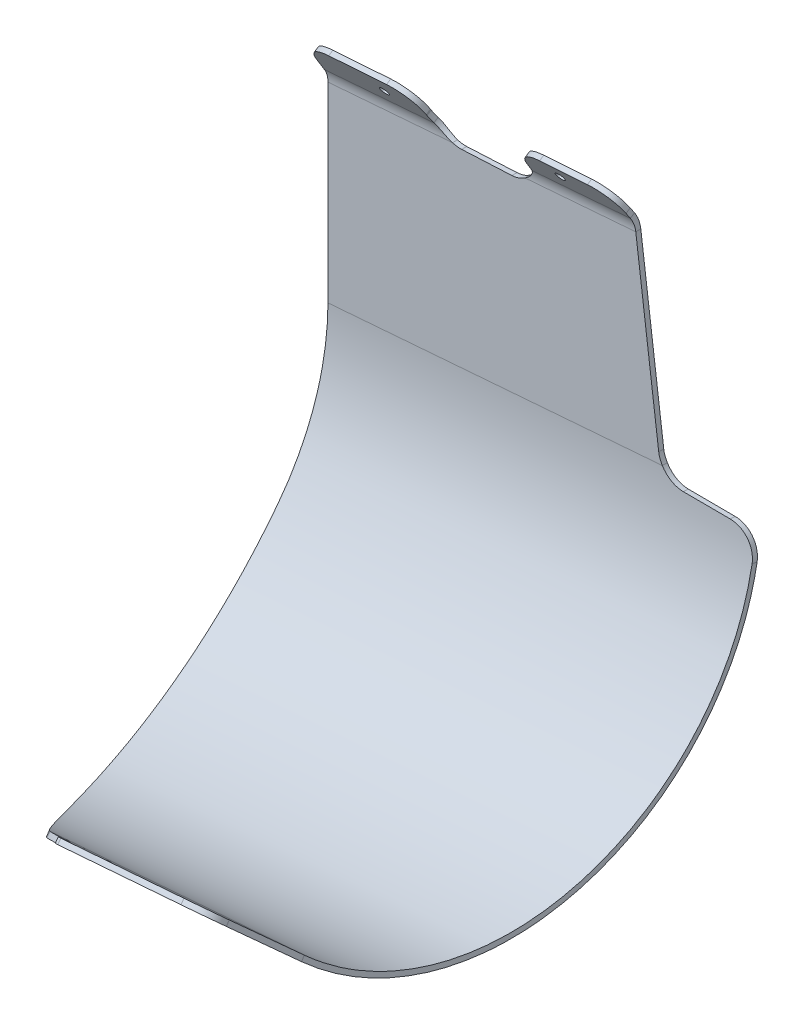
ISO-10303-21;
HEADER;
FILE_DESCRIPTION(('STEP AP214'),'2;1');
FILE_NAME('part.step','',(''),(''),'','','');
FILE_SCHEMA(('AUTOMOTIVE_DESIGN { 1 0 10303 214 1 1 1 1 }'));
ENDSEC;
DATA;
#1=APPLICATION_CONTEXT('core data for automotive mechanical design processes');
#2=APPLICATION_PROTOCOL_DEFINITION('international standard','automotive_design',2000,#1);
#3=PRODUCT_CONTEXT('',#1,'mechanical');
#4=PRODUCT('Part','Part','',(#3));
#5=PRODUCT_RELATED_PRODUCT_CATEGORY('part','',(#4));
#6=PRODUCT_DEFINITION_FORMATION('','',#4);
#7=PRODUCT_DEFINITION_CONTEXT('part definition',#1,'design');
#8=PRODUCT_DEFINITION('design','',#6,#7);
#9=PRODUCT_DEFINITION_SHAPE('','',#8);
#10=(LENGTH_UNIT() NAMED_UNIT(*) SI_UNIT(.MILLI.,.METRE.));
#11=(NAMED_UNIT(*) PLANE_ANGLE_UNIT() SI_UNIT($,.RADIAN.));
#12=(NAMED_UNIT(*) SI_UNIT($,.STERADIAN.) SOLID_ANGLE_UNIT());
#13=UNCERTAINTY_MEASURE_WITH_UNIT(LENGTH_MEASURE(1.E-05),#10,'distance_accuracy_value','');
#14=(GEOMETRIC_REPRESENTATION_CONTEXT(3) GLOBAL_UNCERTAINTY_ASSIGNED_CONTEXT((#13)) GLOBAL_UNIT_ASSIGNED_CONTEXT((#10,
#11,#12)) REPRESENTATION_CONTEXT('',''));
#15=CARTESIAN_POINT('',(0.,0.,0.));
#16=DIRECTION('',(0.,0.,1.));
#17=DIRECTION('',(1.,0.,0.));
#18=AXIS2_PLACEMENT_3D('',#15,#16,#17);
#19=CARTESIAN_POINT('',(-39.8568699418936,-36.0037950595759,386.437750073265));
#20=DIRECTION('',(0.0583019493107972,-0.740854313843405,0.669130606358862));
#21=DIRECTION('',(-0.989726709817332,-0.130544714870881,-0.0583019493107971));
#22=AXIS2_PLACEMENT_3D('',#19,#20,#21);
#23=CYLINDRICAL_SURFACE('',#22,4.50000000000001);
#24=CARTESIAN_POINT('',(-39.8568699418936,-36.0037950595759,386.437750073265));
#25=DIRECTION('',(-0.0583019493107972,0.740854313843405,-0.669130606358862));
#26=DIRECTION('',(0.989726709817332,0.130544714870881,0.0583019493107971));
#27=AXIS2_PLACEMENT_3D('',#24,#25,#26);
#28=CIRCLE('',#27,4.50000000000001);
#29=CARTESIAN_POINT('',(-35.4030997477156,-35.4163438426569,386.700108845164));
#30=VERTEX_POINT('',#29);
#31=EDGE_CURVE('E729',#30,#30,#28,.T.);
#32=ORIENTED_EDGE('',*,*,#31,.T.);
#33=EDGE_LOOP('',(#32));
#34=FACE_BOUND('',#33,.T.);
#35=CARTESIAN_POINT('',(-39.6236621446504,-38.9672123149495,389.1142724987));
#36=DIRECTION('',(-0.0583019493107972,0.740854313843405,-0.669130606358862));
#37=DIRECTION('',(0.989726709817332,0.130544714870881,0.0583019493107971));
#38=AXIS2_PLACEMENT_3D('',#35,#36,#37);
#39=CIRCLE('',#38,4.50000000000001);
#40=CARTESIAN_POINT('',(-35.1698919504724,-38.3797610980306,389.376631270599));
#41=VERTEX_POINT('',#40);
#42=EDGE_CURVE('E742',#41,#41,#39,.T.);
#43=ORIENTED_EDGE('',*,*,#42,.F.);
#44=EDGE_LOOP('',(#43));
#45=FACE_BOUND('',#44,.T.);
#46=ADVANCED_FACE('F30',(#34,#45),#23,.F.);
#47=CARTESIAN_POINT('',(-70.8541183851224,-33.3315633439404,392.097234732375));
#48=DIRECTION('',(0.989726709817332,0.130544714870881,0.0583019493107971));
#49=DIRECTION('',(0.0583019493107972,-0.740854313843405,0.669130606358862));
#50=AXIS2_PLACEMENT_3D('',#47,#48,#49);
#51=PLANE('',#50);
#52=DIRECTION('',(-0.130544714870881,0.658857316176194,0.740854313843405));
#53=VECTOR('',#52,1.);
#54=CARTESIAN_POINT('',(-70.6209105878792,-36.294980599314,394.773757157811));
#55=LINE('',#54,#53);
#56=CARTESIAN_POINT('',(-69.6702423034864,-41.0929898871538,389.378619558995));
#57=VERTEX_POINT('',#56);
#58=CARTESIAN_POINT('',(-70.6209105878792,-36.294980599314,394.773757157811));
#59=VERTEX_POINT('',#58);
#60=EDGE_CURVE('E731',#57,#59,#55,.T.);
#61=ORIENTED_EDGE('',*,*,#60,.T.);
#62=DIRECTION('',(0.0583019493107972,-0.740854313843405,0.669130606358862));
#63=VECTOR('',#62,1.);
#64=CARTESIAN_POINT('',(-70.8541183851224,-33.3315633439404,392.097234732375));
#65=LINE('',#64,#63);
#66=CARTESIAN_POINT('',(-70.8541183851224,-33.3315633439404,392.097234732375));
#67=VERTEX_POINT('',#66);
#68=EDGE_CURVE('E765',#67,#59,#65,.T.);
#69=ORIENTED_EDGE('',*,*,#68,.F.);
#70=DIRECTION('',(-0.130544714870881,0.658857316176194,0.740854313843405));
#71=VECTOR('',#70,1.);
#72=CARTESIAN_POINT('',(-70.8541183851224,-33.3315633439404,392.097234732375));
#73=LINE('',#72,#71);
#74=CARTESIAN_POINT('',(-69.9034501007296,-38.1295726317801,386.70209713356));
#75=VERTEX_POINT('',#74);
#76=EDGE_CURVE('E1894',#75,#67,#73,.T.);
#77=ORIENTED_EDGE('',*,*,#76,.F.);
#78=DIRECTION('',(0.0583019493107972,-0.740854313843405,0.669130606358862));
#79=VECTOR('',#78,1.);
#80=CARTESIAN_POINT('',(-69.9034501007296,-38.1295726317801,386.70209713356));
#81=LINE('',#80,#79);
#82=EDGE_CURVE('E770',#75,#57,#81,.T.);
#83=ORIENTED_EDGE('',*,*,#82,.T.);
#84=EDGE_LOOP('',(#61,#69,#77,#83));
#85=FACE_BOUND('',#84,.T.);
#86=ADVANCED_FACE('F662',(#85),#51,.F.);
#87=CARTESIAN_POINT('',(-65.9054848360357,-32.678839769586,392.388744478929));
#88=DIRECTION('',(0.0583019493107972,-0.740854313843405,0.669130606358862));
#89=DIRECTION('',(-0.989726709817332,-0.130544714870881,-0.0583019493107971));
#90=AXIS2_PLACEMENT_3D('',#87,#88,#89);
#91=CYLINDRICAL_SURFACE('',#90,5.00000000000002);
#92=CARTESIAN_POINT('',(-65.6722770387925,-35.6422570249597,395.065266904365));
#93=DIRECTION('',(-0.0583019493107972,0.740854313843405,-0.669130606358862));
#94=DIRECTION('',(-0.989726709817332,-0.130544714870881,-0.0583019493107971));
#95=AXIS2_PLACEMENT_3D('',#92,#93,#94);
#96=CIRCLE('',#95,5.00000000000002);
#97=CARTESIAN_POINT('',(-66.3250006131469,-32.3479704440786,398.769538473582));
#98=VERTEX_POINT('',#97);
#99=EDGE_CURVE('E768',#59,#98,#96,.T.);
#100=ORIENTED_EDGE('',*,*,#99,.T.);
#101=DIRECTION('',(0.0583019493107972,-0.740854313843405,0.669130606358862));
#102=VECTOR('',#101,1.);
#103=CARTESIAN_POINT('',(-66.5582084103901,-29.384553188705,396.093016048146));
#104=LINE('',#103,#102);
#105=CARTESIAN_POINT('',(-66.5582084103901,-29.384553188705,396.093016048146));
#106=VERTEX_POINT('',#105);
#107=EDGE_CURVE('E760',#106,#98,#104,.T.);
#108=ORIENTED_EDGE('',*,*,#107,.F.);
#109=CARTESIAN_POINT('',(-65.9054848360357,-32.678839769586,392.388744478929));
#110=DIRECTION('',(-0.0583019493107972,0.740854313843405,-0.669130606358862));
#111=DIRECTION('',(-0.989726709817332,-0.130544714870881,-0.0583019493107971));
#112=AXIS2_PLACEMENT_3D('',#109,#110,#111);
#113=CIRCLE('',#112,5.00000000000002);
#114=EDGE_CURVE('E780',#67,#106,#113,.T.);
#115=ORIENTED_EDGE('',*,*,#114,.F.);
#116=ORIENTED_EDGE('',*,*,#68,.T.);
#117=EDGE_LOOP('',(#100,#108,#115,#116));
#118=FACE_BOUND('',#117,.T.);
#119=ADVANCED_FACE('F668',(#118),#91,.T.);
#120=CARTESIAN_POINT('',(37.3630961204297,-15.6773581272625,402.21472072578));
#121=DIRECTION('',(0.130544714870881,-0.658857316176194,-0.740854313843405));
#122=DIRECTION('',(-0.989726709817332,-0.130544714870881,-0.0583019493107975));
#123=AXIS2_PLACEMENT_3D('',#120,#121,#122);
#124=PLANE('',#123);
#125=DIRECTION('',(0.989726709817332,0.130544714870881,0.0583019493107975));
#126=VECTOR('',#125,1.);
#127=CARTESIAN_POINT('',(37.5963039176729,-18.6407753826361,404.891243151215));
#128=LINE('',#127,#126);
#129=CARTESIAN_POINT('',(37.5963039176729,-18.6407753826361,404.891243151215));
#130=VERTEX_POINT('',#129);
#131=EDGE_CURVE('E763',#98,#130,#128,.T.);
#132=ORIENTED_EDGE('',*,*,#131,.T.);
#133=DIRECTION('',(0.0583019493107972,-0.740854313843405,0.669130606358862));
#134=VECTOR('',#133,1.);
#135=CARTESIAN_POINT('',(37.3630961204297,-15.6773581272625,402.21472072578));
#136=LINE('',#135,#134);
#137=CARTESIAN_POINT('',(37.3630961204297,-15.6773581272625,402.21472072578));
#138=VERTEX_POINT('',#137);
#139=EDGE_CURVE('E755',#138,#130,#136,.T.);
#140=ORIENTED_EDGE('',*,*,#139,.F.);
#141=DIRECTION('',(0.989726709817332,0.130544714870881,0.0583019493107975));
#142=VECTOR('',#141,1.);
#143=CARTESIAN_POINT('',(37.3630961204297,-15.6773581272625,402.21472072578));
#144=LINE('',#143,#142);
#145=EDGE_CURVE('E42',#106,#138,#144,.T.);
#146=ORIENTED_EDGE('',*,*,#145,.F.);
#147=ORIENTED_EDGE('',*,*,#107,.T.);
#148=EDGE_LOOP('',(#132,#140,#146,#147));
#149=FACE_BOUND('',#148,.T.);
#150=ADVANCED_FACE('F679',(#149),#124,.F.);
#151=CARTESIAN_POINT('',(39.9739904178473,-28.8545044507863,387.397634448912));
#152=DIRECTION('',(0.0583019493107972,-0.740854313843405,0.669130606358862));
#153=DIRECTION('',(-0.989726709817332,-0.130544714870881,-0.0583019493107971));
#154=AXIS2_PLACEMENT_3D('',#151,#152,#153);
#155=CYLINDRICAL_SURFACE('',#154,20.);
#156=CARTESIAN_POINT('',(40.2071982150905,-31.8179217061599,390.074156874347));
#157=DIRECTION('',(-0.0583019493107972,0.740854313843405,-0.669130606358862));
#158=DIRECTION('',(0.989726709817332,0.130544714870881,0.0583019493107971));
#159=AXIS2_PLACEMENT_3D('',#156,#157,#158);
#160=CIRCLE('',#159,20.);
#161=CARTESIAN_POINT('',(60.0017324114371,-29.2070274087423,391.240195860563));
#162=VERTEX_POINT('',#161);
#163=EDGE_CURVE('E758',#130,#162,#160,.T.);
#164=ORIENTED_EDGE('',*,*,#163,.T.);
#165=DIRECTION('',(0.0583019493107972,-0.740854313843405,0.669130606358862));
#166=VECTOR('',#165,1.);
#167=CARTESIAN_POINT('',(59.7685246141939,-26.2436101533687,388.563673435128));
#168=LINE('',#167,#166);
#169=CARTESIAN_POINT('',(59.7685246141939,-26.2436101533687,388.563673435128));
#170=VERTEX_POINT('',#169);
#171=EDGE_CURVE('E739',#170,#162,#168,.T.);
#172=ORIENTED_EDGE('',*,*,#171,.F.);
#173=CARTESIAN_POINT('',(39.9739904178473,-28.8545044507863,387.397634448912));
#174=DIRECTION('',(-0.0583019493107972,0.740854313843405,-0.669130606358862));
#175=DIRECTION('',(0.989726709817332,0.130544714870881,0.0583019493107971));
#176=AXIS2_PLACEMENT_3D('',#173,#174,#175);
#177=CIRCLE('',#176,20.);
#178=EDGE_CURVE('E11',#138,#170,#177,.T.);
#179=ORIENTED_EDGE('',*,*,#178,.F.);
#180=ORIENTED_EDGE('',*,*,#139,.T.);
#181=EDGE_LOOP('',(#164,#172,#179,#180));
#182=FACE_BOUND('',#181,.T.);
#183=ADVANCED_FACE('F683',(#182),#155,.T.);
#184=CARTESIAN_POINT('',(-74.8520836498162,-38.7822962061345,386.410587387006));
#185=DIRECTION('',(0.0583019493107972,-0.740854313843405,0.669130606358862));
#186=DIRECTION('',(-0.989726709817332,-0.130544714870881,-0.0583019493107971));
#187=AXIS2_PLACEMENT_3D('',#184,#185,#186);
#188=CYLINDRICAL_SURFACE('',#187,4.99999999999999);
#189=CARTESIAN_POINT('',(-74.618875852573,-41.7457134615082,389.087109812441));
#190=DIRECTION('',(0.0583019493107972,-0.740854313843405,0.669130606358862));
#191=DIRECTION('',(0.989726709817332,0.130544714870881,0.0583019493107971));
#192=AXIS2_PLACEMENT_3D('',#189,#190,#191);
#193=CIRCLE('',#192,4.99999999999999);
#194=CARTESIAN_POINT('',(-71.3684757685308,-44.1482376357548,386.143850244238));
#195=VERTEX_POINT('',#194);
#196=EDGE_CURVE('E753',#195,#57,#193,.T.);
#197=ORIENTED_EDGE('',*,*,#196,.T.);
#198=ORIENTED_EDGE('',*,*,#82,.F.);
#199=CARTESIAN_POINT('',(-74.8520836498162,-38.7822962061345,386.410587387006));
#200=DIRECTION('',(0.0583019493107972,-0.740854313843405,0.669130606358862));
#201=DIRECTION('',(0.989726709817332,0.130544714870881,0.0583019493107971));
#202=AXIS2_PLACEMENT_3D('',#199,#200,#201);
#203=CIRCLE('',#202,4.99999999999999);
#204=CARTESIAN_POINT('',(-71.601683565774,-41.1848203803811,383.467327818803));
#205=VERTEX_POINT('',#204);
#206=EDGE_CURVE('E723',#205,#75,#203,.T.);
#207=ORIENTED_EDGE('',*,*,#206,.F.);
#208=DIRECTION('',(0.0583019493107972,-0.740854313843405,0.669130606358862));
#209=VECTOR('',#208,1.);
#210=CARTESIAN_POINT('',(-71.601683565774,-41.1848203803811,383.467327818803));
#211=LINE('',#210,#209);
#212=EDGE_CURVE('E750',#205,#195,#211,.T.);
#213=ORIENTED_EDGE('',*,*,#212,.T.);
#214=EDGE_LOOP('',(#197,#198,#207,#213));
#215=FACE_BOUND('',#214,.T.);
#216=ADVANCED_FACE('F687',(#215),#188,.F.);
#217=CARTESIAN_POINT('',(226.080790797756,-261.215992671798,113.913805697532));
#218=DIRECTION('',(0.0583019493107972,-0.740854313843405,0.669130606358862));
#219=DIRECTION('',(-0.989726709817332,-0.130544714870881,-0.0583019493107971));
#220=AXIS2_PLACEMENT_3D('',#217,#218,#219);
#221=CYLINDRICAL_SURFACE('',#220,457.916666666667);
#222=CARTESIAN_POINT('',(-133.264423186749,-90.2417569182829,340.502643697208));
#223=CARTESIAN_POINT('',(-133.497630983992,-87.2783396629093,337.826121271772));
#224=B_SPLINE_CURVE_WITH_KNOTS('',1,(#222,#223),.UNSPECIFIED.,.F.,.F.,(2,2),(0.,1.),.UNSPECIFIED.);
#225=CARTESIAN_POINT('',(-133.264423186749,-90.2417569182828,340.502643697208));
#226=VERTEX_POINT('',#225);
#227=CARTESIAN_POINT('',(-133.497630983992,-87.2783396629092,337.826121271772));
#228=VERTEX_POINT('',#227);
#229=EDGE_CURVE('E594',#226,#228,#224,.T.);
#230=ORIENTED_EDGE('',*,*,#229,.F.);
#231=CARTESIAN_POINT('',(226.313998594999,-264.179409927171,116.590328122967));
#232=DIRECTION('',(-0.0583019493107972,0.740854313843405,-0.669130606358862));
#233=DIRECTION('',(0.989726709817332,0.130544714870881,0.0583019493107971));
#234=AXIS2_PLACEMENT_3D('',#231,#232,#233);
#235=CIRCLE('',#234,457.916666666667);
#236=EDGE_CURVE('E726',#226,#195,#235,.T.);
#237=ORIENTED_EDGE('',*,*,#236,.T.);
#238=ORIENTED_EDGE('',*,*,#212,.F.);
#239=CARTESIAN_POINT('',(226.080790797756,-261.215992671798,113.913805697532));
#240=DIRECTION('',(-0.0583019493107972,0.740854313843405,-0.669130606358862));
#241=DIRECTION('',(0.989726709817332,0.130544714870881,0.0583019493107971));
#242=AXIS2_PLACEMENT_3D('',#239,#240,#241);
#243=CIRCLE('',#242,457.916666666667);
#244=EDGE_CURVE('E714',#228,#205,#243,.T.);
#245=ORIENTED_EDGE('',*,*,#244,.F.);
#246=EDGE_LOOP('',(#230,#237,#238,#245));
#247=FACE_BOUND('',#246,.T.);
#248=ADVANCED_FACE('F690',(#247),#221,.T.);
#249=CARTESIAN_POINT('',(226.313998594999,-264.179409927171,116.590328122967));
#250=DIRECTION('',(-0.0583019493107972,0.740854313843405,-0.669130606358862));
#251=DIRECTION('',(0.989726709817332,0.130544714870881,0.0583019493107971));
#252=AXIS2_PLACEMENT_3D('',#249,#250,#251);
#253=PLANE('',#252);
#254=DIRECTION('',(-0.996917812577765,-0.0784530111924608,0.));
#255=VECTOR('',#254,1.);
#256=CARTESIAN_POINT('',(210.496965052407,-63.1892600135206,340.502643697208));
#257=LINE('',#256,#255);
#258=CARTESIAN_POINT('',(68.9421126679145,-74.3289991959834,340.502643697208));
#259=VERTEX_POINT('',#258);
#260=EDGE_CURVE('E94',#259,#226,#257,.T.);
#261=ORIENTED_EDGE('',*,*,#260,.F.);
#262=DIRECTION('',(0.130544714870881,-0.658857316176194,-0.740854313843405));
#263=VECTOR('',#262,1.);
#264=CARTESIAN_POINT('',(125.274089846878,-358.635685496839,20.8130389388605));
#265=LINE('',#264,#263);
#266=EDGE_CURVE('E719',#162,#259,#265,.T.);
#267=ORIENTED_EDGE('',*,*,#266,.F.);
#268=ORIENTED_EDGE('',*,*,#163,.F.);
#269=ORIENTED_EDGE('',*,*,#131,.F.);
#270=ORIENTED_EDGE('',*,*,#99,.F.);
#271=ORIENTED_EDGE('',*,*,#60,.F.);
#272=ORIENTED_EDGE('',*,*,#196,.F.);
#273=ORIENTED_EDGE('',*,*,#236,.F.);
#274=EDGE_LOOP('',(#261,#267,#268,#269,#270,#271,#272,#273));
#275=FACE_BOUND('',#274,.T.);
#276=ORIENTED_EDGE('',*,*,#42,.T.);
#277=EDGE_LOOP('',(#276));
#278=FACE_BOUND('',#277,.T.);
#279=ADVANCED_FACE('F695',(#275,#278),#253,.F.);
#280=CARTESIAN_POINT('',(125.040882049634,-355.672268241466,18.136516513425));
#281=DIRECTION('',(-0.989726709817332,-0.130544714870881,-0.0583019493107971));
#282=DIRECTION('',(-0.130544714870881,0.658857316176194,0.740854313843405));
#283=AXIS2_PLACEMENT_3D('',#280,#281,#282);
#284=PLANE('',#283);
#285=CARTESIAN_POINT('',(68.708904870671,-71.3655819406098,337.826121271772));
#286=CARTESIAN_POINT('',(68.9421126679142,-74.3289991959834,340.502643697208));
#287=B_SPLINE_CURVE_WITH_KNOTS('',1,(#285,#286),.UNSPECIFIED.,.F.,.F.,(2,2),(0.,1.),.UNSPECIFIED.);
#288=CARTESIAN_POINT('',(68.7089048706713,-71.3655819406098,337.826121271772));
#289=VERTEX_POINT('',#288);
#290=EDGE_CURVE('E728',#289,#259,#287,.T.);
#291=ORIENTED_EDGE('',*,*,#290,.F.);
#292=DIRECTION('',(0.130544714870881,-0.658857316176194,-0.740854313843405));
#293=VECTOR('',#292,1.);
#294=CARTESIAN_POINT('',(125.040882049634,-355.672268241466,18.136516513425));
#295=LINE('',#294,#293);
#296=EDGE_CURVE('E715',#170,#289,#295,.T.);
#297=ORIENTED_EDGE('',*,*,#296,.F.);
#298=ORIENTED_EDGE('',*,*,#171,.T.);
#299=ORIENTED_EDGE('',*,*,#266,.T.);
#300=EDGE_LOOP('',(#291,#297,#298,#299));
#301=FACE_BOUND('',#300,.T.);
#302=ADVANCED_FACE('F698',(#301),#284,.F.);
#303=CARTESIAN_POINT('',(226.080790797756,-261.215992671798,113.913805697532));
#304=DIRECTION('',(-0.0583019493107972,0.740854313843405,-0.669130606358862));
#305=DIRECTION('',(0.989726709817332,0.130544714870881,0.0583019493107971));
#306=AXIS2_PLACEMENT_3D('',#303,#304,#305);
#307=PLANE('',#306);
#308=ORIENTED_EDGE('',*,*,#31,.F.);
#309=EDGE_LOOP('',(#308));
#310=FACE_BOUND('',#309,.T.);
#311=ORIENTED_EDGE('',*,*,#296,.T.);
#312=DIRECTION('',(-0.996917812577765,-0.0784530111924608,0.));
#313=VECTOR('',#312,1.);
#314=CARTESIAN_POINT('',(210.263757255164,-60.225842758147,337.826121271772));
#315=LINE('',#314,#313);
#316=EDGE_CURVE('E99',#289,#228,#315,.T.);
#317=ORIENTED_EDGE('',*,*,#316,.T.);
#318=ORIENTED_EDGE('',*,*,#244,.T.);
#319=ORIENTED_EDGE('',*,*,#206,.T.);
#320=ORIENTED_EDGE('',*,*,#76,.T.);
#321=ORIENTED_EDGE('',*,*,#114,.T.);
#322=ORIENTED_EDGE('',*,*,#145,.T.);
#323=ORIENTED_EDGE('',*,*,#178,.T.);
#324=EDGE_LOOP('',(#311,#317,#318,#319,#320,#321,#322,#323));
#325=FACE_BOUND('',#324,.T.);
#326=ADVANCED_FACE('F32',(#310,#325),#307,.T.);
#327=CARTESIAN_POINT('',(-191.142690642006,231.31477260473,14.3778625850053));
#328=DIRECTION('',(-0.0415737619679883,0.528285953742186,-0.848048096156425));
#329=DIRECTION('',(-0.999064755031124,-0.0118843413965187,0.0415737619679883));
#330=AXIS2_PLACEMENT_3D('',#327,#328,#329);
#331=CYLINDRICAL_SURFACE('',#330,3.50000000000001);
#332=CARTESIAN_POINT('',(-191.142690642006,231.31477260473,14.3778625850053));
#333=DIRECTION('',(0.0415737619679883,-0.528285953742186,0.848048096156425));
#334=DIRECTION('',(0.999064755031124,0.0118843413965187,-0.0415737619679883));
#335=AXIS2_PLACEMENT_3D('',#332,#333,#334);
#336=CIRCLE('',#335,3.50000000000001);
#337=CARTESIAN_POINT('',(-187.645963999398,231.356367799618,14.2323544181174));
#338=VERTEX_POINT('',#337);
#339=EDGE_CURVE('E1274',#338,#338,#336,.T.);
#340=ORIENTED_EDGE('',*,*,#339,.T.);
#341=EDGE_LOOP('',(#340));
#342=FACE_BOUND('',#341,.T.);
#343=CARTESIAN_POINT('',(-191.308985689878,233.427916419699,10.9856702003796));
#344=DIRECTION('',(0.0415737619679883,-0.528285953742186,0.848048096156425));
#345=DIRECTION('',(0.999064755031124,0.0118843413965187,-0.0415737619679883));
#346=AXIS2_PLACEMENT_3D('',#343,#344,#345);
#347=CIRCLE('',#346,3.50000000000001);
#348=CARTESIAN_POINT('',(-187.812259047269,233.469511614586,10.8401620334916));
#349=VERTEX_POINT('',#348);
#350=EDGE_CURVE('E1250',#349,#349,#347,.T.);
#351=ORIENTED_EDGE('',*,*,#350,.F.);
#352=EDGE_LOOP('',(#351));
#353=FACE_BOUND('',#352,.T.);
#354=ADVANCED_FACE('F787',(#342,#353),#331,.F.);
#355=CARTESIAN_POINT('',(-180.968466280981,227.620776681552,11.5779424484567));
#356=DIRECTION('',(-0.0415737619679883,0.528285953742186,-0.848048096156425));
#357=DIRECTION('',(-0.999064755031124,-0.0118843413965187,0.0415737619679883));
#358=AXIS2_PLACEMENT_3D('',#355,#356,#357);
#359=CYLINDRICAL_SURFACE('',#358,20.);
#360=CARTESIAN_POINT('',(-181.134761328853,229.733920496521,8.18575006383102));
#361=DIRECTION('',(0.0415737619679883,-0.528285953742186,0.848048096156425));
#362=DIRECTION('',(0.999064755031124,0.0118843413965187,-0.0415737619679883));
#363=AXIS2_PLACEMENT_3D('',#360,#361,#362);
#364=CIRCLE('',#363,20.);
#365=CARTESIAN_POINT('',(-161.166526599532,230.819234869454,7.8829390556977));
#366=VERTEX_POINT('',#365);
#367=CARTESIAN_POINT('',(-181.895189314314,246.680532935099,18.7798085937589));
#368=VERTEX_POINT('',#367);
#369=EDGE_CURVE('E1272',#366,#368,#364,.T.);
#370=ORIENTED_EDGE('',*,*,#369,.T.);
#371=DIRECTION('',(-0.0415737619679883,0.528285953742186,-0.848048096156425));
#372=VECTOR('',#371,1.);
#373=CARTESIAN_POINT('',(-181.728894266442,244.56738912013,22.1720009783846));
#374=LINE('',#373,#372);
#375=CARTESIAN_POINT('',(-181.728894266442,244.56738912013,22.1720009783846));
#376=VERTEX_POINT('',#375);
#377=EDGE_CURVE('E1264',#376,#368,#374,.T.);
#378=ORIENTED_EDGE('',*,*,#377,.F.);
#379=CARTESIAN_POINT('',(-180.968466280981,227.620776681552,11.5779424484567));
#380=DIRECTION('',(0.0415737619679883,-0.528285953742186,0.848048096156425));
#381=DIRECTION('',(0.999064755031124,0.0118843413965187,-0.0415737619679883));
#382=AXIS2_PLACEMENT_3D('',#379,#380,#381);
#383=CIRCLE('',#382,20.);
#384=CARTESIAN_POINT('',(-161.00023155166,228.706091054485,11.2751314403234));
#385=VERTEX_POINT('',#384);
#386=EDGE_CURVE('E1241',#385,#376,#383,.T.);
#387=ORIENTED_EDGE('',*,*,#386,.F.);
#388=DIRECTION('',(-0.0415737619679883,0.528285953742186,-0.848048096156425));
#389=VECTOR('',#388,1.);
#390=CARTESIAN_POINT('',(-161.00023155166,228.706091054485,11.2751314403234));
#391=LINE('',#390,#389);
#392=EDGE_CURVE('E1269',#385,#366,#391,.T.);
#393=ORIENTED_EDGE('',*,*,#392,.T.);
#394=EDGE_LOOP('',(#370,#378,#387,#393));
#395=FACE_BOUND('',#394,.T.);
#396=ADVANCED_FACE('F792',(#395),#359,.T.);
#397=CARTESIAN_POINT('',(-181.728894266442,244.56738912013,22.1720009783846));
#398=DIRECTION('',(0.0380213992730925,-0.847330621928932,-0.529702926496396));
#399=DIRECTION('',(0.998411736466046,0.0542657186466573,-0.0151405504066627));
#400=AXIS2_PLACEMENT_3D('',#397,#398,#399);
#401=PLANE('',#400);
#402=DIRECTION('',(-0.998411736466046,-0.0542657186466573,0.0151405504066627));
#403=VECTOR('',#402,1.);
#404=CARTESIAN_POINT('',(-181.895189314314,246.680532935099,18.7798085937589));
#405=LINE('',#404,#403);
#406=CARTESIAN_POINT('',(-227.116973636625,244.222636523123,19.465580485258));
#407=VERTEX_POINT('',#406);
#408=EDGE_CURVE('E1267',#368,#407,#405,.T.);
#409=ORIENTED_EDGE('',*,*,#408,.T.);
#410=DIRECTION('',(-0.0415737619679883,0.528285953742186,-0.848048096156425));
#411=VECTOR('',#410,1.);
#412=CARTESIAN_POINT('',(-226.950678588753,242.109492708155,22.8577728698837));
#413=LINE('',#412,#411);
#414=CARTESIAN_POINT('',(-226.950678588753,242.109492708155,22.8577728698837));
#415=VERTEX_POINT('',#414);
#416=EDGE_CURVE('E1259',#415,#407,#413,.T.);
#417=ORIENTED_EDGE('',*,*,#416,.F.);
#418=DIRECTION('',(-0.998411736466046,-0.0542657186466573,0.0151405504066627));
#419=VECTOR('',#418,1.);
#420=CARTESIAN_POINT('',(-181.728894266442,244.56738912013,22.1720009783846));
#421=LINE('',#420,#419);
#422=EDGE_CURVE('E1239',#376,#415,#421,.T.);
#423=ORIENTED_EDGE('',*,*,#422,.F.);
#424=ORIENTED_EDGE('',*,*,#377,.T.);
#425=EDGE_LOOP('',(#409,#417,#423,#424));
#426=FACE_BOUND('',#425,.T.);
#427=ADVANCED_FACE('F799',(#426),#401,.F.);
#428=CARTESIAN_POINT('',(-226.190250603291,225.162880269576,12.2637143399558));
#429=DIRECTION('',(-0.0415737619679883,0.528285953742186,-0.848048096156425));
#430=DIRECTION('',(-0.999064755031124,-0.0118843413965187,0.0415737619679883));
#431=AXIS2_PLACEMENT_3D('',#428,#429,#430);
#432=CYLINDRICAL_SURFACE('',#431,20.);
#433=CARTESIAN_POINT('',(-226.356545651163,227.276024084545,8.87152195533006));
#434=DIRECTION('',(0.0415737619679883,-0.528285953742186,0.848048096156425));
#435=DIRECTION('',(0.999064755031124,0.0118843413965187,-0.0415737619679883));
#436=AXIS2_PLACEMENT_3D('',#433,#434,#435);
#437=CIRCLE('',#436,20.);
#438=CARTESIAN_POINT('',(-246.337840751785,227.038337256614,9.70299719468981));
#439=VERTEX_POINT('',#438);
#440=EDGE_CURVE('E1262',#407,#439,#437,.T.);
#441=ORIENTED_EDGE('',*,*,#440,.T.);
#442=DIRECTION('',(-0.0415737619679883,0.528285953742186,-0.848048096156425));
#443=VECTOR('',#442,1.);
#444=CARTESIAN_POINT('',(-246.171545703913,224.925193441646,13.0951895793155));
#445=LINE('',#444,#443);
#446=CARTESIAN_POINT('',(-246.171545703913,224.925193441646,13.0951895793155));
#447=VERTEX_POINT('',#446);
#448=EDGE_CURVE('E1246',#447,#439,#445,.T.);
#449=ORIENTED_EDGE('',*,*,#448,.F.);
#450=CARTESIAN_POINT('',(-226.190250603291,225.162880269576,12.2637143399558));
#451=DIRECTION('',(0.0415737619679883,-0.528285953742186,0.848048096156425));
#452=DIRECTION('',(0.999064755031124,0.0118843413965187,-0.0415737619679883));
#453=AXIS2_PLACEMENT_3D('',#450,#451,#452);
#454=CIRCLE('',#453,20.);
#455=EDGE_CURVE('E108',#415,#447,#454,.T.);
#456=ORIENTED_EDGE('',*,*,#455,.F.);
#457=ORIENTED_EDGE('',*,*,#416,.T.);
#458=EDGE_LOOP('',(#441,#449,#456,#457));
#459=FACE_BOUND('',#458,.T.);
#460=ADVANCED_FACE('F810',(#459),#432,.T.);
#461=CARTESIAN_POINT('',(-161.00023155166,228.706091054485,11.2751314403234));
#462=DIRECTION('',(-0.998411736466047,-0.0542657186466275,0.0151405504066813));
#463=DIRECTION('',(0.0380213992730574,-0.847330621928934,-0.529702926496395));
#464=AXIS2_PLACEMENT_3D('',#461,#462,#463);
#465=PLANE('',#464);
#466=DIRECTION('',(-0.0380213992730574,0.847330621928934,0.529702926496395));
#467=VECTOR('',#466,1.);
#468=CARTESIAN_POINT('',(-161.166526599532,230.819234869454,7.8829390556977));
#469=LINE('',#468,#467);
#470=CARTESIAN_POINT('',(-161.128505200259,229.971904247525,7.35323612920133));
#471=VERTEX_POINT('',#470);
#472=EDGE_CURVE('E1257',#471,#366,#469,.T.);
#473=ORIENTED_EDGE('',*,*,#472,.T.);
#474=ORIENTED_EDGE('',*,*,#392,.F.);
#475=DIRECTION('',(-0.0380213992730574,0.847330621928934,0.529702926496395));
#476=VECTOR('',#475,1.);
#477=CARTESIAN_POINT('',(-161.00023155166,228.706091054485,11.2751314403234));
#478=LINE('',#477,#476);
#479=CARTESIAN_POINT('',(-160.962210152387,227.858760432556,10.745428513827));
#480=VERTEX_POINT('',#479);
#481=EDGE_CURVE('E1243',#480,#385,#478,.T.);
#482=ORIENTED_EDGE('',*,*,#481,.F.);
#483=DIRECTION('',(-0.0415737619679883,0.528285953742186,-0.848048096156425));
#484=VECTOR('',#483,1.);
#485=CARTESIAN_POINT('',(-160.962210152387,227.858760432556,10.745428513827));
#486=LINE('',#485,#484);
#487=EDGE_CURVE('E1254',#480,#471,#486,.T.);
#488=ORIENTED_EDGE('',*,*,#487,.T.);
#489=EDGE_LOOP('',(#473,#474,#482,#488));
#490=FACE_BOUND('',#489,.T.);
#491=ADVANCED_FACE('F814',(#490),#465,.F.);
#492=CARTESIAN_POINT('',(-140.993975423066,228.944074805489,10.4426175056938));
#493=DIRECTION('',(-0.0415737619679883,0.528285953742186,-0.848048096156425));
#494=DIRECTION('',(-0.999064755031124,-0.0118843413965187,0.0415737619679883));
#495=AXIS2_PLACEMENT_3D('',#492,#493,#494);
#496=CYLINDRICAL_SURFACE('',#495,20.);
#497=CARTESIAN_POINT('',(-159.496755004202,223.906587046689,3.49489378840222));
#498=CARTESIAN_POINT('',(-159.33045995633,221.79344323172,6.88708617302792));
#499=B_SPLINE_CURVE_WITH_KNOTS('',1,(#497,#498),.UNSPECIFIED.,.F.,.F.,(2,2),(0.,1.),.UNSPECIFIED.);
#500=CARTESIAN_POINT('',(-159.496755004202,223.906587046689,3.49489378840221));
#501=VERTEX_POINT('',#500);
#502=CARTESIAN_POINT('',(-159.33045995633,221.79344323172,6.88708617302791));
#503=VERTEX_POINT('',#502);
#504=EDGE_CURVE('E1154',#501,#503,#499,.T.);
#505=ORIENTED_EDGE('',*,*,#504,.F.);
#506=CARTESIAN_POINT('',(-141.160270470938,231.057218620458,7.05042512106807));
#507=DIRECTION('',(-0.0415737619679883,0.528285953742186,-0.848048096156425));
#508=DIRECTION('',(-0.999064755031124,-0.0118843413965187,0.0415737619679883));
#509=AXIS2_PLACEMENT_3D('',#506,#507,#508);
#510=CIRCLE('',#509,20.);
#511=EDGE_CURVE('E1253',#501,#471,#510,.T.);
#512=ORIENTED_EDGE('',*,*,#511,.T.);
#513=ORIENTED_EDGE('',*,*,#487,.F.);
#514=CARTESIAN_POINT('',(-140.993975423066,228.944074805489,10.4426175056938));
#515=DIRECTION('',(-0.0415737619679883,0.528285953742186,-0.848048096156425));
#516=DIRECTION('',(-0.999064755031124,-0.0118843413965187,0.0415737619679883));
#517=AXIS2_PLACEMENT_3D('',#514,#515,#516);
#518=CIRCLE('',#517,20.);
#519=EDGE_CURVE('E1245',#503,#480,#518,.T.);
#520=ORIENTED_EDGE('',*,*,#519,.F.);
#521=EDGE_LOOP('',(#505,#512,#513,#520));
#522=FACE_BOUND('',#521,.T.);
#523=ADVANCED_FACE('F818',(#522),#496,.F.);
#524=CARTESIAN_POINT('',(207.538018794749,-25.5893491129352,-169.920052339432));
#525=DIRECTION('',(0.0415737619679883,-0.528285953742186,0.848048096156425));
#526=DIRECTION('',(0.999064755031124,0.0118843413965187,-0.0415737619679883));
#527=AXIS2_PLACEMENT_3D('',#524,#525,#526);
#528=PLANE('',#527);
#529=DIRECTION('',(0.996917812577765,0.0784530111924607,0.));
#530=VECTOR('',#529,1.);
#531=CARTESIAN_POINT('',(185.765588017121,251.077202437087,3.49489378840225));
#532=LINE('',#531,#530);
#533=CARTESIAN_POINT('',(-246.47749848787,217.061588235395,3.49489378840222));
#534=VERTEX_POINT('',#533);
#535=EDGE_CURVE('E147',#534,#501,#532,.T.);
#536=ORIENTED_EDGE('',*,*,#535,.F.);
#537=DIRECTION('',(-0.0118843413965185,-0.848983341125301,-0.528285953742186));
#538=VECTOR('',#537,1.);
#539=CARTESIAN_POINT('',(-246.337840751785,227.038337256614,9.70299719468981));
#540=LINE('',#539,#538);
#541=EDGE_CURVE('E1249',#439,#534,#540,.T.);
#542=ORIENTED_EDGE('',*,*,#541,.F.);
#543=ORIENTED_EDGE('',*,*,#440,.F.);
#544=ORIENTED_EDGE('',*,*,#408,.F.);
#545=ORIENTED_EDGE('',*,*,#369,.F.);
#546=ORIENTED_EDGE('',*,*,#472,.F.);
#547=ORIENTED_EDGE('',*,*,#511,.F.);
#548=EDGE_LOOP('',(#536,#542,#543,#544,#545,#546,#547));
#549=FACE_BOUND('',#548,.T.);
#550=ORIENTED_EDGE('',*,*,#350,.T.);
#551=EDGE_LOOP('',(#550));
#552=FACE_BOUND('',#551,.T.);
#553=ADVANCED_FACE('F823',(#549,#552),#528,.F.);
#554=CARTESIAN_POINT('',(-246.171545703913,224.925193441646,13.0951895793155));
#555=DIRECTION('',(0.999064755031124,0.0118843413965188,-0.0415737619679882));
#556=DIRECTION('',(0.0118843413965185,0.848983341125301,0.528285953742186));
#557=AXIS2_PLACEMENT_3D('',#554,#555,#556);
#558=PLANE('',#557);
#559=CARTESIAN_POINT('',(-246.311203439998,214.948444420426,6.88708617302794));
#560=CARTESIAN_POINT('',(-246.47749848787,217.061588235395,3.49489378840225));
#561=B_SPLINE_CURVE_WITH_KNOTS('',1,(#559,#560),.UNSPECIFIED.,.F.,.F.,(2,2),(0.,1.),.UNSPECIFIED.);
#562=CARTESIAN_POINT('',(-246.311203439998,214.948444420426,6.88708617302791));
#563=VERTEX_POINT('',#562);
#564=EDGE_CURVE('E1280',#563,#534,#561,.T.);
#565=ORIENTED_EDGE('',*,*,#564,.F.);
#566=DIRECTION('',(-0.0118843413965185,-0.848983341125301,-0.528285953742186));
#567=VECTOR('',#566,1.);
#568=CARTESIAN_POINT('',(-246.171545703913,224.925193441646,13.0951895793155));
#569=LINE('',#568,#567);
#570=EDGE_CURVE('E1284',#447,#563,#569,.T.);
#571=ORIENTED_EDGE('',*,*,#570,.F.);
#572=ORIENTED_EDGE('',*,*,#448,.T.);
#573=ORIENTED_EDGE('',*,*,#541,.T.);
#574=EDGE_LOOP('',(#565,#571,#572,#573));
#575=FACE_BOUND('',#574,.T.);
#576=ADVANCED_FACE('F1295',(#575),#558,.F.);
#577=CARTESIAN_POINT('',(207.704313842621,-27.702492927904,-166.527859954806));
#578=DIRECTION('',(0.0415737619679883,-0.528285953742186,0.848048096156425));
#579=DIRECTION('',(0.999064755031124,0.0118843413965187,-0.0415737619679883));
#580=AXIS2_PLACEMENT_3D('',#577,#578,#579);
#581=PLANE('',#580);
#582=ORIENTED_EDGE('',*,*,#339,.F.);
#583=EDGE_LOOP('',(#582));
#584=FACE_BOUND('',#583,.T.);
#585=ORIENTED_EDGE('',*,*,#570,.T.);
#586=DIRECTION('',(0.996917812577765,0.0784530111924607,0.));
#587=VECTOR('',#586,1.);
#588=CARTESIAN_POINT('',(185.931883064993,248.964058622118,6.88708617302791));
#589=LINE('',#588,#587);
#590=EDGE_CURVE('E152',#563,#503,#589,.T.);
#591=ORIENTED_EDGE('',*,*,#590,.T.);
#592=ORIENTED_EDGE('',*,*,#519,.T.);
#593=ORIENTED_EDGE('',*,*,#481,.T.);
#594=ORIENTED_EDGE('',*,*,#386,.T.);
#595=ORIENTED_EDGE('',*,*,#422,.T.);
#596=ORIENTED_EDGE('',*,*,#455,.T.);
#597=EDGE_LOOP('',(#585,#591,#592,#593,#594,#595,#596));
#598=FACE_BOUND('',#597,.T.);
#599=ADVANCED_FACE('F1304',(#584,#598),#581,.T.);
#600=CARTESIAN_POINT('',(-51.5741968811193,242.298194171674,14.3778625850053));
#601=DIRECTION('',(-0.0415737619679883,0.528285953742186,-0.848048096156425));
#602=DIRECTION('',(-0.999064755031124,-0.0118843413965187,0.0415737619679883));
#603=AXIS2_PLACEMENT_3D('',#600,#601,#602);
#604=CYLINDRICAL_SURFACE('',#603,3.49999999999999);
#605=CARTESIAN_POINT('',(-51.5741968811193,242.298194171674,14.3778625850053));
#606=DIRECTION('',(0.0415737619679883,-0.528285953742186,0.848048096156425));
#607=DIRECTION('',(0.999064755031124,0.0118843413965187,-0.0415737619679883));
#608=AXIS2_PLACEMENT_3D('',#605,#606,#607);
#609=CIRCLE('',#608,3.49999999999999);
#610=CARTESIAN_POINT('',(-48.0774702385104,242.339789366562,14.2323544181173));
#611=VERTEX_POINT('',#610);
#612=EDGE_CURVE('E1190',#611,#611,#609,.T.);
#613=ORIENTED_EDGE('',*,*,#612,.T.);
#614=EDGE_LOOP('',(#613));
#615=FACE_BOUND('',#614,.T.);
#616=CARTESIAN_POINT('',(-51.7404919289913,244.411337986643,10.9856702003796));
#617=DIRECTION('',(0.0415737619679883,-0.528285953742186,0.848048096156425));
#618=DIRECTION('',(0.999064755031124,0.0118843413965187,-0.0415737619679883));
#619=AXIS2_PLACEMENT_3D('',#616,#617,#618);
#620=CIRCLE('',#619,3.49999999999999);
#621=CARTESIAN_POINT('',(-48.2437652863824,244.452933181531,10.8401620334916));
#622=VERTEX_POINT('',#621);
#623=EDGE_CURVE('E1166',#622,#622,#620,.T.);
#624=ORIENTED_EDGE('',*,*,#623,.F.);
#625=EDGE_LOOP('',(#624));
#626=FACE_BOUND('',#625,.T.);
#627=ADVANCED_FACE('F1142',(#615,#626),#604,.F.);
#628=CARTESIAN_POINT('',(-24.5040531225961,253.112880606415,19.7877435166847));
#629=DIRECTION('',(0.0380213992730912,-0.847330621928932,-0.529702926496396));
#630=DIRECTION('',(0.998411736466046,0.0542657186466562,-0.0151405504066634));
#631=AXIS2_PLACEMENT_3D('',#628,#629,#630);
#632=PLANE('',#631);
#633=DIRECTION('',(-0.998411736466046,-0.0542657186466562,0.0151405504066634));
#634=VECTOR('',#633,1.);
#635=CARTESIAN_POINT('',(-24.6703481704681,255.226024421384,16.395551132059));
#636=LINE('',#635,#634);
#637=CARTESIAN_POINT('',(-24.6703481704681,255.226024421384,16.395551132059));
#638=VERTEX_POINT('',#637);
#639=CARTESIAN_POINT('',(-62.0857809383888,253.192419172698,16.9629425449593));
#640=VERTEX_POINT('',#639);
#641=EDGE_CURVE('E1188',#638,#640,#636,.T.);
#642=ORIENTED_EDGE('',*,*,#641,.T.);
#643=DIRECTION('',(-0.0415737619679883,0.528285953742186,-0.848048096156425));
#644=VECTOR('',#643,1.);
#645=CARTESIAN_POINT('',(-61.9194858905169,251.079275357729,20.355134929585));
#646=LINE('',#645,#644);
#647=CARTESIAN_POINT('',(-61.9194858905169,251.079275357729,20.355134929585));
#648=VERTEX_POINT('',#647);
#649=EDGE_CURVE('E1180',#648,#640,#646,.T.);
#650=ORIENTED_EDGE('',*,*,#649,.F.);
#651=DIRECTION('',(-0.998411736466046,-0.0542657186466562,0.0151405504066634));
#652=VECTOR('',#651,1.);
#653=CARTESIAN_POINT('',(-24.5040531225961,253.112880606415,19.7877435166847));
#654=LINE('',#653,#652);
#655=CARTESIAN_POINT('',(-24.5040531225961,253.112880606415,19.7877435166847));
#656=VERTEX_POINT('',#655);
#657=EDGE_CURVE('E1157',#656,#648,#654,.T.);
#658=ORIENTED_EDGE('',*,*,#657,.F.);
#659=DIRECTION('',(-0.0415737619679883,0.528285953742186,-0.848048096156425));
#660=VECTOR('',#659,1.);
#661=CARTESIAN_POINT('',(-24.5040531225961,253.112880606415,19.7877435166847));
#662=LINE('',#661,#660);
#663=EDGE_CURVE('E1185',#656,#638,#662,.T.);
#664=ORIENTED_EDGE('',*,*,#663,.T.);
#665=EDGE_LOOP('',(#642,#650,#658,#664));
#666=FACE_BOUND('',#665,.T.);
#667=ADVANCED_FACE('F1547',(#666),#632,.F.);
#668=CARTESIAN_POINT('',(-61.159057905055,234.132662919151,9.76107639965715));
#669=DIRECTION('',(-0.0415737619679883,0.528285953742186,-0.848048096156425));
#670=DIRECTION('',(-0.999064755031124,-0.0118843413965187,0.0415737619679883));
#671=AXIS2_PLACEMENT_3D('',#668,#669,#670);
#672=CYLINDRICAL_SURFACE('',#671,20.);
#673=CARTESIAN_POINT('',(-61.325352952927,236.245806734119,6.36888401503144));
#674=DIRECTION('',(0.0415737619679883,-0.528285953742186,0.848048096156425));
#675=DIRECTION('',(-0.999064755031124,-0.0118843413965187,0.0415737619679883));
#676=AXIS2_PLACEMENT_3D('',#673,#674,#675);
#677=CIRCLE('',#676,20.);
#678=CARTESIAN_POINT('',(-81.2935876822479,235.160492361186,6.67169502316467));
#679=VERTEX_POINT('',#678);
#680=EDGE_CURVE('E1183',#640,#679,#677,.T.);
#681=ORIENTED_EDGE('',*,*,#680,.T.);
#682=DIRECTION('',(-0.0415737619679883,0.528285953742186,-0.848048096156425));
#683=VECTOR('',#682,1.);
#684=CARTESIAN_POINT('',(-81.1272926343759,233.047348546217,10.0638874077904));
#685=LINE('',#684,#683);
#686=CARTESIAN_POINT('',(-81.1272926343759,233.047348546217,10.0638874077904));
#687=VERTEX_POINT('',#686);
#688=EDGE_CURVE('E1175',#687,#679,#685,.T.);
#689=ORIENTED_EDGE('',*,*,#688,.F.);
#690=CARTESIAN_POINT('',(-61.159057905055,234.132662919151,9.76107639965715));
#691=DIRECTION('',(0.0415737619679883,-0.528285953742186,0.848048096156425));
#692=DIRECTION('',(-0.999064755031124,-0.0118843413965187,0.0415737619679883));
#693=AXIS2_PLACEMENT_3D('',#690,#691,#692);
#694=CIRCLE('',#693,20.);
#695=EDGE_CURVE('E1155',#648,#687,#694,.T.);
#696=ORIENTED_EDGE('',*,*,#695,.F.);
#697=ORIENTED_EDGE('',*,*,#649,.T.);
#698=EDGE_LOOP('',(#681,#689,#696,#697));
#699=FACE_BOUND('',#698,.T.);
#700=ADVANCED_FACE('F1539',(#699),#672,.T.);
#701=CARTESIAN_POINT('',(-81.0892712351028,232.200017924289,9.53418448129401));
#702=DIRECTION('',(0.998411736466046,0.0542657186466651,-0.0151405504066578));
#703=DIRECTION('',(-0.0380213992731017,0.847330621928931,0.529702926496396));
#704=AXIS2_PLACEMENT_3D('',#701,#702,#703);
#705=PLANE('',#704);
#706=DIRECTION('',(0.0380213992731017,-0.847330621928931,-0.529702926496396));
#707=VECTOR('',#706,1.);
#708=CARTESIAN_POINT('',(-81.2555662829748,234.313161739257,6.1419920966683));
#709=LINE('',#708,#707);
#710=CARTESIAN_POINT('',(-81.2555662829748,234.313161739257,6.1419920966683));
#711=VERTEX_POINT('',#710);
#712=EDGE_CURVE('E1178',#679,#711,#709,.T.);
#713=ORIENTED_EDGE('',*,*,#712,.T.);
#714=DIRECTION('',(-0.0415737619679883,0.528285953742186,-0.848048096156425));
#715=VECTOR('',#714,1.);
#716=CARTESIAN_POINT('',(-81.0892712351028,232.200017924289,9.53418448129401));
#717=LINE('',#716,#715);
#718=CARTESIAN_POINT('',(-81.0892712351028,232.200017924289,9.53418448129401));
#719=VERTEX_POINT('',#718);
#720=EDGE_CURVE('E1162',#719,#711,#717,.T.);
#721=ORIENTED_EDGE('',*,*,#720,.F.);
#722=DIRECTION('',(0.0380213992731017,-0.847330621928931,-0.529702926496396));
#723=VECTOR('',#722,1.);
#724=CARTESIAN_POINT('',(-81.0892712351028,232.200017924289,9.53418448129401));
#725=LINE('',#724,#723);
#726=EDGE_CURVE('E161',#687,#719,#725,.T.);
#727=ORIENTED_EDGE('',*,*,#726,.F.);
#728=ORIENTED_EDGE('',*,*,#688,.T.);
#729=EDGE_LOOP('',(#713,#721,#727,#728));
#730=FACE_BOUND('',#729,.T.);
#731=ADVANCED_FACE('F1531',(#730),#705,.F.);
#732=CARTESIAN_POINT('',(-23.7436251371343,236.166268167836,9.19368498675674));
#733=DIRECTION('',(-0.0415737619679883,0.528285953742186,-0.848048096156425));
#734=DIRECTION('',(-0.999064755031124,-0.0118843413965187,0.0415737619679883));
#735=AXIS2_PLACEMENT_3D('',#732,#733,#734);
#736=CYLINDRICAL_SURFACE('',#735,20.);
#737=CARTESIAN_POINT('',(-23.9099201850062,238.279411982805,5.80149260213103));
#738=DIRECTION('',(0.0415737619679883,-0.528285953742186,0.848048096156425));
#739=DIRECTION('',(0.999064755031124,0.0118843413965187,-0.0415737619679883));
#740=AXIS2_PLACEMENT_3D('',#737,#738,#739);
#741=CIRCLE('',#740,20.);
#742=CARTESIAN_POINT('',(-4.06061465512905,240.67437690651,6.32034999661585));
#743=VERTEX_POINT('',#742);
#744=EDGE_CURVE('E1173',#743,#638,#741,.T.);
#745=ORIENTED_EDGE('',*,*,#744,.T.);
#746=ORIENTED_EDGE('',*,*,#663,.F.);
#747=CARTESIAN_POINT('',(-23.7436251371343,236.166268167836,9.19368498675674));
#748=DIRECTION('',(0.0415737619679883,-0.528285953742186,0.848048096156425));
#749=DIRECTION('',(0.999064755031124,0.0118843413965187,-0.0415737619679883));
#750=AXIS2_PLACEMENT_3D('',#747,#748,#749);
#751=CIRCLE('',#750,20.);
#752=CARTESIAN_POINT('',(-3.8943196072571,238.561233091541,9.71254238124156));
#753=VERTEX_POINT('',#752);
#754=EDGE_CURVE('E1159',#753,#656,#751,.T.);
#755=ORIENTED_EDGE('',*,*,#754,.F.);
#756=DIRECTION('',(-0.0415737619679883,0.528285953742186,-0.848048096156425));
#757=VECTOR('',#756,1.);
#758=CARTESIAN_POINT('',(-3.8943196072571,238.561233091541,9.71254238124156));
#759=LINE('',#758,#757);
#760=EDGE_CURVE('E1170',#753,#743,#759,.T.);
#761=ORIENTED_EDGE('',*,*,#760,.T.);
#762=EDGE_LOOP('',(#745,#746,#755,#761));
#763=FACE_BOUND('',#762,.T.);
#764=ADVANCED_FACE('F1226',(#763),#736,.T.);
#765=CARTESIAN_POINT('',(14.6033937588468,103.656348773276,-75.232374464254));
#766=DIRECTION('',(-0.992465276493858,-0.119748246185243,-0.0259428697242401));
#767=DIRECTION('',(0.115257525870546,-0.840579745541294,-0.52928385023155));
#768=AXIS2_PLACEMENT_3D('',#765,#766,#767);
#769=PLANE('',#768);
#770=CARTESIAN_POINT('',(-3.44533970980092,236.187141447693,3.49489378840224));
#771=CARTESIAN_POINT('',(-3.27904466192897,234.073997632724,6.88708617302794));
#772=B_SPLINE_CURVE_WITH_KNOTS('',1,(#770,#771),.UNSPECIFIED.,.F.,.F.,(2,2),(0.,1.),.UNSPECIFIED.);
#773=CARTESIAN_POINT('',(-3.44533970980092,236.187141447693,3.49489378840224));
#774=VERTEX_POINT('',#773);
#775=CARTESIAN_POINT('',(-3.27904466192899,234.073997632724,6.88708617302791));
#776=VERTEX_POINT('',#775);
#777=EDGE_CURVE('E1045',#774,#776,#772,.T.);
#778=ORIENTED_EDGE('',*,*,#777,.F.);
#779=DIRECTION('',(-0.115257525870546,0.840579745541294,0.52928385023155));
#780=VECTOR('',#779,1.);
#781=CARTESIAN_POINT('',(14.4370987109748,105.769492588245,-78.6245668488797));
#782=LINE('',#781,#780);
#783=EDGE_CURVE('E1169',#774,#743,#782,.T.);
#784=ORIENTED_EDGE('',*,*,#783,.T.);
#785=ORIENTED_EDGE('',*,*,#760,.F.);
#786=DIRECTION('',(-0.115257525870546,0.840579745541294,0.52928385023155));
#787=VECTOR('',#786,1.);
#788=CARTESIAN_POINT('',(14.6033937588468,103.656348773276,-75.232374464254));
#789=LINE('',#788,#787);
#790=EDGE_CURVE('E1161',#776,#753,#789,.T.);
#791=ORIENTED_EDGE('',*,*,#790,.F.);
#792=EDGE_LOOP('',(#778,#784,#785,#791));
#793=FACE_BOUND('',#792,.T.);
#794=ADVANCED_FACE('F1222',(#793),#769,.F.);
#795=CARTESIAN_POINT('',(207.538018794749,-25.5893491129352,-169.920052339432));
#796=DIRECTION('',(0.0415737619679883,-0.528285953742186,0.848048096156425));
#797=DIRECTION('',(0.999064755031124,0.0118843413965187,-0.0415737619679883));
#798=AXIS2_PLACEMENT_3D('',#795,#796,#797);
#799=PLANE('',#798);
#800=DIRECTION('',(0.996917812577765,0.0784530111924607,0.));
#801=VECTOR('',#800,1.);
#802=CARTESIAN_POINT('',(185.765588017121,251.077202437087,3.49489378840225));
#803=LINE('',#802,#801);
#804=CARTESIAN_POINT('',(-81.7029676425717,230.028613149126,3.4948937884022));
#805=VERTEX_POINT('',#804);
#806=EDGE_CURVE('E200',#805,#774,#803,.T.);
#807=ORIENTED_EDGE('',*,*,#806,.F.);
#808=CARTESIAN_POINT('',(-101.223801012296,233.227847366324,6.44480310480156));
#809=DIRECTION('',(-0.0415737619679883,0.528285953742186,-0.848048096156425));
#810=DIRECTION('',(-0.999064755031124,-0.0118843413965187,0.0415737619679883));
#811=AXIS2_PLACEMENT_3D('',#808,#809,#810);
#812=CIRCLE('',#811,20.);
#813=EDGE_CURVE('E1165',#711,#805,#812,.T.);
#814=ORIENTED_EDGE('',*,*,#813,.F.);
#815=ORIENTED_EDGE('',*,*,#712,.F.);
#816=ORIENTED_EDGE('',*,*,#680,.F.);
#817=ORIENTED_EDGE('',*,*,#641,.F.);
#818=ORIENTED_EDGE('',*,*,#744,.F.);
#819=ORIENTED_EDGE('',*,*,#783,.F.);
#820=EDGE_LOOP('',(#807,#814,#815,#816,#817,#818,#819));
#821=FACE_BOUND('',#820,.T.);
#822=ORIENTED_EDGE('',*,*,#623,.T.);
#823=EDGE_LOOP('',(#822));
#824=FACE_BOUND('',#823,.T.);
#825=ADVANCED_FACE('F1219',(#821,#824),#799,.F.);
#826=CARTESIAN_POINT('',(-101.057505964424,231.114703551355,9.83699548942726));
#827=DIRECTION('',(-0.0415737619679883,0.528285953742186,-0.848048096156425));
#828=DIRECTION('',(-0.999064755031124,-0.0118843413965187,0.0415737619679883));
#829=AXIS2_PLACEMENT_3D('',#826,#827,#828);
#830=CYLINDRICAL_SURFACE('',#829,20.);
#831=CARTESIAN_POINT('',(-81.5366725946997,227.915469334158,6.88708617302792));
#832=CARTESIAN_POINT('',(-81.7029676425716,230.028613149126,3.49489378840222));
#833=B_SPLINE_CURVE_WITH_KNOTS('',1,(#831,#832),.UNSPECIFIED.,.F.,.F.,(2,2),(0.,1.),.UNSPECIFIED.);
#834=CARTESIAN_POINT('',(-81.5366725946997,227.915469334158,6.88708617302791));
#835=VERTEX_POINT('',#834);
#836=EDGE_CURVE('E1060',#835,#805,#833,.T.);
#837=ORIENTED_EDGE('',*,*,#836,.F.);
#838=CARTESIAN_POINT('',(-101.057505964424,231.114703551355,9.83699548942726));
#839=DIRECTION('',(-0.0415737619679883,0.528285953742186,-0.848048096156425));
#840=DIRECTION('',(-0.999064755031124,-0.0118843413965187,0.0415737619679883));
#841=AXIS2_PLACEMENT_3D('',#838,#839,#840);
#842=CIRCLE('',#841,20.);
#843=EDGE_CURVE('E1200',#719,#835,#842,.T.);
#844=ORIENTED_EDGE('',*,*,#843,.F.);
#845=ORIENTED_EDGE('',*,*,#720,.T.);
#846=ORIENTED_EDGE('',*,*,#813,.T.);
#847=EDGE_LOOP('',(#837,#844,#845,#846));
#848=FACE_BOUND('',#847,.T.);
#849=ADVANCED_FACE('F1210',(#848),#830,.F.);
#850=CARTESIAN_POINT('',(207.704313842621,-27.702492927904,-166.527859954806));
#851=DIRECTION('',(0.0415737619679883,-0.528285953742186,0.848048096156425));
#852=DIRECTION('',(0.999064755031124,0.0118843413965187,-0.0415737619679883));
#853=AXIS2_PLACEMENT_3D('',#850,#851,#852);
#854=PLANE('',#853);
#855=ORIENTED_EDGE('',*,*,#612,.F.);
#856=EDGE_LOOP('',(#855));
#857=FACE_BOUND('',#856,.T.);
#858=ORIENTED_EDGE('',*,*,#843,.T.);
#859=DIRECTION('',(0.996917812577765,0.0784530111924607,0.));
#860=VECTOR('',#859,1.);
#861=CARTESIAN_POINT('',(185.931883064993,248.964058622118,6.88708617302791));
#862=LINE('',#861,#860);
#863=EDGE_CURVE('E204',#835,#776,#862,.T.);
#864=ORIENTED_EDGE('',*,*,#863,.T.);
#865=ORIENTED_EDGE('',*,*,#790,.T.);
#866=ORIENTED_EDGE('',*,*,#754,.T.);
#867=ORIENTED_EDGE('',*,*,#657,.T.);
#868=ORIENTED_EDGE('',*,*,#695,.T.);
#869=ORIENTED_EDGE('',*,*,#726,.T.);
#870=EDGE_LOOP('',(#858,#864,#865,#866,#867,#868,#869));
#871=FACE_BOUND('',#870,.T.);
#872=ADVANCED_FACE('F805',(#857,#871),#854,.T.);
#873=CARTESIAN_POINT('',(36.1581461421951,84.3798657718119,4.));
#874=DIRECTION('',(0.,0.,-1.));
#875=DIRECTION('',(-1.,0.,0.));
#876=AXIS2_PLACEMENT_3D('',#873,#874,#875);
#877=CYLINDRICAL_SURFACE('',#876,20.);
#878=CARTESIAN_POINT('',(36.1581461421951,84.3798657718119,4.));
#879=DIRECTION('',(0.,0.,-1.));
#880=DIRECTION('',(1.,0.,0.));
#881=AXIS2_PLACEMENT_3D('',#878,#879,#880);
#882=CIRCLE('',#881,20.);
#883=CARTESIAN_POINT('',(19.1704142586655,73.8244422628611,4.));
#884=VERTEX_POINT('',#883);
#885=CARTESIAN_POINT('',(16.3205128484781,81.8365794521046,4.));
#886=VERTEX_POINT('',#885);
#887=EDGE_CURVE('E841',#884,#886,#882,.T.);
#888=ORIENTED_EDGE('',*,*,#887,.F.);
#889=CARTESIAN_POINT('',(19.1704142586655,73.824442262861,0.));
#890=CARTESIAN_POINT('',(19.1704142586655,73.824442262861,4.));
#891=B_SPLINE_CURVE_WITH_KNOTS('',1,(#889,#890),.UNSPECIFIED.,.F.,.F.,(2,2),(0.,1.),.UNSPECIFIED.);
#892=CARTESIAN_POINT('',(19.1704142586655,73.8244422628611,0.));
#893=VERTEX_POINT('',#892);
#894=EDGE_CURVE('E219',#884,#893,#891,.F.);
#895=ORIENTED_EDGE('',*,*,#894,.T.);
#896=CARTESIAN_POINT('',(36.1581461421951,84.3798657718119,0.));
#897=DIRECTION('',(0.,0.,-1.));
#898=DIRECTION('',(1.,0.,0.));
#899=AXIS2_PLACEMENT_3D('',#896,#897,#898);
#900=CIRCLE('',#899,20.);
#901=CARTESIAN_POINT('',(16.3205128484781,81.8365794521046,0.));
#902=VERTEX_POINT('',#901);
#903=EDGE_CURVE('E1117',#893,#902,#900,.T.);
#904=ORIENTED_EDGE('',*,*,#903,.T.);
#905=DIRECTION('',(0.,0.,-1.));
#906=VECTOR('',#905,1.);
#907=CARTESIAN_POINT('',(16.3205128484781,81.8365794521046,4.));
#908=LINE('',#907,#906);
#909=EDGE_CURVE('E897',#886,#902,#908,.T.);
#910=ORIENTED_EDGE('',*,*,#909,.F.);
#911=EDGE_LOOP('',(#888,#895,#904,#910));
#912=FACE_BOUND('',#911,.T.);
#913=ADVANCED_FACE('F852',(#912),#877,.F.);
#914=CARTESIAN_POINT('',(-246.4414469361,228.354881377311,4.));
#915=DIRECTION('',(1.,0.,0.));
#916=DIRECTION('',(0.,1.,0.));
#917=AXIS2_PLACEMENT_3D('',#914,#915,#916);
#918=PLANE('',#917);
#919=DIRECTION('',(0.,-1.,0.));
#920=VECTOR('',#919,1.);
#921=CARTESIAN_POINT('',(-246.4414469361,228.354881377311,0.));
#922=LINE('',#921,#920);
#923=CARTESIAN_POINT('',(-246.4414469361,204.838599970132,0.));
#924=VERTEX_POINT('',#923);
#925=CARTESIAN_POINT('',(-246.4414469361,52.9219665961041,0.));
#926=VERTEX_POINT('',#925);
#927=EDGE_CURVE('E844',#924,#926,#922,.T.);
#928=ORIENTED_EDGE('',*,*,#927,.T.);
#929=CARTESIAN_POINT('',(-246.4414469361,52.9219665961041,4.));
#930=CARTESIAN_POINT('',(-246.4414469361,52.9219665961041,0.));
#931=B_SPLINE_CURVE_WITH_KNOTS('',1,(#929,#930),.UNSPECIFIED.,.F.,.F.,(2,2),(0.,1.),.UNSPECIFIED.);
#932=CARTESIAN_POINT('',(-246.4414469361,52.9219665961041,4.));
#933=VERTEX_POINT('',#932);
#934=EDGE_CURVE('E527',#926,#933,#931,.F.);
#935=ORIENTED_EDGE('',*,*,#934,.T.);
#936=DIRECTION('',(0.,-1.,0.));
#937=VECTOR('',#936,1.);
#938=CARTESIAN_POINT('',(-246.4414469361,228.354881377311,4.));
#939=LINE('',#938,#937);
#940=CARTESIAN_POINT('',(-246.4414469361,204.838599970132,4.));
#941=VERTEX_POINT('',#940);
#942=EDGE_CURVE('E949',#941,#933,#939,.T.);
#943=ORIENTED_EDGE('',*,*,#942,.F.);
#944=CARTESIAN_POINT('',(-246.4414469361,204.838599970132,0.));
#945=CARTESIAN_POINT('',(-246.4414469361,204.838599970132,4.));
#946=B_SPLINE_CURVE_WITH_KNOTS('',1,(#944,#945),.UNSPECIFIED.,.F.,.F.,(2,2),(0.,1.),.UNSPECIFIED.);
#947=EDGE_CURVE('E963',#941,#924,#946,.F.);
#948=ORIENTED_EDGE('',*,*,#947,.T.);
#949=EDGE_LOOP('',(#928,#935,#943,#948));
#950=FACE_BOUND('',#949,.T.);
#951=ADVANCED_FACE('F862',(#950),#918,.F.);
#952=CARTESIAN_POINT('',(211.475219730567,-75.620134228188,0.));
#953=DIRECTION('',(0.,0.,1.));
#954=DIRECTION('',(1.,0.,0.));
#955=AXIS2_PLACEMENT_3D('',#952,#953,#954);
#956=PLANE('',#955);
#957=ORIENTED_EDGE('',*,*,#903,.F.);
#958=DIRECTION('',(-0.996917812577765,-0.078453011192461,0.));
#959=VECTOR('',#958,1.);
#960=CARTESIAN_POINT('',(198.603367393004,87.9450200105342,0.));
#961=LINE('',#960,#959);
#962=EDGE_CURVE('E606',#893,#926,#961,.T.);
#963=ORIENTED_EDGE('',*,*,#962,.T.);
#964=ORIENTED_EDGE('',*,*,#927,.F.);
#965=DIRECTION('',(0.996917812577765,0.0784530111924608,0.));
#966=VECTOR('',#965,1.);
#967=CARTESIAN_POINT('',(186.721784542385,238.926625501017,0.));
#968=LINE('',#967,#966);
#969=CARTESIAN_POINT('',(-147.481911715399,212.626276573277,0.));
#970=VERTEX_POINT('',#969);
#971=EDGE_CURVE('E890',#924,#970,#968,.T.);
#972=ORIENTED_EDGE('',*,*,#971,.T.);
#973=CARTESIAN_POINT('',(-141.204204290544,231.615494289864,0.));
#974=DIRECTION('',(0.,0.,-1.));
#975=DIRECTION('',(-1.,0.,0.));
#976=AXIS2_PLACEMENT_3D('',#973,#974,#975);
#977=CIRCLE('',#976,20.);
#978=CARTESIAN_POINT('',(-140.205451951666,211.640447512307,0.));
#979=VERTEX_POINT('',#978);
#980=EDGE_CURVE('E910',#979,#970,#977,.T.);
#981=ORIENTED_EDGE('',*,*,#980,.F.);
#982=DIRECTION('',(-0.998752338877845,-0.0499376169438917,0.));
#983=VECTOR('',#982,1.);
#984=CARTESIAN_POINT('',(-140.205451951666,211.640447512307,0.));
#985=LINE('',#984,#983);
#986=CARTESIAN_POINT('',(-100.255358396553,213.637952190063,0.));
#987=VERTEX_POINT('',#986);
#988=EDGE_CURVE('E913',#987,#979,#985,.T.);
#989=ORIENTED_EDGE('',*,*,#988,.F.);
#990=CARTESIAN_POINT('',(-101.25411073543,233.61299896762,0.));
#991=DIRECTION('',(0.,0.,-1.));
#992=DIRECTION('',(-1.,0.,0.));
#993=AXIS2_PLACEMENT_3D('',#990,#991,#992);
#994=CIRCLE('',#993,20.);
#995=CARTESIAN_POINT('',(-89.8847078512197,217.158921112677,0.));
#996=VERTEX_POINT('',#995);
#997=EDGE_CURVE('E977',#996,#987,#994,.T.);
#998=ORIENTED_EDGE('',*,*,#997,.F.);
#999=CARTESIAN_POINT('',(-1.91603663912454,224.081665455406,0.));
#1000=VERTEX_POINT('',#999);
#1001=EDGE_CURVE('E881',#996,#1000,#968,.T.);
#1002=ORIENTED_EDGE('',*,*,#1001,.T.);
#1003=DIRECTION('',(-0.127164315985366,0.991881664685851,0.));
#1004=VECTOR('',#1003,1.);
#1005=CARTESIAN_POINT('',(16.3205128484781,81.8365794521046,0.));
#1006=LINE('',#1005,#1004);
#1007=EDGE_CURVE('E892',#902,#1000,#1006,.T.);
#1008=ORIENTED_EDGE('',*,*,#1007,.F.);
#1009=EDGE_LOOP('',(#957,#963,#964,#972,#981,#989,#998,#1002,#1008));
#1010=FACE_BOUND('',#1009,.T.);
#1011=ADVANCED_FACE('F870',(#1010),#956,.F.);
#1012=CARTESIAN_POINT('',(16.3205128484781,81.8365794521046,4.));
#1013=DIRECTION('',(-0.991881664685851,-0.127164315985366,0.));
#1014=DIRECTION('',(0.127164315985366,-0.991881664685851,0.));
#1015=AXIS2_PLACEMENT_3D('',#1012,#1013,#1014);
#1016=PLANE('',#1015);
#1017=ORIENTED_EDGE('',*,*,#1007,.T.);
#1018=CARTESIAN_POINT('',(-1.91603663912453,224.081665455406,4.));
#1019=CARTESIAN_POINT('',(-1.91603663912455,224.081665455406,0.));
#1020=B_SPLINE_CURVE_WITH_KNOTS('',1,(#1018,#1019),.UNSPECIFIED.,.F.,.F.,(2,2),(0.,1.),.UNSPECIFIED.);
#1021=CARTESIAN_POINT('',(-1.91603663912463,224.081665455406,4.));
#1022=VERTEX_POINT('',#1021);
#1023=EDGE_CURVE('E891',#1000,#1022,#1020,.F.);
#1024=ORIENTED_EDGE('',*,*,#1023,.T.);
#1025=DIRECTION('',(-0.127164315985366,0.991881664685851,0.));
#1026=VECTOR('',#1025,1.);
#1027=CARTESIAN_POINT('',(16.3205128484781,81.8365794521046,4.));
#1028=LINE('',#1027,#1026);
#1029=EDGE_CURVE('E843',#886,#1022,#1028,.T.);
#1030=ORIENTED_EDGE('',*,*,#1029,.F.);
#1031=ORIENTED_EDGE('',*,*,#909,.T.);
#1032=EDGE_LOOP('',(#1017,#1024,#1030,#1031));
#1033=FACE_BOUND('',#1032,.T.);
#1034=ADVANCED_FACE('F865',(#1033),#1016,.F.);
#1035=CARTESIAN_POINT('',(-101.25411073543,233.61299896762,4.));
#1036=DIRECTION('',(0.,0.,-1.));
#1037=DIRECTION('',(-1.,0.,0.));
#1038=AXIS2_PLACEMENT_3D('',#1035,#1036,#1037);
#1039=CYLINDRICAL_SURFACE('',#1038,20.);
#1040=CARTESIAN_POINT('',(-101.25411073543,233.61299896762,4.));
#1041=DIRECTION('',(0.,0.,-1.));
#1042=DIRECTION('',(-1.,0.,0.));
#1043=AXIS2_PLACEMENT_3D('',#1040,#1041,#1042);
#1044=CIRCLE('',#1043,20.);
#1045=CARTESIAN_POINT('',(-89.8847078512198,217.158921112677,4.));
#1046=VERTEX_POINT('',#1045);
#1047=CARTESIAN_POINT('',(-100.255358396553,213.637952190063,4.));
#1048=VERTEX_POINT('',#1047);
#1049=EDGE_CURVE('E928',#1046,#1048,#1044,.T.);
#1050=ORIENTED_EDGE('',*,*,#1049,.F.);
#1051=CARTESIAN_POINT('',(-89.8847078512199,217.158921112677,0.));
#1052=CARTESIAN_POINT('',(-89.8847078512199,217.158921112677,4.));
#1053=B_SPLINE_CURVE_WITH_KNOTS('',1,(#1051,#1052),.UNSPECIFIED.,.F.,.F.,(2,2),(0.,1.),.UNSPECIFIED.);
#1054=EDGE_CURVE('E962',#1046,#996,#1053,.F.);
#1055=ORIENTED_EDGE('',*,*,#1054,.T.);
#1056=ORIENTED_EDGE('',*,*,#997,.T.);
#1057=DIRECTION('',(0.,0.,-1.));
#1058=VECTOR('',#1057,1.);
#1059=CARTESIAN_POINT('',(-100.255358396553,213.637952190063,4.));
#1060=LINE('',#1059,#1058);
#1061=EDGE_CURVE('E972',#1048,#987,#1060,.T.);
#1062=ORIENTED_EDGE('',*,*,#1061,.F.);
#1063=EDGE_LOOP('',(#1050,#1055,#1056,#1062));
#1064=FACE_BOUND('',#1063,.T.);
#1065=ADVANCED_FACE('F869',(#1064),#1039,.F.);
#1066=CARTESIAN_POINT('',(-141.204204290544,231.615494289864,4.));
#1067=DIRECTION('',(0.,0.,-1.));
#1068=DIRECTION('',(-1.,0.,0.));
#1069=AXIS2_PLACEMENT_3D('',#1066,#1067,#1068);
#1070=CYLINDRICAL_SURFACE('',#1069,20.);
#1071=ORIENTED_EDGE('',*,*,#980,.T.);
#1072=CARTESIAN_POINT('',(-147.481911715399,212.626276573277,4.));
#1073=CARTESIAN_POINT('',(-147.481911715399,212.626276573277,0.));
#1074=B_SPLINE_CURVE_WITH_KNOTS('',1,(#1072,#1073),.UNSPECIFIED.,.F.,.F.,(2,2),(0.,1.),.UNSPECIFIED.);
#1075=CARTESIAN_POINT('',(-147.481911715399,212.626276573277,4.));
#1076=VERTEX_POINT('',#1075);
#1077=EDGE_CURVE('E954',#970,#1076,#1074,.F.);
#1078=ORIENTED_EDGE('',*,*,#1077,.T.);
#1079=CARTESIAN_POINT('',(-141.204204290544,231.615494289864,4.));
#1080=DIRECTION('',(0.,0.,-1.));
#1081=DIRECTION('',(-1.,0.,0.));
#1082=AXIS2_PLACEMENT_3D('',#1079,#1080,#1081);
#1083=CIRCLE('',#1082,20.);
#1084=CARTESIAN_POINT('',(-140.205451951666,211.640447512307,4.));
#1085=VERTEX_POINT('',#1084);
#1086=EDGE_CURVE('E936',#1085,#1076,#1083,.T.);
#1087=ORIENTED_EDGE('',*,*,#1086,.F.);
#1088=DIRECTION('',(0.,0.,-1.));
#1089=VECTOR('',#1088,1.);
#1090=CARTESIAN_POINT('',(-140.205451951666,211.640447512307,4.));
#1091=LINE('',#1090,#1089);
#1092=EDGE_CURVE('E970',#1085,#979,#1091,.T.);
#1093=ORIENTED_EDGE('',*,*,#1092,.T.);
#1094=EDGE_LOOP('',(#1071,#1078,#1087,#1093));
#1095=FACE_BOUND('',#1094,.T.);
#1096=ADVANCED_FACE('F955',(#1095),#1070,.F.);
#1097=CARTESIAN_POINT('',(211.475219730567,-75.620134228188,4.));
#1098=DIRECTION('',(0.,0.,1.));
#1099=DIRECTION('',(1.,0.,0.));
#1100=AXIS2_PLACEMENT_3D('',#1097,#1098,#1099);
#1101=PLANE('',#1100);
#1102=DIRECTION('',(-0.996917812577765,-0.078453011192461,0.));
#1103=VECTOR('',#1102,1.);
#1104=CARTESIAN_POINT('',(198.603367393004,87.9450200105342,4.));
#1105=LINE('',#1104,#1103);
#1106=EDGE_CURVE('E212',#884,#933,#1105,.T.);
#1107=ORIENTED_EDGE('',*,*,#1106,.F.);
#1108=ORIENTED_EDGE('',*,*,#887,.T.);
#1109=ORIENTED_EDGE('',*,*,#1029,.T.);
#1110=DIRECTION('',(0.996917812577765,0.0784530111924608,0.));
#1111=VECTOR('',#1110,1.);
#1112=CARTESIAN_POINT('',(186.721784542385,238.926625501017,4.));
#1113=LINE('',#1112,#1111);
#1114=EDGE_CURVE('E906',#1046,#1022,#1113,.T.);
#1115=ORIENTED_EDGE('',*,*,#1114,.F.);
#1116=ORIENTED_EDGE('',*,*,#1049,.T.);
#1117=DIRECTION('',(-0.998752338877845,-0.0499376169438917,0.));
#1118=VECTOR('',#1117,1.);
#1119=CARTESIAN_POINT('',(-140.205451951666,211.640447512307,4.));
#1120=LINE('',#1119,#1118);
#1121=EDGE_CURVE('E932',#1048,#1085,#1120,.T.);
#1122=ORIENTED_EDGE('',*,*,#1121,.T.);
#1123=ORIENTED_EDGE('',*,*,#1086,.T.);
#1124=EDGE_CURVE('E926',#941,#1076,#1113,.T.);
#1125=ORIENTED_EDGE('',*,*,#1124,.F.);
#1126=ORIENTED_EDGE('',*,*,#942,.T.);
#1127=EDGE_LOOP('',(#1107,#1108,#1109,#1115,#1116,#1122,#1123,#1125,#1126));
#1128=FACE_BOUND('',#1127,.T.);
#1129=ADVANCED_FACE('F674',(#1128),#1101,.T.);
#1130=CARTESIAN_POINT('',(-140.205451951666,211.640447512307,4.));
#1131=DIRECTION('',(0.0499376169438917,-0.998752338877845,0.));
#1132=DIRECTION('',(0.998752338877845,0.0499376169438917,0.));
#1133=AXIS2_PLACEMENT_3D('',#1130,#1131,#1132);
#1134=PLANE('',#1133);
#1135=ORIENTED_EDGE('',*,*,#988,.T.);
#1136=ORIENTED_EDGE('',*,*,#1092,.F.);
#1137=ORIENTED_EDGE('',*,*,#1121,.F.);
#1138=ORIENTED_EDGE('',*,*,#1061,.T.);
#1139=EDGE_LOOP('',(#1135,#1136,#1137,#1138));
#1140=FACE_BOUND('',#1139,.T.);
#1141=ADVANCED_FACE('F863',(#1140),#1134,.F.);
#1142=CARTESIAN_POINT('',(-1.91603663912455,224.081665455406,0.));
#1143=CARTESIAN_POINT('',(-2.17952954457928,226.208585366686,0.));
#1144=CARTESIAN_POINT('',(-2.44298113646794,228.335093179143,0.30085872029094));
#1145=CARTESIAN_POINT('',(-2.95692939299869,232.423375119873,1.4811032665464));
#1146=CARTESIAN_POINT('',(-3.20737027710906,234.384553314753,2.36031748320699));
#1147=CARTESIAN_POINT('',(-3.44533970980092,236.187141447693,3.49489378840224));
#1148=CARTESIAN_POINT('',(-1.91603663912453,224.081665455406,4.));
#1149=CARTESIAN_POINT('',(-2.15031723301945,225.837378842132,4.));
#1150=CARTESIAN_POINT('',(-2.38456218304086,227.592752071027,4.24853546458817));
#1151=CARTESIAN_POINT('',(-2.84235170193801,230.967413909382,5.22352008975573));
#1152=CARTESIAN_POINT('',(-3.06584867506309,232.586210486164,5.94982752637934));
#1153=CARTESIAN_POINT('',(-3.27904466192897,234.073997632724,6.88708617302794));
#1154=B_SPLINE_SURFACE_WITH_KNOTS('',1,3,((#1142,#1143,#1144,#1145,#1146,#1147),(#1148,#1149,
#1150,#1151,#1152,#1153)),.UNSPECIFIED.,.F.,.F.,.F.,(2,2),(4,2,4),(0.,1.),(0.,0.5,1.),.UNSPECIFIED.);
#1155=CARTESIAN_POINT('',(-3.27904466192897,234.073997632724,6.88708617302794));
#1156=CARTESIAN_POINT('',(-3.06584867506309,232.586210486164,5.94982752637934));
#1157=CARTESIAN_POINT('',(-2.84235170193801,230.967413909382,5.22352008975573));
#1158=CARTESIAN_POINT('',(-2.38456218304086,227.592752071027,4.24853546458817));
#1159=CARTESIAN_POINT('',(-2.15031723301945,225.837378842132,4.));
#1160=CARTESIAN_POINT('',(-1.91603663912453,224.081665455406,4.));
#1161=B_SPLINE_CURVE_WITH_KNOTS('',3,(#1155,#1156,#1157,#1158,#1159,#1160),.UNSPECIFIED.,.F.,
.F.,(4,2,4),(0.,0.5,1.),.UNSPECIFIED.);
#1162=EDGE_CURVE('E1054',#1022,#776,#1161,.F.);
#1163=CARTESIAN_POINT('',(-1.91603663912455,224.081665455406,0.));
#1164=CARTESIAN_POINT('',(-2.17952954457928,226.208585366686,0.));
#1165=CARTESIAN_POINT('',(-2.44298113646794,228.335093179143,0.30085872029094));
#1166=CARTESIAN_POINT('',(-2.95692939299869,232.423375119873,1.4811032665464));
#1167=CARTESIAN_POINT('',(-3.20737027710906,234.384553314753,2.36031748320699));
#1168=CARTESIAN_POINT('',(-3.44533970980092,236.187141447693,3.49489378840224));
#1169=B_SPLINE_CURVE_WITH_KNOTS('',3,(#1163,#1164,#1165,#1166,#1167,#1168),.UNSPECIFIED.,.F.,
.F.,(4,2,4),(0.,0.5,1.),.UNSPECIFIED.);
#1170=EDGE_CURVE('E1056',#1000,#774,#1169,.T.);
#1171=ORIENTED_EDGE('',*,*,#777,.T.);
#1172=ORIENTED_EDGE('',*,*,#1162,.F.);
#1173=ORIENTED_EDGE('',*,*,#1023,.F.);
#1174=ORIENTED_EDGE('',*,*,#1170,.T.);
#1175=EDGE_LOOP('',(#1171,#1172,#1173,#1174));
#1176=FACE_BOUND('',#1175,.T.);
#1177=ADVANCED_FACE('F996',(#1176),#1154,.F.);
#1178=CARTESIAN_POINT('',(-81.7029676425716,230.028613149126,3.49489378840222));
#1179=CARTESIAN_POINT('',(-81.7252213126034,229.933583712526,3.43678676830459));
#1180=CARTESIAN_POINT('',(-81.7450127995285,229.849557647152,3.38632480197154));
#1181=CARTESIAN_POINT('',(-81.771038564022,229.740422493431,3.32146889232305));
#1182=CARTESIAN_POINT('',(-81.7791034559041,229.706860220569,3.30165817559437));
#1183=CARTESIAN_POINT('',(-81.7902883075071,229.660779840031,3.27459084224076));
#1184=CARTESIAN_POINT('',(-81.7938645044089,229.646130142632,3.26600996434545));
#1185=CARTESIAN_POINT('',(-81.7990009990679,229.625225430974,3.25379409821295));
#1186=CARTESIAN_POINT('',(-81.8006751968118,229.618435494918,3.24983139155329));
#1187=CARTESIAN_POINT('',(-81.8039477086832,229.605212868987,3.2421234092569));
#1188=CARTESIAN_POINT('',(-81.8049335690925,229.60123477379,3.23980567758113));
#1189=CARTESIAN_POINT('',(-81.8244892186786,229.522859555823,3.19422419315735));
#1190=CARTESIAN_POINT('',(-81.8427606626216,229.451442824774,3.15318693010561));
#1191=CARTESIAN_POINT('',(-81.8810771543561,229.305062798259,3.07016931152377));
#1192=CARTESIAN_POINT('',(-81.9020103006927,229.226842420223,3.02638981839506));
#1193=CARTESIAN_POINT('',(-82.0022198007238,228.859327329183,2.82338276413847));
#1194=CARTESIAN_POINT('',(-82.0892061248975,228.56436895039,2.66886906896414));
#1195=CARTESIAN_POINT('',(-82.3717637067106,227.674738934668,2.22674534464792));
#1196=CARTESIAN_POINT('',(-82.5871653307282,227.080426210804,1.96304246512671));
#1197=CARTESIAN_POINT('',(-83.3198551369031,225.292683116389,1.25415457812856));
#1198=CARTESIAN_POINT('',(-83.9125964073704,224.121324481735,0.902076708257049));
#1199=CARTESIAN_POINT('',(-84.9606755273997,222.429824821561,0.514410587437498));
#1200=CARTESIAN_POINT('',(-85.3333734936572,221.881846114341,0.409724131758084));
#1201=CARTESIAN_POINT('',(-86.1257864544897,220.821924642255,0.240690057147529));
#1202=CARTESIAN_POINT('',(-86.5475047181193,220.307748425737,0.176118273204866));
#1203=CARTESIAN_POINT('',(-87.8715197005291,218.837176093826,0.031798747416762));
#1204=CARTESIAN_POINT('',(-88.8367429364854,217.948817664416,0.));
#1205=CARTESIAN_POINT('',(-89.8847078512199,217.158921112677,0.));
#1206=CARTESIAN_POINT('',(-81.5366725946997,227.915469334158,6.88708617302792));
#1207=CARTESIAN_POINT('',(-81.5601950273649,227.836562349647,6.8390847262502));
#1208=CARTESIAN_POINT('',(-81.5811082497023,227.766790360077,6.79739874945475));
#1209=CARTESIAN_POINT('',(-81.6085906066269,227.676164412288,6.74382212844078));
#1210=CARTESIAN_POINT('',(-81.6171033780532,227.648293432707,6.72745675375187));
#1211=CARTESIAN_POINT('',(-81.6289030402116,227.610025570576,6.70509678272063));
#1212=CARTESIAN_POINT('',(-81.6326746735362,227.597859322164,6.6980082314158));
#1213=CARTESIAN_POINT('',(-81.6380900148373,227.580497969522,6.68791686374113));
#1214=CARTESIAN_POINT('',(-81.6398547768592,227.574858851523,6.68464332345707));
#1215=CARTESIAN_POINT('',(-81.6433036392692,227.5638771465,6.67827585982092));
#1216=CARTESIAN_POINT('',(-81.644342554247,227.560573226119,6.67636121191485));
#1217=CARTESIAN_POINT('',(-81.6649433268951,227.495478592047,6.63870694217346));
#1218=CARTESIAN_POINT('',(-81.6841666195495,227.436157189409,6.60480659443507));
#1219=CARTESIAN_POINT('',(-81.7244331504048,227.31455669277,6.53622682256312));
#1220=CARTESIAN_POINT('',(-81.7464078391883,227.249571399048,6.50006115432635));
#1221=CARTESIAN_POINT('',(-81.851508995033,226.944215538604,6.33235967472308));
#1222=CARTESIAN_POINT('',(-81.9424142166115,226.699055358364,6.2047179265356));
#1223=CARTESIAN_POINT('',(-82.2367700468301,225.959348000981,5.83948528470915));
#1224=CARTESIAN_POINT('',(-82.4600249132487,225.464827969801,5.62164377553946));
#1225=CARTESIAN_POINT('',(-83.2162472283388,223.976117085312,5.03604073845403));
#1226=CARTESIAN_POINT('',(-83.8242867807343,222.999156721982,4.74519380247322));
#1227=CARTESIAN_POINT('',(-84.8942517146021,221.585764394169,4.4249478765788));
#1228=CARTESIAN_POINT('',(-85.2740043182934,221.127430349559,4.33846776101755));
#1229=CARTESIAN_POINT('',(-86.0799860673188,220.239930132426,4.19883091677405));
#1230=CARTESIAN_POINT('',(-86.5082467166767,219.808889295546,4.14548900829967));
#1231=CARTESIAN_POINT('',(-87.8508471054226,218.574485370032,4.02626853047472));
#1232=CARTESIAN_POINT('',(-88.8270959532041,217.826559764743,4.));
#1233=CARTESIAN_POINT('',(-89.8847078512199,217.158921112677,4.));
#1234=B_SPLINE_SURFACE_WITH_KNOTS('',1,3,((#1178,#1179,#1180,#1181,#1182,#1183,#1184,#1185,
#1186,#1187,#1188,#1189,#1190,#1191,#1192,#1193,#1194,#1195,#1196,#1197,#1198,#1199,#1200,#1201,
#1202,#1203,#1204,#1205),(#1206,#1207,#1208,#1209,#1210,#1211,#1212,#1213,#1214,#1215,#1216,
#1217,#1218,#1219,#1220,#1221,#1222,#1223,#1224,#1225,#1226,#1227,#1228,#1229,#1230,#1231,#1232,
#1233)),.UNSPECIFIED.,.F.,.F.,.F.,(2,2),(4,2,2,2,2,2,2,2,2,2,2,2,2,4),(0.,1.),(0.,0.015625,
0.0234375,0.02734375,0.029296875,0.03125,0.046875,0.0625,0.125,0.25,0.5,0.625,0.75,1.),.UNSPECIFIED.);
#1235=CARTESIAN_POINT('',(-89.8847078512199,217.158921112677,4.));
#1236=CARTESIAN_POINT('',(-88.8270959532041,217.826559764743,4.));
#1237=CARTESIAN_POINT('',(-87.8508471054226,218.574485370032,4.02626853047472));
#1238=CARTESIAN_POINT('',(-86.5082467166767,219.808889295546,4.14548900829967));
#1239=CARTESIAN_POINT('',(-86.0799860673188,220.239930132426,4.19883091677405));
#1240=CARTESIAN_POINT('',(-85.2740043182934,221.127430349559,4.33846776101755));
#1241=CARTESIAN_POINT('',(-84.8942517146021,221.585764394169,4.4249478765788));
#1242=CARTESIAN_POINT('',(-83.8242867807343,222.999156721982,4.74519380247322));
#1243=CARTESIAN_POINT('',(-83.2162472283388,223.976117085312,5.03604073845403));
#1244=CARTESIAN_POINT('',(-82.4600249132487,225.464827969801,5.62164377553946));
#1245=CARTESIAN_POINT('',(-82.2367700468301,225.959348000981,5.83948528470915));
#1246=CARTESIAN_POINT('',(-81.9424142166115,226.699055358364,6.2047179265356));
#1247=CARTESIAN_POINT('',(-81.851508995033,226.944215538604,6.33235967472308));
#1248=CARTESIAN_POINT('',(-81.7464078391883,227.249571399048,6.50006115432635));
#1249=CARTESIAN_POINT('',(-81.7244331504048,227.31455669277,6.53622682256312));
#1250=CARTESIAN_POINT('',(-81.6841666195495,227.436157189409,6.60480659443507));
#1251=CARTESIAN_POINT('',(-81.6649433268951,227.495478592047,6.63870694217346));
#1252=CARTESIAN_POINT('',(-81.644342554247,227.560573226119,6.67636121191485));
#1253=CARTESIAN_POINT('',(-81.6433036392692,227.5638771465,6.67827585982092));
#1254=CARTESIAN_POINT('',(-81.6398547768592,227.574858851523,6.68464332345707));
#1255=CARTESIAN_POINT('',(-81.6380900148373,227.580497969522,6.68791686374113));
#1256=CARTESIAN_POINT('',(-81.6326746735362,227.597859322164,6.6980082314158));
#1257=CARTESIAN_POINT('',(-81.6289030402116,227.610025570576,6.70509678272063));
#1258=CARTESIAN_POINT('',(-81.6171033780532,227.648293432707,6.72745675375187));
#1259=CARTESIAN_POINT('',(-81.6085906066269,227.676164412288,6.74382212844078));
#1260=CARTESIAN_POINT('',(-81.5811082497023,227.766790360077,6.79739874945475));
#1261=CARTESIAN_POINT('',(-81.5601950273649,227.836562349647,6.8390847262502));
#1262=CARTESIAN_POINT('',(-81.5366725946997,227.915469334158,6.88708617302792));
#1263=B_SPLINE_CURVE_WITH_KNOTS('',3,(#1235,#1236,#1237,#1238,#1239,#1240,#1241,#1242,#1243,
#1244,#1245,#1246,#1247,#1248,#1249,#1250,#1251,#1252,#1253,#1254,#1255,#1256,#1257,#1258,#1259,
#1260,#1261,#1262),.UNSPECIFIED.,.F.,.F.,(4,2,2,2,2,2,2,2,2,2,2,2,2,4),(0.,0.25,0.375,0.5,0.75,
0.875,0.9375,0.953125,0.96875,0.970703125,0.97265625,0.9765625,0.984375,1.),.UNSPECIFIED.);
#1264=EDGE_CURVE('E1066',#835,#1046,#1263,.F.);
#1265=CARTESIAN_POINT('',(-81.7029676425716,230.028613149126,3.49489378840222));
#1266=CARTESIAN_POINT('',(-81.7252213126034,229.933583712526,3.43678676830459));
#1267=CARTESIAN_POINT('',(-81.7450127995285,229.849557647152,3.38632480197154));
#1268=CARTESIAN_POINT('',(-81.771038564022,229.740422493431,3.32146889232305));
#1269=CARTESIAN_POINT('',(-81.7791034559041,229.706860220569,3.30165817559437));
#1270=CARTESIAN_POINT('',(-81.7902883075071,229.660779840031,3.27459084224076));
#1271=CARTESIAN_POINT('',(-81.7938645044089,229.646130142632,3.26600996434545));
#1272=CARTESIAN_POINT('',(-81.7990009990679,229.625225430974,3.25379409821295));
#1273=CARTESIAN_POINT('',(-81.8006751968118,229.618435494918,3.24983139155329));
#1274=CARTESIAN_POINT('',(-81.8039477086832,229.605212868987,3.2421234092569));
#1275=CARTESIAN_POINT('',(-81.8049335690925,229.60123477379,3.23980567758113));
#1276=CARTESIAN_POINT('',(-81.8244892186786,229.522859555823,3.19422419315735));
#1277=CARTESIAN_POINT('',(-81.8427606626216,229.451442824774,3.15318693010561));
#1278=CARTESIAN_POINT('',(-81.8810771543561,229.305062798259,3.07016931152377));
#1279=CARTESIAN_POINT('',(-81.9020103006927,229.226842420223,3.02638981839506));
#1280=CARTESIAN_POINT('',(-82.0022198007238,228.859327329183,2.82338276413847));
#1281=CARTESIAN_POINT('',(-82.0892061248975,228.56436895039,2.66886906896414));
#1282=CARTESIAN_POINT('',(-82.3717637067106,227.674738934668,2.22674534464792));
#1283=CARTESIAN_POINT('',(-82.5871653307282,227.080426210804,1.96304246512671));
#1284=CARTESIAN_POINT('',(-83.3198551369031,225.292683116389,1.25415457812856));
#1285=CARTESIAN_POINT('',(-83.9125964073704,224.121324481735,0.902076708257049));
#1286=CARTESIAN_POINT('',(-84.9606755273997,222.429824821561,0.514410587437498));
#1287=CARTESIAN_POINT('',(-85.3333734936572,221.881846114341,0.409724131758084));
#1288=CARTESIAN_POINT('',(-86.1257864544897,220.821924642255,0.240690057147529));
#1289=CARTESIAN_POINT('',(-86.5475047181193,220.307748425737,0.176118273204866));
#1290=CARTESIAN_POINT('',(-87.8715197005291,218.837176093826,0.031798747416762));
#1291=CARTESIAN_POINT('',(-88.8367429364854,217.948817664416,0.));
#1292=CARTESIAN_POINT('',(-89.8847078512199,217.158921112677,0.));
#1293=B_SPLINE_CURVE_WITH_KNOTS('',3,(#1265,#1266,#1267,#1268,#1269,#1270,#1271,#1272,#1273,
#1274,#1275,#1276,#1277,#1278,#1279,#1280,#1281,#1282,#1283,#1284,#1285,#1286,#1287,#1288,#1289,
#1290,#1291,#1292),.UNSPECIFIED.,.F.,.F.,(4,2,2,2,2,2,2,2,2,2,2,2,2,4),(0.,0.015625,0.0234375,
0.02734375,0.029296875,0.03125,0.046875,0.0625,0.125,0.25,0.5,0.625,0.75,1.),.UNSPECIFIED.);
#1294=EDGE_CURVE('E1065',#805,#996,#1293,.T.);
#1295=ORIENTED_EDGE('',*,*,#1054,.F.);
#1296=ORIENTED_EDGE('',*,*,#1264,.F.);
#1297=ORIENTED_EDGE('',*,*,#836,.T.);
#1298=ORIENTED_EDGE('',*,*,#1294,.T.);
#1299=EDGE_LOOP('',(#1295,#1296,#1297,#1298));
#1300=FACE_BOUND('',#1299,.T.);
#1301=ADVANCED_FACE('F984',(#1300),#1234,.F.);
#1302=CARTESIAN_POINT('',(804.327940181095,287.529491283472,23.));
#1303=DIRECTION('',(-0.996917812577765,-0.0784530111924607,0.));
#1304=DIRECTION('',(0.0784530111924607,-0.996917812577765,0.));
#1305=AXIS2_PLACEMENT_3D('',#1302,#1303,#1304);
#1306=CYLINDRICAL_SURFACE('',#1305,23.);
#1307=ORIENTED_EDGE('',*,*,#1294,.F.);
#1308=ORIENTED_EDGE('',*,*,#806,.T.);
#1309=ORIENTED_EDGE('',*,*,#1170,.F.);
#1310=ORIENTED_EDGE('',*,*,#1001,.F.);
#1311=EDGE_LOOP('',(#1307,#1308,#1309,#1310));
#1312=FACE_BOUND('',#1311,.T.);
#1313=ADVANCED_FACE('F995',(#1312),#1306,.T.);
#1314=CARTESIAN_POINT('',(804.327940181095,287.529491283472,23.));
#1315=DIRECTION('',(-0.996917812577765,-0.0784530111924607,0.));
#1316=DIRECTION('',(0.0784530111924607,-0.996917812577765,0.));
#1317=AXIS2_PLACEMENT_3D('',#1314,#1315,#1316);
#1318=CYLINDRICAL_SURFACE('',#1317,19.);
#1319=ORIENTED_EDGE('',*,*,#1264,.T.);
#1320=ORIENTED_EDGE('',*,*,#1114,.T.);
#1321=ORIENTED_EDGE('',*,*,#1162,.T.);
#1322=ORIENTED_EDGE('',*,*,#863,.F.);
#1323=EDGE_LOOP('',(#1319,#1320,#1321,#1322));
#1324=FACE_BOUND('',#1323,.T.);
#1325=ADVANCED_FACE('F1064',(#1324),#1318,.F.);
#1326=CARTESIAN_POINT('',(-147.481911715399,212.626276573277,0.));
#1327=CARTESIAN_POINT('',(-147.588570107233,212.666294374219,0.));
#1328=CARTESIAN_POINT('',(-147.682937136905,212.702050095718,0.000150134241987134));
#1329=CARTESIAN_POINT('',(-147.806050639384,212.749289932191,0.000468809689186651));
#1330=CARTESIAN_POINT('',(-147.844015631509,212.76397093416,0.000590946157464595));
#1331=CARTESIAN_POINT('',(-147.896353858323,212.784394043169,0.000784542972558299));
#1332=CARTESIAN_POINT('',(-147.913031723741,212.790935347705,0.000850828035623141));
#1333=CARTESIAN_POINT('',(-147.936896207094,212.800347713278,0.000951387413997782));
#1334=CARTESIAN_POINT('',(-147.944658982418,212.803418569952,0.000985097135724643));
#1335=CARTESIAN_POINT('',(-147.959800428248,212.809427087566,0.00105266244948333));
#1336=CARTESIAN_POINT('',(-147.964484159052,212.81128811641,0.00107383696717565));
#1337=CARTESIAN_POINT('',(-148.053418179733,212.846817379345,0.00149231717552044));
#1338=CARTESIAN_POINT('',(-148.133603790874,212.87952714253,0.00196882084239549));
#1339=CARTESIAN_POINT('',(-148.296241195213,212.947201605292,0.00316783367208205));
#1340=CARTESIAN_POINT('',(-148.381449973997,212.98335675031,0.00391887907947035));
#1341=CARTESIAN_POINT('',(-148.785589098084,213.157860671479,0.00810190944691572));
#1342=CARTESIAN_POINT('',(-149.106291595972,213.30688842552,0.0134007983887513));
#1343=CARTESIAN_POINT('',(-150.057745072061,213.780653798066,0.0369239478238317));
#1344=CARTESIAN_POINT('',(-150.674278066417,214.130065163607,0.0625516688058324));
#1345=CARTESIAN_POINT('',(-152.484461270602,215.285319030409,0.185775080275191));
#1346=CARTESIAN_POINT('',(-153.606833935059,216.178171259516,0.327313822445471));
#1347=CARTESIAN_POINT('',(-155.680054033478,218.178315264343,0.817709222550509));
#1348=CARTESIAN_POINT('',(-156.61098818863,219.267438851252,1.16322048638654));
#1349=CARTESIAN_POINT('',(-157.835386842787,220.979242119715,1.88392492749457));
#1350=CARTESIAN_POINT('',(-158.21247067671,221.55948668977,2.1564108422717));
#1351=CARTESIAN_POINT('',(-158.645140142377,222.292405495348,2.54212708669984));
#1352=CARTESIAN_POINT('',(-158.729580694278,222.439100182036,2.62138617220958));
#1353=CARTESIAN_POINT('',(-158.853093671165,222.659208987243,2.74349974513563));
#1354=CARTESIAN_POINT('',(-158.893740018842,222.7325896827,2.78474173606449));
#1355=CARTESIAN_POINT('',(-158.953921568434,222.842664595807,2.8474170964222));
#1356=CARTESIAN_POINT('',(-158.973850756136,222.879356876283,2.86844427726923));
#1357=CARTESIAN_POINT('',(-159.013446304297,222.952740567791,2.91077043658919));
#1358=CARTESIAN_POINT('',(-159.034383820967,222.991819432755,2.93346423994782));
#1359=CARTESIAN_POINT('',(-159.198757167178,223.300541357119,3.11382919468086));
#1360=CARTESIAN_POINT('',(-159.346847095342,223.594756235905,3.29329192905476));
#1361=CARTESIAN_POINT('',(-159.496755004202,223.906587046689,3.49489378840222));
#1362=CARTESIAN_POINT('',(-147.481911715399,212.626276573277,4.));
#1363=CARTESIAN_POINT('',(-147.587911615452,212.65792682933,4.));
#1364=CARTESIAN_POINT('',(-147.681691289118,212.686218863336,4.00012402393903));
#1365=CARTESIAN_POINT('',(-147.804030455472,212.723619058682,4.00038727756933));
#1366=CARTESIAN_POINT('',(-147.841755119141,212.735246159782,4.00048817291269));
#1367=CARTESIAN_POINT('',(-147.893759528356,212.751427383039,4.00064810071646));
#1368=CARTESIAN_POINT('',(-147.910330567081,212.756611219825,4.00070285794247));
#1369=CARTESIAN_POINT('',(-147.934041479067,212.764072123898,4.0007859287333));
#1370=CARTESIAN_POINT('',(-147.941754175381,212.766506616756,4.00081377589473));
#1371=CARTESIAN_POINT('',(-147.956797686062,212.771270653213,4.00086959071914));
#1372=CARTESIAN_POINT('',(-147.961451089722,212.77274630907,4.00088708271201));
#1373=CARTESIAN_POINT('',(-148.04980664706,212.800924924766,4.00123278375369));
#1374=CARTESIAN_POINT('',(-148.12946150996,212.826890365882,4.00162641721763));
#1375=CARTESIAN_POINT('',(-148.291004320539,212.880655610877,4.00261690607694));
#1376=CARTESIAN_POINT('',(-148.375630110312,212.909402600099,4.00323733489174));
#1377=CARTESIAN_POINT('',(-148.77696304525,213.048247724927,4.00669288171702));
#1378=CARTESIAN_POINT('',(-149.095295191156,213.167154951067,4.01107022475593));
#1379=CARTESIAN_POINT('',(-150.039286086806,213.546091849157,4.03050239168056));
#1380=CARTESIAN_POINT('',(-150.650406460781,213.826723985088,4.05167311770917));
#1381=CARTESIAN_POINT('',(-152.442938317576,214.757678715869,4.15346637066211));
#1382=CARTESIAN_POINT('',(-153.551965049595,215.480941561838,4.27038967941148));
#1383=CARTESIAN_POINT('',(-155.595760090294,217.107175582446,4.67549892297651));
#1384=CARTESIAN_POINT('',(-156.510883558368,217.995389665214,4.96092127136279));
#1385=CARTESIAN_POINT('',(-157.710687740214,219.394666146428,5.55628580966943));
#1386=CARTESIAN_POINT('',(-158.079475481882,219.869490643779,5.78138286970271));
#1387=CARTESIAN_POINT('',(-158.501712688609,220.469844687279,6.10001802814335));
#1388=CARTESIAN_POINT('',(-158.584067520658,220.590035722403,6.16549292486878));
#1389=CARTESIAN_POINT('',(-158.704454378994,220.770420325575,6.26636935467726));
#1390=CARTESIAN_POINT('',(-158.744059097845,220.830564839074,6.30043882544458));
#1391=CARTESIAN_POINT('',(-158.802678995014,220.920795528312,6.35221412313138));
#1392=CARTESIAN_POINT('',(-158.822087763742,220.950874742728,6.36958440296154));
#1393=CARTESIAN_POINT('',(-158.860642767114,221.011036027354,6.40454949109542));
#1394=CARTESIAN_POINT('',(-158.881026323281,221.043075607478,6.42329654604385));
#1395=CARTESIAN_POINT('',(-159.04102450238,221.296201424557,6.57229368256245));
#1396=CARTESIAN_POINT('',(-159.184954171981,221.537549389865,6.72054568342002));
#1397=CARTESIAN_POINT('',(-159.33045995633,221.79344323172,6.88708617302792));
#1398=B_SPLINE_SURFACE_WITH_KNOTS('',1,3,((#1326,#1327,#1328,#1329,#1330,#1331,#1332,#1333,
#1334,#1335,#1336,#1337,#1338,#1339,#1340,#1341,#1342,#1343,#1344,#1345,#1346,#1347,#1348,#1349,
#1350,#1351,#1352,#1353,#1354,#1355,#1356,#1357,#1358,#1359,#1360,#1361),(#1362,#1363,#1364,
#1365,#1366,#1367,#1368,#1369,#1370,#1371,#1372,#1373,#1374,#1375,#1376,#1377,#1378,#1379,#1380,
#1381,#1382,#1383,#1384,#1385,#1386,#1387,#1388,#1389,#1390,#1391,#1392,#1393,#1394,#1395,#1396,
#1397)),.UNSPECIFIED.,.F.,.F.,.F.,(2,2),(4,2,2,2,2,2,2,2,2,2,2,2,2,2,2,2,2,4),(0.,1.),(0.,
0.015625,0.0234375,0.02734375,0.029296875,0.03125,0.046875,0.0625,0.125,0.25,0.5,0.75,0.875,
0.90625,0.921875,0.9296875,0.9375,1.),.UNSPECIFIED.);
#1399=CARTESIAN_POINT('',(-159.33045995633,221.79344323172,6.88708617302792));
#1400=CARTESIAN_POINT('',(-159.184954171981,221.537549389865,6.72054568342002));
#1401=CARTESIAN_POINT('',(-159.04102450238,221.296201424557,6.57229368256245));
#1402=CARTESIAN_POINT('',(-158.881026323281,221.043075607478,6.42329654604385));
#1403=CARTESIAN_POINT('',(-158.860642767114,221.011036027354,6.40454949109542));
#1404=CARTESIAN_POINT('',(-158.822087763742,220.950874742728,6.36958440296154));
#1405=CARTESIAN_POINT('',(-158.802678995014,220.920795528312,6.35221412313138));
#1406=CARTESIAN_POINT('',(-158.744059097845,220.830564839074,6.30043882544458));
#1407=CARTESIAN_POINT('',(-158.704454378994,220.770420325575,6.26636935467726));
#1408=CARTESIAN_POINT('',(-158.584067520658,220.590035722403,6.16549292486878));
#1409=CARTESIAN_POINT('',(-158.501712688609,220.469844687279,6.10001802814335));
#1410=CARTESIAN_POINT('',(-158.079475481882,219.869490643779,5.78138286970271));
#1411=CARTESIAN_POINT('',(-157.710687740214,219.394666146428,5.55628580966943));
#1412=CARTESIAN_POINT('',(-156.510883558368,217.995389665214,4.96092127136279));
#1413=CARTESIAN_POINT('',(-155.595760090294,217.107175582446,4.67549892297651));
#1414=CARTESIAN_POINT('',(-153.551965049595,215.480941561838,4.27038967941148));
#1415=CARTESIAN_POINT('',(-152.442938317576,214.757678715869,4.15346637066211));
#1416=CARTESIAN_POINT('',(-150.650406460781,213.826723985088,4.05167311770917));
#1417=CARTESIAN_POINT('',(-150.039286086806,213.546091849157,4.03050239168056));
#1418=CARTESIAN_POINT('',(-149.095295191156,213.167154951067,4.01107022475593));
#1419=CARTESIAN_POINT('',(-148.77696304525,213.048247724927,4.00669288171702));
#1420=CARTESIAN_POINT('',(-148.375630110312,212.909402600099,4.00323733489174));
#1421=CARTESIAN_POINT('',(-148.291004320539,212.880655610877,4.00261690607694));
#1422=CARTESIAN_POINT('',(-148.12946150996,212.826890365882,4.00162641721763));
#1423=CARTESIAN_POINT('',(-148.04980664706,212.800924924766,4.00123278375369));
#1424=CARTESIAN_POINT('',(-147.961451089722,212.77274630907,4.00088708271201));
#1425=CARTESIAN_POINT('',(-147.956797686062,212.771270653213,4.00086959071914));
#1426=CARTESIAN_POINT('',(-147.941754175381,212.766506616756,4.00081377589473));
#1427=CARTESIAN_POINT('',(-147.934041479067,212.764072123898,4.0007859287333));
#1428=CARTESIAN_POINT('',(-147.910330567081,212.756611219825,4.00070285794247));
#1429=CARTESIAN_POINT('',(-147.893759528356,212.751427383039,4.00064810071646));
#1430=CARTESIAN_POINT('',(-147.841755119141,212.735246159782,4.00048817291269));
#1431=CARTESIAN_POINT('',(-147.804030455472,212.723619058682,4.00038727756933));
#1432=CARTESIAN_POINT('',(-147.681691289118,212.686218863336,4.00012402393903));
#1433=CARTESIAN_POINT('',(-147.587911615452,212.65792682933,4.));
#1434=CARTESIAN_POINT('',(-147.481911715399,212.626276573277,4.));
#1435=B_SPLINE_CURVE_WITH_KNOTS('',3,(#1399,#1400,#1401,#1402,#1403,#1404,#1405,#1406,#1407,
#1408,#1409,#1410,#1411,#1412,#1413,#1414,#1415,#1416,#1417,#1418,#1419,#1420,#1421,#1422,#1423,
#1424,#1425,#1426,#1427,#1428,#1429,#1430,#1431,#1432,#1433,#1434),.UNSPECIFIED.,.F.,.F.,(4,2,2,
2,2,2,2,2,2,2,2,2,2,2,2,2,2,4),(0.,0.0625,0.0703125,0.078125,0.09375,0.125,0.25,0.5,0.75,0.875,
0.9375,0.953125,0.96875,0.970703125,0.97265625,0.9765625,0.984375,1.),.UNSPECIFIED.);
#1436=EDGE_CURVE('E1733',#1076,#503,#1435,.F.);
#1437=CARTESIAN_POINT('',(-147.481911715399,212.626276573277,0.));
#1438=CARTESIAN_POINT('',(-147.588570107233,212.666294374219,0.));
#1439=CARTESIAN_POINT('',(-147.682937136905,212.702050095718,0.000150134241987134));
#1440=CARTESIAN_POINT('',(-147.806050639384,212.749289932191,0.000468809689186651));
#1441=CARTESIAN_POINT('',(-147.844015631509,212.76397093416,0.000590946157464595));
#1442=CARTESIAN_POINT('',(-147.896353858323,212.784394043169,0.000784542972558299));
#1443=CARTESIAN_POINT('',(-147.913031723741,212.790935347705,0.000850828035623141));
#1444=CARTESIAN_POINT('',(-147.936896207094,212.800347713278,0.000951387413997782));
#1445=CARTESIAN_POINT('',(-147.944658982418,212.803418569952,0.000985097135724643));
#1446=CARTESIAN_POINT('',(-147.959800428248,212.809427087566,0.00105266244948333));
#1447=CARTESIAN_POINT('',(-147.964484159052,212.81128811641,0.00107383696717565));
#1448=CARTESIAN_POINT('',(-148.053418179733,212.846817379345,0.00149231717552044));
#1449=CARTESIAN_POINT('',(-148.133603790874,212.87952714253,0.00196882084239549));
#1450=CARTESIAN_POINT('',(-148.296241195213,212.947201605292,0.00316783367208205));
#1451=CARTESIAN_POINT('',(-148.381449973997,212.98335675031,0.00391887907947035));
#1452=CARTESIAN_POINT('',(-148.785589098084,213.157860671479,0.00810190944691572));
#1453=CARTESIAN_POINT('',(-149.106291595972,213.30688842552,0.0134007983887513));
#1454=CARTESIAN_POINT('',(-150.057745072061,213.780653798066,0.0369239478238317));
#1455=CARTESIAN_POINT('',(-150.674278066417,214.130065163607,0.0625516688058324));
#1456=CARTESIAN_POINT('',(-152.484461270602,215.285319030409,0.185775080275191));
#1457=CARTESIAN_POINT('',(-153.606833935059,216.178171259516,0.327313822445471));
#1458=CARTESIAN_POINT('',(-155.680054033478,218.178315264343,0.817709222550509));
#1459=CARTESIAN_POINT('',(-156.61098818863,219.267438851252,1.16322048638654));
#1460=CARTESIAN_POINT('',(-157.835386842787,220.979242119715,1.88392492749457));
#1461=CARTESIAN_POINT('',(-158.21247067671,221.55948668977,2.1564108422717));
#1462=CARTESIAN_POINT('',(-158.645140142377,222.292405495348,2.54212708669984));
#1463=CARTESIAN_POINT('',(-158.729580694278,222.439100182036,2.62138617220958));
#1464=CARTESIAN_POINT('',(-158.853093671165,222.659208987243,2.74349974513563));
#1465=CARTESIAN_POINT('',(-158.893740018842,222.7325896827,2.78474173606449));
#1466=CARTESIAN_POINT('',(-158.953921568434,222.842664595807,2.8474170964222));
#1467=CARTESIAN_POINT('',(-158.973850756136,222.879356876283,2.86844427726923));
#1468=CARTESIAN_POINT('',(-159.013446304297,222.952740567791,2.91077043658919));
#1469=CARTESIAN_POINT('',(-159.034383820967,222.991819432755,2.93346423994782));
#1470=CARTESIAN_POINT('',(-159.198757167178,223.300541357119,3.11382919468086));
#1471=CARTESIAN_POINT('',(-159.346847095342,223.594756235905,3.29329192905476));
#1472=CARTESIAN_POINT('',(-159.496755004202,223.906587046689,3.49489378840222));
#1473=B_SPLINE_CURVE_WITH_KNOTS('',3,(#1437,#1438,#1439,#1440,#1441,#1442,#1443,#1444,#1445,
#1446,#1447,#1448,#1449,#1450,#1451,#1452,#1453,#1454,#1455,#1456,#1457,#1458,#1459,#1460,#1461,
#1462,#1463,#1464,#1465,#1466,#1467,#1468,#1469,#1470,#1471,#1472),.UNSPECIFIED.,.F.,.F.,(4,2,2,
2,2,2,2,2,2,2,2,2,2,2,2,2,2,4),(0.,0.015625,0.0234375,0.02734375,0.029296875,0.03125,0.046875,
0.0625,0.125,0.25,0.5,0.75,0.875,0.90625,0.921875,0.9296875,0.9375,1.),.UNSPECIFIED.);
#1474=EDGE_CURVE('E1728',#970,#501,#1473,.T.);
#1475=ORIENTED_EDGE('',*,*,#504,.T.);
#1476=ORIENTED_EDGE('',*,*,#1436,.F.);
#1477=ORIENTED_EDGE('',*,*,#1077,.F.);
#1478=ORIENTED_EDGE('',*,*,#1474,.T.);
#1479=EDGE_LOOP('',(#1475,#1476,#1477,#1478));
#1480=FACE_BOUND('',#1479,.T.);
#1481=ADVANCED_FACE('F1082',(#1480),#1398,.F.);
#1482=CARTESIAN_POINT('',(-246.47749848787,217.061588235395,3.49489378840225));
#1483=CARTESIAN_POINT('',(-246.488415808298,215.239414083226,2.36031764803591));
#1484=CARTESIAN_POINT('',(-246.48683867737,213.258651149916,1.48110326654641));
#1485=CARTESIAN_POINT('',(-246.470640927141,209.131198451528,0.300858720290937));
#1486=CARTESIAN_POINT('',(-246.456053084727,206.985105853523,0.));
#1487=CARTESIAN_POINT('',(-246.4414469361,204.838599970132,0.));
#1488=CARTESIAN_POINT('',(-246.311203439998,214.948444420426,6.88708617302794));
#1489=CARTESIAN_POINT('',(-246.346894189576,213.441071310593,5.94982772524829));
#1490=CARTESIAN_POINT('',(-246.372260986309,211.802689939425,5.22352008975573));
#1491=CARTESIAN_POINT('',(-246.412221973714,208.388857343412,4.24853546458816));
#1492=CARTESIAN_POINT('',(-246.426840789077,206.613899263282,4.));
#1493=CARTESIAN_POINT('',(-246.4414469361,204.838599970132,4.));
#1494=B_SPLINE_SURFACE_WITH_KNOTS('',1,3,((#1482,#1483,#1484,#1485,#1486,#1487),(#1488,#1489,
#1490,#1491,#1492,#1493)),.UNSPECIFIED.,.F.,.F.,.F.,(2,2),(4,2,4),(0.,1.),(0.,0.5,1.),.UNSPECIFIED.);
#1495=CARTESIAN_POINT('',(-246.4414469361,204.838599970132,4.));
#1496=CARTESIAN_POINT('',(-246.426840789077,206.613899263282,4.));
#1497=CARTESIAN_POINT('',(-246.412221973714,208.388857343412,4.24853546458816));
#1498=CARTESIAN_POINT('',(-246.372260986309,211.802689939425,5.22352008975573));
#1499=CARTESIAN_POINT('',(-246.346894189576,213.441071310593,5.94982772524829));
#1500=CARTESIAN_POINT('',(-246.311203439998,214.948444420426,6.88708617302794));
#1501=B_SPLINE_CURVE_WITH_KNOTS('',3,(#1495,#1496,#1497,#1498,#1499,#1500),.UNSPECIFIED.,.F.,
.F.,(4,2,4),(0.,0.5,1.),.UNSPECIFIED.);
#1502=EDGE_CURVE('E1737',#563,#941,#1501,.F.);
#1503=CARTESIAN_POINT('',(-246.47749848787,217.061588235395,3.49489378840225));
#1504=CARTESIAN_POINT('',(-246.488415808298,215.239414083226,2.36031764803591));
#1505=CARTESIAN_POINT('',(-246.48683867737,213.258651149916,1.48110326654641));
#1506=CARTESIAN_POINT('',(-246.470640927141,209.131198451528,0.300858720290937));
#1507=CARTESIAN_POINT('',(-246.456053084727,206.985105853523,0.));
#1508=CARTESIAN_POINT('',(-246.4414469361,204.838599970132,0.));
#1509=B_SPLINE_CURVE_WITH_KNOTS('',3,(#1503,#1504,#1505,#1506,#1507,#1508),.UNSPECIFIED.,.F.,
.F.,(4,2,4),(0.,0.5,1.),.UNSPECIFIED.);
#1510=EDGE_CURVE('E1729',#534,#924,#1509,.T.);
#1511=ORIENTED_EDGE('',*,*,#947,.F.);
#1512=ORIENTED_EDGE('',*,*,#1502,.F.);
#1513=ORIENTED_EDGE('',*,*,#564,.T.);
#1514=ORIENTED_EDGE('',*,*,#1510,.T.);
#1515=EDGE_LOOP('',(#1511,#1512,#1513,#1514));
#1516=FACE_BOUND('',#1515,.T.);
#1517=ADVANCED_FACE('F1360',(#1516),#1494,.F.);
#1518=CARTESIAN_POINT('',(804.327940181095,287.529491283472,23.));
#1519=DIRECTION('',(-0.996917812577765,-0.0784530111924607,0.));
#1520=DIRECTION('',(0.0784530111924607,-0.996917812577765,0.));
#1521=AXIS2_PLACEMENT_3D('',#1518,#1519,#1520);
#1522=CYLINDRICAL_SURFACE('',#1521,23.);
#1523=ORIENTED_EDGE('',*,*,#1510,.F.);
#1524=ORIENTED_EDGE('',*,*,#535,.T.);
#1525=ORIENTED_EDGE('',*,*,#1474,.F.);
#1526=ORIENTED_EDGE('',*,*,#971,.F.);
#1527=EDGE_LOOP('',(#1523,#1524,#1525,#1526));
#1528=FACE_BOUND('',#1527,.T.);
#1529=ADVANCED_FACE('F1366',(#1528),#1522,.T.);
#1530=CARTESIAN_POINT('',(804.327940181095,287.529491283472,23.));
#1531=DIRECTION('',(-0.996917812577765,-0.0784530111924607,0.));
#1532=DIRECTION('',(0.0784530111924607,-0.996917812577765,0.));
#1533=AXIS2_PLACEMENT_3D('',#1530,#1531,#1532);
#1534=CYLINDRICAL_SURFACE('',#1533,19.);
#1535=ORIENTED_EDGE('',*,*,#1502,.T.);
#1536=ORIENTED_EDGE('',*,*,#1124,.T.);
#1537=ORIENTED_EDGE('',*,*,#1436,.T.);
#1538=ORIENTED_EDGE('',*,*,#590,.F.);
#1539=EDGE_LOOP('',(#1535,#1536,#1537,#1538));
#1540=FACE_BOUND('',#1539,.T.);
#1541=ADVANCED_FACE('F419',(#1540),#1534,.F.);
#1542=CARTESIAN_POINT('',(68.9421126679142,-74.3289991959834,340.502643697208));
#1543=CARTESIAN_POINT('',(70.1203564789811,-80.3112613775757,333.776484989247));
#1544=CARTESIAN_POINT('',(71.2634224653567,-85.846554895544,326.646751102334));
#1545=CARTESIAN_POINT('',(73.4714419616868,-95.9245085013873,311.706013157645));
#1546=CARTESIAN_POINT('',(74.5363884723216,-100.46710107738,303.895103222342));
#1547=CARTESIAN_POINT('',(76.5817616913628,-108.478276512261,287.730213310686));
#1548=CARTESIAN_POINT('',(77.5621850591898,-111.946816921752,279.376317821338));
#1549=CARTESIAN_POINT('',(79.4336054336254,-117.747539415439,262.273231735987));
#1550=CARTESIAN_POINT('',(80.324600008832,-120.079690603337,253.524130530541));
#1551=CARTESIAN_POINT('',(82.0138381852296,-123.565388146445,235.785400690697));
#1552=CARTESIAN_POINT('',(82.8120803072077,-124.718915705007,226.795864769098));
#1553=CARTESIAN_POINT('',(84.3141297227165,-125.825968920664,208.735288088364));
#1554=CARTESIAN_POINT('',(85.0179365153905,-125.779488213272,199.664341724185));
#1555=CARTESIAN_POINT('',(86.3311019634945,-124.486355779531,181.601408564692));
#1556=CARTESIAN_POINT('',(86.940461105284,-123.239710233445,172.60951617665));
#1557=CARTESIAN_POINT('',(88.066388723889,-119.567309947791,154.863758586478));
#1558=CARTESIAN_POINT('',(88.5829586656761,-117.141573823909,146.109986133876));
#1559=CARTESIAN_POINT('',(89.5266068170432,-111.152912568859,128.995325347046));
#1560=CARTESIAN_POINT('',(89.9536874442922,-107.590018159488,120.634526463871));
#1561=CARTESIAN_POINT('',(90.7232390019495,-99.3890773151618,104.453719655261));
#1562=CARTESIAN_POINT('',(91.0657132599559,-94.7510731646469,96.633796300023));
#1563=CARTESIAN_POINT('',(91.6724308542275,-84.4809691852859,81.6730808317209));
#1564=CARTESIAN_POINT('',(91.9366783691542,-78.848922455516,74.5323669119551));
#1565=CARTESIAN_POINT('',(92.3947051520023,-66.6893751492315,61.0563968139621));
#1566=CARTESIAN_POINT('',(92.5884893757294,-60.1619375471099,54.7212110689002));
#1567=CARTESIAN_POINT('',(92.914598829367,-46.3260908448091,42.9683753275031));
#1568=CARTESIAN_POINT('',(93.0469297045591,-39.0177534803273,37.5507867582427));
#1569=CARTESIAN_POINT('',(93.2602289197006,-23.7484049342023,27.728992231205));
#1570=CARTESIAN_POINT('',(93.3412034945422,-15.7874729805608,23.3248376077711));
#1571=CARTESIAN_POINT('',(93.4627951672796,0.647221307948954,15.6078311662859));
#1572=CARTESIAN_POINT('',(93.5034189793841,9.12089832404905,12.2950196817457));
#1573=CARTESIAN_POINT('',(93.5560281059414,26.4321673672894,6.8193146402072));
#1574=CARTESIAN_POINT('',(93.5680204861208,35.2696481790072,4.65645344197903));
#1575=CARTESIAN_POINT('',(93.5718064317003,44.2114526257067,3.08768030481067));
#1576=CARTESIAN_POINT('',(68.708904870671,-71.3655819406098,337.826121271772));
#1577=CARTESIAN_POINT('',(69.8778323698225,-77.2294599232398,331.231848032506));
#1578=CARTESIAN_POINT('',(71.012271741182,-82.6551333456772,324.241912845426));
#1579=CARTESIAN_POINT('',(73.2045696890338,-92.5333101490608,309.594130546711));
#1580=CARTESIAN_POINT('',(74.2624213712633,-96.9857473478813,301.936375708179));
#1581=CARTESIAN_POINT('',(76.2952621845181,-104.837671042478,286.088444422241));
#1582=CARTESIAN_POINT('',(77.2702480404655,-108.237115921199,277.898350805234));
#1583=CARTESIAN_POINT('',(79.132546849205,-113.921928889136,261.130619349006));
#1584=CARTESIAN_POINT('',(80.0198574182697,-116.207266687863,252.553069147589));
#1585=CARTESIAN_POINT('',(81.7035462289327,-119.62244735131,235.162157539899));
#1586=CARTESIAN_POINT('',(82.4999230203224,-120.752271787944,226.348887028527));
#1587=CARTESIAN_POINT('',(84.0000934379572,-121.835448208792,208.642439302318));
#1588=CARTESIAN_POINT('',(84.7038865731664,-121.788793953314,199.749354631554));
#1589=CARTESIAN_POINT('',(86.0188766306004,-120.518847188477,182.040596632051));
#1590=CARTESIAN_POINT('',(86.6300740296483,-119.2955607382,173.225015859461));
#1591=CARTESIAN_POINT('',(87.7614975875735,-115.692998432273,155.827214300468));
#1592=CARTESIAN_POINT('',(88.2817251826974,-113.313740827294,147.245084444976));
#1593=CARTESIAN_POINT('',(89.2344433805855,-107.440334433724,130.466005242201));
#1594=CARTESIAN_POINT('',(89.6669363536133,-103.946215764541,122.26914359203));
#1595=CARTESIAN_POINT('',(90.4489716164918,-95.9039078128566,106.405607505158));
#1596=CARTESIAN_POINT('',(90.7985171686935,-91.3557599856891,98.7390159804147));
#1597=CARTESIAN_POINT('',(91.4209112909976,-81.284860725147,84.0716478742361));
#1598=CARTESIAN_POINT('',(91.6937639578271,-75.7621613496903,77.0709479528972));
#1599=CARTESIAN_POINT('',(92.1703827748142,-63.8388666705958,63.8592125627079));
#1600=CARTESIAN_POINT('',(92.3741537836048,-57.438333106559,57.6482461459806));
#1601=CARTESIAN_POINT('',(92.7214418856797,-43.8716076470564,46.1258581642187));
#1602=CARTESIAN_POINT('',(92.8649645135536,-36.7054860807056,40.8144968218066));
#1603=CARTESIAN_POINT('',(93.101654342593,-21.7333666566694,31.1852865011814));
#1604=CARTESIAN_POINT('',(93.1948276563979,-13.9274464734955,26.867487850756));
#1605=CARTESIAN_POINT('',(93.3416081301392,2.18716877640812,19.3017952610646));
#1606=CARTESIAN_POINT('',(93.3952218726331,10.4957801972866,16.0539408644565));
#1607=CARTESIAN_POINT('',(93.474372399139,27.4697824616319,10.6856025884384));
#1608=CARTESIAN_POINT('',(93.4999160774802,36.1350642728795,8.56515043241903));
#1609=CARTESIAN_POINT('',(93.5174142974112,44.9026241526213,7.02713755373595));
#1610=B_SPLINE_SURFACE_WITH_KNOTS('',1,3,((#1542,#1543,#1544,#1545,#1546,#1547,#1548,#1549,
#1550,#1551,#1552,#1553,#1554,#1555,#1556,#1557,#1558,#1559,#1560,#1561,#1562,#1563,#1564,#1565,
#1566,#1567,#1568,#1569,#1570,#1571,#1572,#1573,#1574,#1575),(#1576,#1577,#1578,#1579,#1580,
#1581,#1582,#1583,#1584,#1585,#1586,#1587,#1588,#1589,#1590,#1591,#1592,#1593,#1594,#1595,#1596,
#1597,#1598,#1599,#1600,#1601,#1602,#1603,#1604,#1605,#1606,#1607,#1608,#1609)),.UNSPECIFIED.,
.F.,.F.,.F.,(2,2),(4,2,2,2,2,2,2,2,2,2,2,2,2,2,2,2,4),(0.,1.),(0.,0.0625,0.125,0.1875,0.25,
0.3125,0.375,0.4375,0.5,0.5625,0.625,0.6875,0.75,0.8125,0.875,0.9375,1.),.UNSPECIFIED.);
#1611=CARTESIAN_POINT('',(93.5174142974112,44.9026241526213,7.02713755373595));
#1612=CARTESIAN_POINT('',(93.5718064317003,44.2114526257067,3.08768030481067));
#1613=B_SPLINE_CURVE_WITH_KNOTS('',1,(#1611,#1612),.UNSPECIFIED.,.F.,.F.,(2,2),(0.,1.),.UNSPECIFIED.);
#1614=CARTESIAN_POINT('',(93.5174142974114,44.9026241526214,7.02713755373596));
#1615=VERTEX_POINT('',#1614);
#1616=CARTESIAN_POINT('',(93.5718064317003,44.2114526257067,3.08768030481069));
#1617=VERTEX_POINT('',#1616);
#1618=EDGE_CURVE('E454',#1615,#1617,#1613,.T.);
#1619=CARTESIAN_POINT('',(93.5174142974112,44.9026241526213,7.02713755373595));
#1620=CARTESIAN_POINT('',(93.4999160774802,36.1350642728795,8.56515043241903));
#1621=CARTESIAN_POINT('',(93.474372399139,27.4697824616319,10.6856025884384));
#1622=CARTESIAN_POINT('',(93.3952218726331,10.4957801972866,16.0539408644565));
#1623=CARTESIAN_POINT('',(93.3416081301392,2.18716877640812,19.3017952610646));
#1624=CARTESIAN_POINT('',(93.1948276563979,-13.9274464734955,26.867487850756));
#1625=CARTESIAN_POINT('',(93.101654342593,-21.7333666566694,31.1852865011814));
#1626=CARTESIAN_POINT('',(92.8649645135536,-36.7054860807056,40.8144968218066));
#1627=CARTESIAN_POINT('',(92.7214418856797,-43.8716076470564,46.1258581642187));
#1628=CARTESIAN_POINT('',(92.3741537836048,-57.438333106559,57.6482461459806));
#1629=CARTESIAN_POINT('',(92.1703827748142,-63.8388666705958,63.8592125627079));
#1630=CARTESIAN_POINT('',(91.6937639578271,-75.7621613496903,77.0709479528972));
#1631=CARTESIAN_POINT('',(91.4209112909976,-81.284860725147,84.0716478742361));
#1632=CARTESIAN_POINT('',(90.7985171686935,-91.3557599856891,98.7390159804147));
#1633=CARTESIAN_POINT('',(90.4489716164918,-95.9039078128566,106.405607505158));
#1634=CARTESIAN_POINT('',(89.6669363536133,-103.946215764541,122.26914359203));
#1635=CARTESIAN_POINT('',(89.2344433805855,-107.440334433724,130.466005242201));
#1636=CARTESIAN_POINT('',(88.2817251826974,-113.313740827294,147.245084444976));
#1637=CARTESIAN_POINT('',(87.7614975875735,-115.692998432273,155.827214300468));
#1638=CARTESIAN_POINT('',(86.6300740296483,-119.2955607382,173.225015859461));
#1639=CARTESIAN_POINT('',(86.0188766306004,-120.518847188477,182.040596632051));
#1640=CARTESIAN_POINT('',(84.7038865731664,-121.788793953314,199.749354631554));
#1641=CARTESIAN_POINT('',(84.0000934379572,-121.835448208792,208.642439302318));
#1642=CARTESIAN_POINT('',(82.4999230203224,-120.752271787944,226.348887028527));
#1643=CARTESIAN_POINT('',(81.7035462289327,-119.62244735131,235.162157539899));
#1644=CARTESIAN_POINT('',(80.0198574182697,-116.207266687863,252.553069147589));
#1645=CARTESIAN_POINT('',(79.132546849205,-113.921928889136,261.130619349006));
#1646=CARTESIAN_POINT('',(77.2702480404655,-108.237115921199,277.898350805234));
#1647=CARTESIAN_POINT('',(76.2952621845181,-104.837671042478,286.088444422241));
#1648=CARTESIAN_POINT('',(74.2624213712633,-96.9857473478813,301.936375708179));
#1649=CARTESIAN_POINT('',(73.2045696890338,-92.5333101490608,309.594130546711));
#1650=CARTESIAN_POINT('',(71.012271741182,-82.6551333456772,324.241912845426));
#1651=CARTESIAN_POINT('',(69.8778323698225,-77.2294599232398,331.231848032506));
#1652=CARTESIAN_POINT('',(68.708904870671,-71.3655819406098,337.826121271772));
#1653=B_SPLINE_CURVE_WITH_KNOTS('',3,(#1619,#1620,#1621,#1622,#1623,#1624,#1625,#1626,#1627,
#1628,#1629,#1630,#1631,#1632,#1633,#1634,#1635,#1636,#1637,#1638,#1639,#1640,#1641,#1642,#1643,
#1644,#1645,#1646,#1647,#1648,#1649,#1650,#1651,#1652),.UNSPECIFIED.,.F.,.F.,(4,2,2,2,2,2,2,2,2,
2,2,2,2,2,2,2,4),(0.,0.0625,0.125,0.1875,0.25,0.3125,0.375,0.4375,0.5,0.5625,0.625,0.6875,0.75,
0.8125,0.875,0.9375,1.),.UNSPECIFIED.);
#1654=EDGE_CURVE('E394',#289,#1615,#1653,.F.);
#1655=CARTESIAN_POINT('',(68.9421126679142,-74.3289991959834,340.502643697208));
#1656=CARTESIAN_POINT('',(70.1203564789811,-80.3112613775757,333.776484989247));
#1657=CARTESIAN_POINT('',(71.2634224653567,-85.846554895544,326.646751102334));
#1658=CARTESIAN_POINT('',(73.4714419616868,-95.9245085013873,311.706013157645));
#1659=CARTESIAN_POINT('',(74.5363884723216,-100.46710107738,303.895103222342));
#1660=CARTESIAN_POINT('',(76.5817616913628,-108.478276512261,287.730213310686));
#1661=CARTESIAN_POINT('',(77.5621850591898,-111.946816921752,279.376317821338));
#1662=CARTESIAN_POINT('',(79.4336054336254,-117.747539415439,262.273231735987));
#1663=CARTESIAN_POINT('',(80.324600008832,-120.079690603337,253.524130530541));
#1664=CARTESIAN_POINT('',(82.0138381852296,-123.565388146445,235.785400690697));
#1665=CARTESIAN_POINT('',(82.8120803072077,-124.718915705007,226.795864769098));
#1666=CARTESIAN_POINT('',(84.3141297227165,-125.825968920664,208.735288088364));
#1667=CARTESIAN_POINT('',(85.0179365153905,-125.779488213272,199.664341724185));
#1668=CARTESIAN_POINT('',(86.3311019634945,-124.486355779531,181.601408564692));
#1669=CARTESIAN_POINT('',(86.940461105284,-123.239710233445,172.60951617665));
#1670=CARTESIAN_POINT('',(88.066388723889,-119.567309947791,154.863758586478));
#1671=CARTESIAN_POINT('',(88.5829586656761,-117.141573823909,146.109986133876));
#1672=CARTESIAN_POINT('',(89.5266068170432,-111.152912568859,128.995325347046));
#1673=CARTESIAN_POINT('',(89.9536874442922,-107.590018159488,120.634526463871));
#1674=CARTESIAN_POINT('',(90.7232390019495,-99.3890773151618,104.453719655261));
#1675=CARTESIAN_POINT('',(91.0657132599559,-94.7510731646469,96.633796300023));
#1676=CARTESIAN_POINT('',(91.6724308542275,-84.4809691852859,81.6730808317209));
#1677=CARTESIAN_POINT('',(91.9366783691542,-78.848922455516,74.5323669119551));
#1678=CARTESIAN_POINT('',(92.3947051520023,-66.6893751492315,61.0563968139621));
#1679=CARTESIAN_POINT('',(92.5884893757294,-60.1619375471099,54.7212110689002));
#1680=CARTESIAN_POINT('',(92.914598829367,-46.3260908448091,42.9683753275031));
#1681=CARTESIAN_POINT('',(93.0469297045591,-39.0177534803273,37.5507867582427));
#1682=CARTESIAN_POINT('',(93.2602289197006,-23.7484049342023,27.728992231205));
#1683=CARTESIAN_POINT('',(93.3412034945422,-15.7874729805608,23.3248376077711));
#1684=CARTESIAN_POINT('',(93.4627951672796,0.647221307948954,15.6078311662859));
#1685=CARTESIAN_POINT('',(93.5034189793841,9.12089832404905,12.2950196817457));
#1686=CARTESIAN_POINT('',(93.5560281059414,26.4321673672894,6.8193146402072));
#1687=CARTESIAN_POINT('',(93.5680204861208,35.2696481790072,4.65645344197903));
#1688=CARTESIAN_POINT('',(93.5718064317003,44.2114526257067,3.08768030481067));
#1689=B_SPLINE_CURVE_WITH_KNOTS('',3,(#1655,#1656,#1657,#1658,#1659,#1660,#1661,#1662,#1663,
#1664,#1665,#1666,#1667,#1668,#1669,#1670,#1671,#1672,#1673,#1674,#1675,#1676,#1677,#1678,#1679,
#1680,#1681,#1682,#1683,#1684,#1685,#1686,#1687,#1688),.UNSPECIFIED.,.F.,.F.,(4,2,2,2,2,2,2,2,2,
2,2,2,2,2,2,2,4),(0.,0.0625,0.125,0.1875,0.25,0.3125,0.375,0.4375,0.5,0.5625,0.625,0.6875,0.75,
0.8125,0.875,0.9375,1.),.UNSPECIFIED.);
#1690=EDGE_CURVE('E401',#259,#1617,#1689,.T.);
#1691=ORIENTED_EDGE('',*,*,#1618,.F.);
#1692=ORIENTED_EDGE('',*,*,#1654,.F.);
#1693=ORIENTED_EDGE('',*,*,#290,.T.);
#1694=ORIENTED_EDGE('',*,*,#1690,.T.);
#1695=EDGE_LOOP('',(#1691,#1692,#1693,#1694));
#1696=FACE_BOUND('',#1695,.T.);
#1697=ADVANCED_FACE('F407',(#1696),#1610,.F.);
#1698=CARTESIAN_POINT('',(-247.009337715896,-68.4038346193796,39.6910687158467));
#1699=CARTESIAN_POINT('',(-247.017365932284,-68.8922741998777,40.0489174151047));
#1700=CARTESIAN_POINT('',(-247.024239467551,-69.328376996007,40.3717313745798));
#1701=CARTESIAN_POINT('',(-247.032714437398,-69.9053419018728,40.8015835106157));
#1702=CARTESIAN_POINT('',(-247.035233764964,-70.0847956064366,40.9358105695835));
#1703=CARTESIAN_POINT('',(-247.038543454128,-70.3348116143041,41.1233791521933));
#1704=CARTESIAN_POINT('',(-247.03956848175,-70.4149560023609,41.1836069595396));
#1705=CARTESIAN_POINT('',(-247.040987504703,-70.5303966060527,41.2704852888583));
#1706=CARTESIAN_POINT('',(-247.041440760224,-70.5680807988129,41.2988675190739));
#1707=CARTESIAN_POINT('',(-247.042090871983,-70.6234148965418,41.3405726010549));
#1708=CARTESIAN_POINT('',(-247.042302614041,-70.6416608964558,41.3543295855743));
#1709=CARTESIAN_POINT('',(-247.042612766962,-70.6687320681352,41.3747477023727));
#1710=CARTESIAN_POINT('',(-247.042714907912,-70.6777061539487,41.3815175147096));
#1711=CARTESIAN_POINT('',(-247.042916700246,-70.6955550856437,41.3949846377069));
#1712=CARTESIAN_POINT('',(-247.042982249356,-70.7013715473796,41.399373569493));
#1713=CARTESIAN_POINT('',(-247.047354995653,-71.0935312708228,41.6953642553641));
#1714=CARTESIAN_POINT('',(-247.050954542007,-71.4740846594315,41.9847166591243));
#1715=CARTESIAN_POINT('',(-247.056877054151,-72.2356849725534,42.568125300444));
#1716=CARTESIAN_POINT('',(-247.059214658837,-72.6200400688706,42.8647536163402));
#1717=CARTESIAN_POINT('',(-247.067577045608,-74.5098125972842,44.3340370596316));
#1718=CARTESIAN_POINT('',(-247.063687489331,-76.0106977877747,45.5357983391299));
#1719=CARTESIAN_POINT('',(-247.020727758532,-80.4520539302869,49.1981005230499));
#1720=CARTESIAN_POINT('',(-246.950263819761,-83.3417923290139,51.7238162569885));
#1721=CARTESIAN_POINT('',(-246.726351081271,-88.9716417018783,56.9382107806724));
#1722=CARTESIAN_POINT('',(-246.572991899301,-91.7096590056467,59.6249902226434));
#1723=CARTESIAN_POINT('',(-246.184156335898,-97.023130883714,65.1492129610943));
#1724=CARTESIAN_POINT('',(-245.94884593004,-99.5970889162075,67.984908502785));
#1725=CARTESIAN_POINT('',(-244.566967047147,-112.05477703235,82.5350475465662));
#1726=CARTESIAN_POINT('',(-242.814900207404,-120.609325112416,95.2694402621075));
#1727=CARTESIAN_POINT('',(-238.047334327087,-134.519741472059,122.244718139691));
#1728=CARTESIAN_POINT('',(-235.04357998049,-139.840671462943,136.416206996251));
#1729=CARTESIAN_POINT('',(-227.805261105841,-147.101338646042,165.367401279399));
#1730=CARTESIAN_POINT('',(-223.588407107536,-149.023816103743,180.072925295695));
#1731=CARTESIAN_POINT('',(-213.947559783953,-149.607301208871,209.211446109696));
#1732=CARTESIAN_POINT('',(-208.547092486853,-148.26857216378,223.57044928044));
#1733=CARTESIAN_POINT('',(-196.556362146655,-142.714102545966,251.255738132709));
#1734=CARTESIAN_POINT('',(-189.995345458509,-138.514372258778,264.512631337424));
#1735=CARTESIAN_POINT('',(-179.273578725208,-130.490588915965,283.199594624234));
#1736=CARTESIAN_POINT('',(-175.561717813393,-127.53565312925,289.214917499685));
#1737=CARTESIAN_POINT('',(-169.782356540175,-122.741977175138,297.893348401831));
#1738=CARTESIAN_POINT('',(-167.820641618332,-121.083866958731,300.728829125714));
#1739=CARTESIAN_POINT('',(-163.825923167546,-117.656947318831,306.282227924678));
#1740=CARTESIAN_POINT('',(-161.79159458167,-115.88697415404,309.001849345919));
#1741=CARTESIAN_POINT('',(-155.588493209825,-110.432386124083,316.970842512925));
#1742=CARTESIAN_POINT('',(-151.315646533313,-106.600219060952,322.034885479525));
#1743=CARTESIAN_POINT('',(-144.699434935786,-100.621260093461,329.249126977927));
#1744=CARTESIAN_POINT('',(-142.460223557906,-98.5904363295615,331.589592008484));
#1745=CARTESIAN_POINT('',(-139.617927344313,-96.0101877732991,334.435607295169));
#1746=CARTESIAN_POINT('',(-139.047396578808,-95.4921346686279,335.000740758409));
#1747=CARTESIAN_POINT('',(-138.188484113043,-94.7121647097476,335.842348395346));
#1748=CARTESIAN_POINT('',(-137.901660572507,-94.4516929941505,336.121868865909));
#1749=CARTESIAN_POINT('',(-137.470645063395,-94.0602770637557,336.539628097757));
#1750=CARTESIAN_POINT('',(-137.326843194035,-93.9296870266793,336.678627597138));
#1751=CARTESIAN_POINT('',(-137.110945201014,-93.7336266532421,336.886746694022));
#1752=CARTESIAN_POINT('',(-137.038946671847,-93.6682439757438,336.956056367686));
#1753=CARTESIAN_POINT('',(-136.930900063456,-93.570126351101,337.05992586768));
#1754=CARTESIAN_POINT('',(-136.894876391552,-93.5374132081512,337.094533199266));
#1755=CARTESIAN_POINT('',(-136.8228127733,-93.4719724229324,337.163716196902));
#1756=CARTESIAN_POINT('',(-136.784444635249,-93.4371305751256,337.20052393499));
#1757=CARTESIAN_POINT('',(-135.671688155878,-92.4266485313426,338.26734013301));
#1758=CARTESIAN_POINT('',(-134.509487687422,-91.3730465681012,339.358575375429));
#1759=CARTESIAN_POINT('',(-133.264423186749,-90.2417569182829,340.502643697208));
#1760=CARTESIAN_POINT('',(-247.195328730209,-66.0404102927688,42.9128124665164));
#1761=CARTESIAN_POINT('',(-247.204105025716,-66.5193438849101,43.263644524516));
#1762=CARTESIAN_POINT('',(-247.211646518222,-66.9469588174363,43.5801287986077));
#1763=CARTESIAN_POINT('',(-247.221005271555,-67.5126933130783,44.001552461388));
#1764=CARTESIAN_POINT('',(-247.223799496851,-67.6886538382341,44.1331476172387));
#1765=CARTESIAN_POINT('',(-247.227492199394,-67.933802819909,44.3170383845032));
#1766=CARTESIAN_POINT('',(-247.228640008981,-68.0123869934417,44.3760852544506));
#1767=CARTESIAN_POINT('',(-247.230235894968,-68.125580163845,44.461260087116));
#1768=CARTESIAN_POINT('',(-247.230746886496,-68.1625306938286,44.4890858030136));
#1769=CARTESIAN_POINT('',(-247.231481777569,-68.2167874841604,44.5299731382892));
#1770=CARTESIAN_POINT('',(-247.231721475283,-68.234678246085,44.543460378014));
#1771=CARTESIAN_POINT('',(-247.232073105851,-68.261222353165,44.5634781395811));
#1772=CARTESIAN_POINT('',(-247.23218899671,-68.2700217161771,44.5701152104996));
#1773=CARTESIAN_POINT('',(-247.232418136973,-68.2875231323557,44.5833182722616));
#1774=CARTESIAN_POINT('',(-247.232492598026,-68.2932263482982,44.5876211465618));
#1775=CARTESIAN_POINT('',(-247.237466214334,-68.6777506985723,44.8778080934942));
#1776=CARTESIAN_POINT('',(-247.241648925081,-69.0508937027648,45.1614869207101));
#1777=CARTESIAN_POINT('',(-247.248738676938,-69.7976616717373,45.7334561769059));
#1778=CARTESIAN_POINT('',(-247.251665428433,-70.1745303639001,46.0242682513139));
#1779=CARTESIAN_POINT('',(-247.262924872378,-72.027489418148,47.4647422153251));
#1780=CARTESIAN_POINT('',(-247.261337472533,-73.499120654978,48.6429395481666));
#1781=CARTESIAN_POINT('',(-247.225193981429,-77.8538615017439,52.2334318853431));
#1782=CARTESIAN_POINT('',(-247.15917011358,-80.6871790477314,54.7096237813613));
#1783=CARTESIAN_POINT('',(-246.943918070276,-86.206975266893,59.821775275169));
#1784=CARTESIAN_POINT('',(-246.794776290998,-88.8914012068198,62.4558727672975));
#1785=CARTESIAN_POINT('',(-246.414136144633,-94.1007323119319,67.8717774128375));
#1786=CARTESIAN_POINT('',(-246.182801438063,-96.6241703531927,70.6518710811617));
#1787=CARTESIAN_POINT('',(-244.820193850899,-108.836974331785,84.9167132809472));
#1788=CARTESIAN_POINT('',(-243.081457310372,-117.222131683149,97.401412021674));
#1789=CARTESIAN_POINT('',(-238.335799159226,-130.854162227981,123.84776288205));
#1790=CARTESIAN_POINT('',(-235.340567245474,-136.066795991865,137.741379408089));
#1791=CARTESIAN_POINT('',(-228.114256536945,-143.174873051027,166.124903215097));
#1792=CARTESIAN_POINT('',(-223.900859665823,-145.053420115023,180.54208362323));
#1793=CARTESIAN_POINT('',(-214.262070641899,-145.610750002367,209.109260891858));
#1794=CARTESIAN_POINT('',(-208.86020208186,-144.289827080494,223.186714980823));
#1795=CARTESIAN_POINT('',(-196.86240075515,-138.825209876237,250.329155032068));
#1796=CARTESIAN_POINT('',(-190.29573536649,-134.697258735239,263.326109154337));
#1797=CARTESIAN_POINT('',(-179.562957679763,-126.813393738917,281.646661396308));
#1798=CARTESIAN_POINT('',(-175.847013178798,-123.910348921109,287.544036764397));
#1799=CARTESIAN_POINT('',(-170.060998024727,-119.201225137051,296.052302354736));
#1800=CARTESIAN_POINT('',(-168.096977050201,-117.572418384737,298.832185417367));
#1801=CARTESIAN_POINT('',(-164.097485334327,-114.206153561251,304.276694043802));
#1802=CARTESIAN_POINT('',(-162.0606879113,-112.467552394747,306.942989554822));
#1803=CARTESIAN_POINT('',(-155.849970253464,-107.109746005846,314.755727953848));
#1804=CARTESIAN_POINT('',(-151.571762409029,-103.345704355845,319.720475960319));
#1805=CARTESIAN_POINT('',(-144.947180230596,-97.4731120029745,326.793261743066));
#1806=CARTESIAN_POINT('',(-142.705124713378,-95.4784292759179,329.087835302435));
#1807=CARTESIAN_POINT('',(-139.859214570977,-92.9441036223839,331.878046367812));
#1808=CARTESIAN_POINT('',(-139.2879581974,-92.4352709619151,332.432098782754));
#1809=CARTESIAN_POINT('',(-138.427953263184,-91.6691832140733,333.257204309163));
#1810=CARTESIAN_POINT('',(-138.140764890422,-91.4133474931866,333.531243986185));
#1811=CARTESIAN_POINT('',(-137.709201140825,-91.0288981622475,333.940811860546));
#1812=CARTESIAN_POINT('',(-137.565216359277,-90.9006324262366,334.077085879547));
#1813=CARTESIAN_POINT('',(-137.349043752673,-90.7080616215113,334.281124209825));
#1814=CARTESIAN_POINT('',(-137.276953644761,-90.6438426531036,334.34907487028));
#1815=CARTESIAN_POINT('',(-137.168769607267,-90.5474713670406,334.450907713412));
#1816=CARTESIAN_POINT('',(-137.132700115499,-90.515340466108,334.484836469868));
#1817=CARTESIAN_POINT('',(-137.060544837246,-90.4510644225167,334.55266293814));
#1818=CARTESIAN_POINT('',(-137.022127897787,-90.4168427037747,334.588748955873));
#1819=CARTESIAN_POINT('',(-135.907956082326,-89.4243456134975,335.634647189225));
#1820=CARTESIAN_POINT('',(-134.744280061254,-88.3894930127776,336.70448571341));
#1821=CARTESIAN_POINT('',(-133.497630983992,-87.2783396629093,337.826121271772));
#1822=B_SPLINE_SURFACE_WITH_KNOTS('',1,3,((#1698,#1699,#1700,#1701,#1702,#1703,#1704,#1705,
#1706,#1707,#1708,#1709,#1710,#1711,#1712,#1713,#1714,#1715,#1716,#1717,#1718,#1719,#1720,#1721,
#1722,#1723,#1724,#1725,#1726,#1727,#1728,#1729,#1730,#1731,#1732,#1733,#1734,#1735,#1736,#1737,
#1738,#1739,#1740,#1741,#1742,#1743,#1744,#1745,#1746,#1747,#1748,#1749,#1750,#1751,#1752,#1753,
#1754,#1755,#1756,#1757,#1758,#1759),(#1760,#1761,#1762,#1763,#1764,#1765,#1766,#1767,#1768,
#1769,#1770,#1771,#1772,#1773,#1774,#1775,#1776,#1777,#1778,#1779,#1780,#1781,#1782,#1783,#1784,
#1785,#1786,#1787,#1788,#1789,#1790,#1791,#1792,#1793,#1794,#1795,#1796,#1797,#1798,#1799,#1800,
#1801,#1802,#1803,#1804,#1805,#1806,#1807,#1808,#1809,#1810,#1811,#1812,#1813,#1814,#1815,#1816,
#1817,#1818,#1819,#1820,#1821)),.UNSPECIFIED.,.F.,.F.,.F.,(2,2),(4,2,2,2,2,2,2,2,2,2,2,2,2,2,2,
2,2,2,2,2,2,2,2,2,2,2,2,2,2,2,4),(0.,1.),(0.,0.00390625,0.005859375,0.0068359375,0.00732421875,
0.007568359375,0.0076904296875,0.0078125,0.01171875,0.015625,0.03125,0.0625,0.09375,0.125,0.25,
0.375,0.5,0.625,0.75,0.8125,0.84375,0.875,0.9375,0.96875,0.9765625,0.98046875,0.982421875,
0.9833984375,0.98388671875,0.984375,1.),.UNSPECIFIED.);
#1823=CARTESIAN_POINT('',(-133.497630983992,-87.2783396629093,337.826121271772));
#1824=CARTESIAN_POINT('',(-134.744280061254,-88.3894930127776,336.70448571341));
#1825=CARTESIAN_POINT('',(-135.907956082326,-89.4243456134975,335.634647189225));
#1826=CARTESIAN_POINT('',(-137.022127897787,-90.4168427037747,334.588748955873));
#1827=CARTESIAN_POINT('',(-137.060544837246,-90.4510644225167,334.55266293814));
#1828=CARTESIAN_POINT('',(-137.132700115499,-90.515340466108,334.484836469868));
#1829=CARTESIAN_POINT('',(-137.168769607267,-90.5474713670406,334.450907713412));
#1830=CARTESIAN_POINT('',(-137.276953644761,-90.6438426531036,334.34907487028));
#1831=CARTESIAN_POINT('',(-137.349043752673,-90.7080616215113,334.281124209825));
#1832=CARTESIAN_POINT('',(-137.565216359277,-90.9006324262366,334.077085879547));
#1833=CARTESIAN_POINT('',(-137.709201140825,-91.0288981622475,333.940811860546));
#1834=CARTESIAN_POINT('',(-138.140764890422,-91.4133474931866,333.531243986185));
#1835=CARTESIAN_POINT('',(-138.427953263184,-91.6691832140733,333.257204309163));
#1836=CARTESIAN_POINT('',(-139.2879581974,-92.4352709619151,332.432098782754));
#1837=CARTESIAN_POINT('',(-139.859214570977,-92.9441036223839,331.878046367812));
#1838=CARTESIAN_POINT('',(-142.705124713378,-95.4784292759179,329.087835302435));
#1839=CARTESIAN_POINT('',(-144.947180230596,-97.4731120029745,326.793261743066));
#1840=CARTESIAN_POINT('',(-151.571762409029,-103.345704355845,319.720475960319));
#1841=CARTESIAN_POINT('',(-155.849970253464,-107.109746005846,314.755727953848));
#1842=CARTESIAN_POINT('',(-162.0606879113,-112.467552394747,306.942989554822));
#1843=CARTESIAN_POINT('',(-164.097485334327,-114.206153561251,304.276694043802));
#1844=CARTESIAN_POINT('',(-168.096977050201,-117.572418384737,298.832185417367));
#1845=CARTESIAN_POINT('',(-170.060998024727,-119.201225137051,296.052302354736));
#1846=CARTESIAN_POINT('',(-175.847013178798,-123.910348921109,287.544036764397));
#1847=CARTESIAN_POINT('',(-179.562957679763,-126.813393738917,281.646661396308));
#1848=CARTESIAN_POINT('',(-190.29573536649,-134.697258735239,263.326109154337));
#1849=CARTESIAN_POINT('',(-196.86240075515,-138.825209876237,250.329155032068));
#1850=CARTESIAN_POINT('',(-208.86020208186,-144.289827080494,223.186714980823));
#1851=CARTESIAN_POINT('',(-214.262070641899,-145.610750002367,209.109260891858));
#1852=CARTESIAN_POINT('',(-223.900859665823,-145.053420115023,180.54208362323));
#1853=CARTESIAN_POINT('',(-228.114256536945,-143.174873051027,166.124903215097));
#1854=CARTESIAN_POINT('',(-235.340567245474,-136.066795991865,137.741379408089));
#1855=CARTESIAN_POINT('',(-238.335799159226,-130.854162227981,123.84776288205));
#1856=CARTESIAN_POINT('',(-243.081457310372,-117.222131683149,97.401412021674));
#1857=CARTESIAN_POINT('',(-244.820193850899,-108.836974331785,84.9167132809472));
#1858=CARTESIAN_POINT('',(-246.182801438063,-96.6241703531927,70.6518710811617));
#1859=CARTESIAN_POINT('',(-246.414136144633,-94.1007323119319,67.8717774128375));
#1860=CARTESIAN_POINT('',(-246.794776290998,-88.8914012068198,62.4558727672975));
#1861=CARTESIAN_POINT('',(-246.943918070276,-86.206975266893,59.821775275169));
#1862=CARTESIAN_POINT('',(-247.15917011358,-80.6871790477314,54.7096237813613));
#1863=CARTESIAN_POINT('',(-247.225193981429,-77.8538615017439,52.2334318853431));
#1864=CARTESIAN_POINT('',(-247.261337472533,-73.499120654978,48.6429395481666));
#1865=CARTESIAN_POINT('',(-247.262924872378,-72.027489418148,47.4647422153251));
#1866=CARTESIAN_POINT('',(-247.251665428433,-70.1745303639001,46.0242682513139));
#1867=CARTESIAN_POINT('',(-247.248738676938,-69.7976616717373,45.7334561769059));
#1868=CARTESIAN_POINT('',(-247.241648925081,-69.0508937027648,45.1614869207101));
#1869=CARTESIAN_POINT('',(-247.237466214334,-68.6777506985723,44.8778080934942));
#1870=CARTESIAN_POINT('',(-247.232492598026,-68.2932263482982,44.5876211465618));
#1871=CARTESIAN_POINT('',(-247.232418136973,-68.2875231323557,44.5833182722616));
#1872=CARTESIAN_POINT('',(-247.23218899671,-68.2700217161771,44.5701152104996));
#1873=CARTESIAN_POINT('',(-247.232073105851,-68.261222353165,44.5634781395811));
#1874=CARTESIAN_POINT('',(-247.231721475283,-68.234678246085,44.543460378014));
#1875=CARTESIAN_POINT('',(-247.231481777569,-68.2167874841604,44.5299731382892));
#1876=CARTESIAN_POINT('',(-247.230746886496,-68.1625306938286,44.4890858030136));
#1877=CARTESIAN_POINT('',(-247.230235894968,-68.125580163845,44.461260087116));
#1878=CARTESIAN_POINT('',(-247.228640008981,-68.0123869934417,44.3760852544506));
#1879=CARTESIAN_POINT('',(-247.227492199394,-67.933802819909,44.3170383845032));
#1880=CARTESIAN_POINT('',(-247.223799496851,-67.6886538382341,44.1331476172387));
#1881=CARTESIAN_POINT('',(-247.221005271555,-67.5126933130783,44.001552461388));
#1882=CARTESIAN_POINT('',(-247.211646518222,-66.9469588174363,43.5801287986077));
#1883=CARTESIAN_POINT('',(-247.204105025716,-66.5193438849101,43.263644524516));
#1884=CARTESIAN_POINT('',(-247.195328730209,-66.0404102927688,42.9128124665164));
#1885=B_SPLINE_CURVE_WITH_KNOTS('',3,(#1823,#1824,#1825,#1826,#1827,#1828,#1829,#1830,#1831,
#1832,#1833,#1834,#1835,#1836,#1837,#1838,#1839,#1840,#1841,#1842,#1843,#1844,#1845,#1846,#1847,
#1848,#1849,#1850,#1851,#1852,#1853,#1854,#1855,#1856,#1857,#1858,#1859,#1860,#1861,#1862,#1863,
#1864,#1865,#1866,#1867,#1868,#1869,#1870,#1871,#1872,#1873,#1874,#1875,#1876,#1877,#1878,#1879,
#1880,#1881,#1882,#1883,#1884),.UNSPECIFIED.,.F.,.F.,(4,2,2,2,2,2,2,2,2,2,2,2,2,2,2,2,2,2,2,2,2,
2,2,2,2,2,2,2,2,2,4),(0.,0.015625,0.01611328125,0.0166015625,0.017578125,0.01953125,0.0234375,
0.03125,0.0625,0.125,0.15625,0.1875,0.25,0.375,0.5,0.625,0.75,0.875,0.90625,0.9375,0.96875,
0.984375,0.98828125,0.9921875,0.9923095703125,0.992431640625,0.99267578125,0.9931640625,
0.994140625,0.99609375,1.),.UNSPECIFIED.);
#1886=CARTESIAN_POINT('',(-247.195328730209,-66.0404102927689,42.9128124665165));
#1887=VERTEX_POINT('',#1886);
#1888=EDGE_CURVE('E582',#1887,#228,#1885,.F.);
#1889=CARTESIAN_POINT('',(-247.195328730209,-66.0404102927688,42.9128124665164));
#1890=CARTESIAN_POINT('',(-247.009337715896,-68.4038346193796,39.6910687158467));
#1891=B_SPLINE_CURVE_WITH_KNOTS('',1,(#1889,#1890),.UNSPECIFIED.,.F.,.F.,(2,2),(0.,1.),.UNSPECIFIED.);
#1892=CARTESIAN_POINT('',(-247.009337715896,-68.4038346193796,39.6910687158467));
#1893=VERTEX_POINT('',#1892);
#1894=EDGE_CURVE('E313',#1887,#1893,#1891,.T.);
#1895=CARTESIAN_POINT('',(-247.009337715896,-68.4038346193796,39.6910687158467));
#1896=CARTESIAN_POINT('',(-247.017365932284,-68.8922741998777,40.0489174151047));
#1897=CARTESIAN_POINT('',(-247.024239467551,-69.328376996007,40.3717313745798));
#1898=CARTESIAN_POINT('',(-247.032714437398,-69.9053419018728,40.8015835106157));
#1899=CARTESIAN_POINT('',(-247.035233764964,-70.0847956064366,40.9358105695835));
#1900=CARTESIAN_POINT('',(-247.038543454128,-70.3348116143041,41.1233791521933));
#1901=CARTESIAN_POINT('',(-247.03956848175,-70.4149560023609,41.1836069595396));
#1902=CARTESIAN_POINT('',(-247.040987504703,-70.5303966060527,41.2704852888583));
#1903=CARTESIAN_POINT('',(-247.041440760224,-70.5680807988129,41.2988675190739));
#1904=CARTESIAN_POINT('',(-247.042090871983,-70.6234148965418,41.3405726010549));
#1905=CARTESIAN_POINT('',(-247.042302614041,-70.6416608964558,41.3543295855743));
#1906=CARTESIAN_POINT('',(-247.042612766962,-70.6687320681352,41.3747477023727));
#1907=CARTESIAN_POINT('',(-247.042714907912,-70.6777061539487,41.3815175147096));
#1908=CARTESIAN_POINT('',(-247.042916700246,-70.6955550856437,41.3949846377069));
#1909=CARTESIAN_POINT('',(-247.042982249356,-70.7013715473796,41.399373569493));
#1910=CARTESIAN_POINT('',(-247.047354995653,-71.0935312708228,41.6953642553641));
#1911=CARTESIAN_POINT('',(-247.050954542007,-71.4740846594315,41.9847166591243));
#1912=CARTESIAN_POINT('',(-247.056877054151,-72.2356849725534,42.568125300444));
#1913=CARTESIAN_POINT('',(-247.059214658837,-72.6200400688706,42.8647536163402));
#1914=CARTESIAN_POINT('',(-247.067577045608,-74.5098125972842,44.3340370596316));
#1915=CARTESIAN_POINT('',(-247.063687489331,-76.0106977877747,45.5357983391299));
#1916=CARTESIAN_POINT('',(-247.020727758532,-80.4520539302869,49.1981005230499));
#1917=CARTESIAN_POINT('',(-246.950263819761,-83.3417923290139,51.7238162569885));
#1918=CARTESIAN_POINT('',(-246.726351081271,-88.9716417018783,56.9382107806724));
#1919=CARTESIAN_POINT('',(-246.572991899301,-91.7096590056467,59.6249902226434));
#1920=CARTESIAN_POINT('',(-246.184156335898,-97.023130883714,65.1492129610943));
#1921=CARTESIAN_POINT('',(-245.94884593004,-99.5970889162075,67.984908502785));
#1922=CARTESIAN_POINT('',(-244.566967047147,-112.05477703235,82.5350475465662));
#1923=CARTESIAN_POINT('',(-242.814900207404,-120.609325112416,95.2694402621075));
#1924=CARTESIAN_POINT('',(-238.047334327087,-134.519741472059,122.244718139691));
#1925=CARTESIAN_POINT('',(-235.04357998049,-139.840671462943,136.416206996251));
#1926=CARTESIAN_POINT('',(-227.805261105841,-147.101338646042,165.367401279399));
#1927=CARTESIAN_POINT('',(-223.588407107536,-149.023816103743,180.072925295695));
#1928=CARTESIAN_POINT('',(-213.947559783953,-149.607301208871,209.211446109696));
#1929=CARTESIAN_POINT('',(-208.547092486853,-148.26857216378,223.57044928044));
#1930=CARTESIAN_POINT('',(-196.556362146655,-142.714102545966,251.255738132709));
#1931=CARTESIAN_POINT('',(-189.995345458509,-138.514372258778,264.512631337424));
#1932=CARTESIAN_POINT('',(-179.273578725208,-130.490588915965,283.199594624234));
#1933=CARTESIAN_POINT('',(-175.561717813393,-127.53565312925,289.214917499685));
#1934=CARTESIAN_POINT('',(-169.782356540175,-122.741977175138,297.893348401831));
#1935=CARTESIAN_POINT('',(-167.820641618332,-121.083866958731,300.728829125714));
#1936=CARTESIAN_POINT('',(-163.825923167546,-117.656947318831,306.282227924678));
#1937=CARTESIAN_POINT('',(-161.79159458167,-115.88697415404,309.001849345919));
#1938=CARTESIAN_POINT('',(-155.588493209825,-110.432386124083,316.970842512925));
#1939=CARTESIAN_POINT('',(-151.315646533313,-106.600219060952,322.034885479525));
#1940=CARTESIAN_POINT('',(-144.699434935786,-100.621260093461,329.249126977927));
#1941=CARTESIAN_POINT('',(-142.460223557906,-98.5904363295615,331.589592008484));
#1942=CARTESIAN_POINT('',(-139.617927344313,-96.0101877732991,334.435607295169));
#1943=CARTESIAN_POINT('',(-139.047396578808,-95.4921346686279,335.000740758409));
#1944=CARTESIAN_POINT('',(-138.188484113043,-94.7121647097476,335.842348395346));
#1945=CARTESIAN_POINT('',(-137.901660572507,-94.4516929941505,336.121868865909));
#1946=CARTESIAN_POINT('',(-137.470645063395,-94.0602770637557,336.539628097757));
#1947=CARTESIAN_POINT('',(-137.326843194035,-93.9296870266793,336.678627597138));
#1948=CARTESIAN_POINT('',(-137.110945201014,-93.7336266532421,336.886746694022));
#1949=CARTESIAN_POINT('',(-137.038946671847,-93.6682439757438,336.956056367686));
#1950=CARTESIAN_POINT('',(-136.930900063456,-93.570126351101,337.05992586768));
#1951=CARTESIAN_POINT('',(-136.894876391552,-93.5374132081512,337.094533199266));
#1952=CARTESIAN_POINT('',(-136.8228127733,-93.4719724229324,337.163716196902));
#1953=CARTESIAN_POINT('',(-136.784444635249,-93.4371305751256,337.20052393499));
#1954=CARTESIAN_POINT('',(-135.671688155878,-92.4266485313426,338.26734013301));
#1955=CARTESIAN_POINT('',(-134.509487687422,-91.3730465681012,339.358575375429));
#1956=CARTESIAN_POINT('',(-133.264423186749,-90.2417569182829,340.502643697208));
#1957=B_SPLINE_CURVE_WITH_KNOTS('',3,(#1895,#1896,#1897,#1898,#1899,#1900,#1901,#1902,#1903,
#1904,#1905,#1906,#1907,#1908,#1909,#1910,#1911,#1912,#1913,#1914,#1915,#1916,#1917,#1918,#1919,
#1920,#1921,#1922,#1923,#1924,#1925,#1926,#1927,#1928,#1929,#1930,#1931,#1932,#1933,#1934,#1935,
#1936,#1937,#1938,#1939,#1940,#1941,#1942,#1943,#1944,#1945,#1946,#1947,#1948,#1949,#1950,#1951,
#1952,#1953,#1954,#1955,#1956),.UNSPECIFIED.,.F.,.F.,(4,2,2,2,2,2,2,2,2,2,2,2,2,2,2,2,2,2,2,2,2,
2,2,2,2,2,2,2,2,2,4),(0.,0.00390625,0.005859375,0.0068359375,0.00732421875,0.007568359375,
0.0076904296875,0.0078125,0.01171875,0.015625,0.03125,0.0625,0.09375,0.125,0.25,0.375,0.5,0.625,
0.75,0.8125,0.84375,0.875,0.9375,0.96875,0.9765625,0.98046875,0.982421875,0.9833984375,
0.98388671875,0.984375,1.),.UNSPECIFIED.);
#1958=EDGE_CURVE('E569',#1893,#226,#1957,.T.);
#1959=ORIENTED_EDGE('',*,*,#229,.T.);
#1960=ORIENTED_EDGE('',*,*,#1888,.F.);
#1961=ORIENTED_EDGE('',*,*,#1894,.T.);
#1962=ORIENTED_EDGE('',*,*,#1958,.T.);
#1963=EDGE_LOOP('',(#1959,#1960,#1961,#1962));
#1964=FACE_BOUND('',#1963,.T.);
#1965=ADVANCED_FACE('F418',(#1964),#1822,.F.);
#1966=CARTESIAN_POINT('',(-246.4414469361,52.9219665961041,0.));
#1967=CARTESIAN_POINT('',(-246.433151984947,42.1046678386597,0.));
#1968=CARTESIAN_POINT('',(-246.424866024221,31.28758622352,0.85698411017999));
#1969=CARTESIAN_POINT('',(-246.429512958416,9.9229522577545,4.26344599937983));
#1970=CARTESIAN_POINT('',(-246.442463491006,-0.624324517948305,6.81288790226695));
#1971=CARTESIAN_POINT('',(-246.510287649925,-21.1861530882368,13.540308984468));
#1972=CARTESIAN_POINT('',(-246.565178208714,-31.2004897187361,17.7182173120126));
#1973=CARTESIAN_POINT('',(-246.736534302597,-50.4467176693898,27.5977383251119));
#1974=CARTESIAN_POINT('',(-246.853014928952,-59.6783657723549,33.299216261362));
#1975=CARTESIAN_POINT('',(-247.009337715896,-68.4038346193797,39.6910687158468));
#1976=CARTESIAN_POINT('',(-246.4414469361,52.9219665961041,4.));
#1977=CARTESIAN_POINT('',(-246.449741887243,42.3154789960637,4.00000000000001));
#1978=CARTESIAN_POINT('',(-246.458045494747,31.7092042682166,4.84018050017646));
#1979=CARTESIAN_POINT('',(-246.495455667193,10.760899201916,8.17984901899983));
#1980=CARTESIAN_POINT('',(-246.524579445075,0.419139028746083,10.6793018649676));
#1981=CARTESIAN_POINT('',(-246.623928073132,-19.7421019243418,17.2748127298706));
#1982=CARTESIAN_POINT('',(-246.694169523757,-29.5613717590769,21.3708012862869));
#1983=CARTESIAN_POINT('',(-246.895020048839,-48.4328081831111,31.0566062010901));
#1984=CARTESIAN_POINT('',(-247.025643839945,-57.4847363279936,36.6462904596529));
#1985=CARTESIAN_POINT('',(-247.195328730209,-66.0404102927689,42.9128124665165));
#1986=B_SPLINE_SURFACE_WITH_KNOTS('',1,3,((#1966,#1967,#1968,#1969,#1970,#1971,#1972,#1973,
#1974,#1975),(#1976,#1977,#1978,#1979,#1980,#1981,#1982,#1983,#1984,#1985)),.UNSPECIFIED.,.F.,
.F.,.F.,(2,2),(4,2,2,2,4),(0.,1.),(0.,0.25,0.5,0.75,1.),.UNSPECIFIED.);
#1987=CARTESIAN_POINT('',(-247.195328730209,-66.0404102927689,42.9128124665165));
#1988=CARTESIAN_POINT('',(-247.025643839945,-57.4847363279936,36.6462904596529));
#1989=CARTESIAN_POINT('',(-246.895020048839,-48.4328081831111,31.0566062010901));
#1990=CARTESIAN_POINT('',(-246.694169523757,-29.5613717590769,21.3708012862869));
#1991=CARTESIAN_POINT('',(-246.623928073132,-19.7421019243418,17.2748127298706));
#1992=CARTESIAN_POINT('',(-246.524579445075,0.419139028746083,10.6793018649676));
#1993=CARTESIAN_POINT('',(-246.495455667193,10.760899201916,8.17984901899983));
#1994=CARTESIAN_POINT('',(-246.458045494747,31.7092042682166,4.84018050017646));
#1995=CARTESIAN_POINT('',(-246.449741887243,42.3154789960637,4.00000000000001));
#1996=CARTESIAN_POINT('',(-246.4414469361,52.9219665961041,4.));
#1997=B_SPLINE_CURVE_WITH_KNOTS('',3,(#1987,#1988,#1989,#1990,#1991,#1992,#1993,#1994,#1995,
#1996),.UNSPECIFIED.,.F.,.F.,(4,2,2,2,4),(0.,0.25,0.5,0.75,1.),.UNSPECIFIED.);
#1998=EDGE_CURVE('E324',#933,#1887,#1997,.F.);
#1999=CARTESIAN_POINT('',(-246.4414469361,52.9219665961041,0.));
#2000=CARTESIAN_POINT('',(-246.433151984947,42.1046678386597,0.));
#2001=CARTESIAN_POINT('',(-246.424866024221,31.28758622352,0.85698411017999));
#2002=CARTESIAN_POINT('',(-246.429512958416,9.9229522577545,4.26344599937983));
#2003=CARTESIAN_POINT('',(-246.442463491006,-0.624324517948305,6.81288790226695));
#2004=CARTESIAN_POINT('',(-246.510287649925,-21.1861530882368,13.540308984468));
#2005=CARTESIAN_POINT('',(-246.565178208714,-31.2004897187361,17.7182173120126));
#2006=CARTESIAN_POINT('',(-246.736534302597,-50.4467176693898,27.5977383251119));
#2007=CARTESIAN_POINT('',(-246.853014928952,-59.6783657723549,33.299216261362));
#2008=CARTESIAN_POINT('',(-247.009337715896,-68.4038346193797,39.6910687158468));
#2009=B_SPLINE_CURVE_WITH_KNOTS('',3,(#1999,#2000,#2001,#2002,#2003,#2004,#2005,#2006,#2007,
#2008),.UNSPECIFIED.,.F.,.F.,(4,2,2,2,4),(0.,0.25,0.5,0.75,1.),.UNSPECIFIED.);
#2010=EDGE_CURVE('E605',#926,#1893,#2009,.T.);
#2011=ORIENTED_EDGE('',*,*,#1894,.F.);
#2012=ORIENTED_EDGE('',*,*,#1998,.F.);
#2013=ORIENTED_EDGE('',*,*,#934,.F.);
#2014=ORIENTED_EDGE('',*,*,#2010,.T.);
#2015=EDGE_LOOP('',(#2011,#2012,#2013,#2014));
#2016=FACE_BOUND('',#2015,.T.);
#2017=ADVANCED_FACE('F533',(#2016),#1986,.F.);
#2018=CARTESIAN_POINT('',(36.1660931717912,64.2788813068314,0.288713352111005));
#2019=CARTESIAN_POINT('',(36.034505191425,64.2797345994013,0.288118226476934));
#2020=CARTESIAN_POINT('',(35.9158614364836,64.2810341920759,0.287554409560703));
#2021=CARTESIAN_POINT('',(35.7573121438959,64.2836530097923,0.286755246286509));
#2022=CARTESIAN_POINT('',(35.7076984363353,64.2846375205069,0.286496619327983));
#2023=CARTESIAN_POINT('',(35.6381319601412,64.2862816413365,0.286120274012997));
#2024=CARTESIAN_POINT('',(35.6157521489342,64.2868575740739,0.285996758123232));
#2025=CARTESIAN_POINT('',(35.5833959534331,64.287763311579,0.285814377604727));
#2026=CARTESIAN_POINT('',(35.5728128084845,64.2880721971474,0.285754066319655));
#2027=CARTESIAN_POINT('',(35.5520510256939,64.2887039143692,0.285634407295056));
#2028=CARTESIAN_POINT('',(35.5451364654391,64.2889188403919,0.285594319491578));
#2029=CARTESIAN_POINT('',(35.3200486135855,64.2963599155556,0.284266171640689));
#2030=CARTESIAN_POINT('',(35.109066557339,64.3066516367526,0.282850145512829));
#2031=CARTESIAN_POINT('',(34.4768360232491,64.3475139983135,0.278101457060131));
#2032=CARTESIAN_POINT('',(34.0555497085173,64.3883474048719,0.274249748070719));
#2033=CARTESIAN_POINT('',(32.795691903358,64.5511903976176,0.26080454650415));
#2034=CARTESIAN_POINT('',(31.9686911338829,64.7121667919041,0.249403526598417));
#2035=CARTESIAN_POINT('',(29.4992532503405,65.3595287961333,0.209011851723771));
#2036=CARTESIAN_POINT('',(27.932328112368,65.9928416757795,0.174734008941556));
#2037=CARTESIAN_POINT('',(25.7020776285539,67.2451360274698,0.122046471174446));
#2038=CARTESIAN_POINT('',(24.9904747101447,67.7063441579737,0.104607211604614));
#2039=CARTESIAN_POINT('',(23.6308941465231,68.7163461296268,0.0718466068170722));
#2040=CARTESIAN_POINT('',(22.980319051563,69.2676384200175,0.0564697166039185));
#2041=CARTESIAN_POINT('',(21.7531831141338,70.4478253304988,0.0302262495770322));
#2042=CARTESIAN_POINT('',(21.1782265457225,71.0756860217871,0.0193714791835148));
#2043=CARTESIAN_POINT('',(20.5104324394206,71.9044288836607,0.00991785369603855));
#2044=CARTESIAN_POINT('',(20.3795261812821,72.0722461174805,0.00823422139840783));
#2045=CARTESIAN_POINT('',(20.1230188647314,72.4120169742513,0.00531016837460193));
#2046=CARTESIAN_POINT('',(19.995934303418,72.5860703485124,0.00405763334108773));
#2047=CARTESIAN_POINT('',(19.8137369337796,72.8439526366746,0.00256980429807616));
#2048=CARTESIAN_POINT('',(19.7532508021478,72.9310282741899,0.0021280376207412));
#2049=CARTESIAN_POINT('',(19.6628910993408,73.0633139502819,0.00155326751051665));
#2050=CARTESIAN_POINT('',(19.6328327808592,73.1076878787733,0.00137632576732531));
#2051=CARTESIAN_POINT('',(19.5728393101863,73.1969931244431,0.0010528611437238));
#2052=CARTESIAN_POINT('',(19.548679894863,73.2333014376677,0.000934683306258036));
#2053=CARTESIAN_POINT('',(19.4150962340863,73.4358575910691,0.000334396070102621));
#2054=CARTESIAN_POINT('',(19.2979132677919,73.619400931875,0.));
#2055=CARTESIAN_POINT('',(19.1704142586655,73.824442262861,0.));
#2056=CARTESIAN_POINT('',(36.1494034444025,64.4909609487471,4.28305230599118));
#2057=CARTESIAN_POINT('',(36.0178326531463,64.4915958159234,4.28246884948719));
#2058=CARTESIAN_POINT('',(35.899205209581,64.4926881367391,4.28191608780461));
#2059=CARTESIAN_POINT('',(35.7406790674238,64.49501277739,4.28113259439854));
#2060=CARTESIAN_POINT('',(35.6910728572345,64.4959020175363,4.28087903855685));
#2061=CARTESIAN_POINT('',(35.6215172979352,64.4974074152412,4.28051007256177));
#2062=CARTESIAN_POINT('',(35.5991410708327,64.4979378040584,4.28038897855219));
#2063=CARTESIAN_POINT('',(35.5667901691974,64.4987762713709,4.28021017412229));
#2064=CARTESIAN_POINT('',(35.5562087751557,64.4990629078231,4.28015104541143));
#2065=CARTESIAN_POINT('',(35.5354504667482,64.499650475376,4.28003373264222));
#2066=CARTESIAN_POINT('',(35.5285370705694,64.4998506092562,4.2799944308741));
#2067=CARTESIAN_POINT('',(35.3034877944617,64.5068014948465,4.27869232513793));
#2068=CARTESIAN_POINT('',(35.0925469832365,64.5165691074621,4.27730406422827));
#2069=CARTESIAN_POINT('',(34.4604554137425,64.555665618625,4.27264848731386));
#2070=CARTESIAN_POINT('',(34.0392825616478,64.5950572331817,4.26887230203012));
#2071=CARTESIAN_POINT('',(32.7798265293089,64.7527948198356,4.25569073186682));
#2072=CARTESIAN_POINT('',(31.9531724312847,64.9093659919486,4.244513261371));
#2073=CARTESIAN_POINT('',(29.4850253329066,65.5403257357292,4.20491358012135));
#2074=CARTESIAN_POINT('',(27.9192605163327,66.1588941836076,4.17130785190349));
#2075=CARTESIAN_POINT('',(25.6911996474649,67.3833646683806,4.11965340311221));
#2076=CARTESIAN_POINT('',(24.9803898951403,67.8344938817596,4.10255608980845));
#2077=CARTESIAN_POINT('',(23.6225223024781,68.8227287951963,4.07043784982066));
#2078=CARTESIAN_POINT('',(22.9728711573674,69.3622802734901,4.05536246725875));
#2079=CARTESIAN_POINT('',(21.7476931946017,70.5175868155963,4.0296335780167));
#2080=CARTESIAN_POINT('',(21.1737688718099,71.1323305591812,4.01899164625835));
#2081=CARTESIAN_POINT('',(20.5073262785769,71.9438994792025,4.00972338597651));
#2082=CARTESIAN_POINT('',(20.3766931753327,72.1082456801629,4.00807276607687));
#2083=CARTESIAN_POINT('',(20.120737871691,72.441002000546,4.00520604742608));
#2084=CARTESIAN_POINT('',(19.9939355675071,72.6114686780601,4.00397807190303));
#2085=CARTESIAN_POINT('',(19.812155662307,72.8640461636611,4.00251941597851));
#2086=CARTESIAN_POINT('',(19.7518103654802,72.9493321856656,4.00208631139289));
#2087=CARTESIAN_POINT('',(19.6616644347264,73.0789014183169,4.00152281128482));
#2088=CARTESIAN_POINT('',(19.6316777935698,73.1223645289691,4.00134933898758));
#2089=CARTESIAN_POINT('',(19.571828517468,73.2098374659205,4.00103221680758));
#2090=CARTESIAN_POINT('',(19.5477276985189,73.2454011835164,4.00091635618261));
#2091=CARTESIAN_POINT('',(19.414470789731,73.4438052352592,4.00032783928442));
#2092=CARTESIAN_POINT('',(19.2975834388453,73.623592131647,4.));
#2093=CARTESIAN_POINT('',(19.1704142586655,73.824442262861,4.));
#2094=B_SPLINE_SURFACE_WITH_KNOTS('',1,3,((#2018,#2019,#2020,#2021,#2022,#2023,#2024,#2025,
#2026,#2027,#2028,#2029,#2030,#2031,#2032,#2033,#2034,#2035,#2036,#2037,#2038,#2039,#2040,#2041,
#2042,#2043,#2044,#2045,#2046,#2047,#2048,#2049,#2050,#2051,#2052,#2053,#2054,#2055),(#2056,
#2057,#2058,#2059,#2060,#2061,#2062,#2063,#2064,#2065,#2066,#2067,#2068,#2069,#2070,#2071,#2072,
#2073,#2074,#2075,#2076,#2077,#2078,#2079,#2080,#2081,#2082,#2083,#2084,#2085,#2086,#2087,#2088,
#2089,#2090,#2091,#2092,#2093)),.UNSPECIFIED.,.F.,.F.,.F.,(2,2),(4,2,2,2,2,2,2,2,2,2,2,2,2,2,2,
2,2,2,4),(0.,1.),(0.,0.015625,0.0234375,0.02734375,0.029296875,0.03125,0.0625,0.125,0.25,0.5,
0.625,0.75,0.875,0.90625,0.9375,0.953125,0.9609375,0.96875,1.),.UNSPECIFIED.);
#2095=CARTESIAN_POINT('',(19.1704142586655,73.824442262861,4.));
#2096=CARTESIAN_POINT('',(19.2975834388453,73.623592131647,4.));
#2097=CARTESIAN_POINT('',(19.414470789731,73.4438052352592,4.00032783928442));
#2098=CARTESIAN_POINT('',(19.5477276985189,73.2454011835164,4.00091635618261));
#2099=CARTESIAN_POINT('',(19.571828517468,73.2098374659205,4.00103221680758));
#2100=CARTESIAN_POINT('',(19.6316777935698,73.1223645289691,4.00134933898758));
#2101=CARTESIAN_POINT('',(19.6616644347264,73.0789014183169,4.00152281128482));
#2102=CARTESIAN_POINT('',(19.7518103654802,72.9493321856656,4.00208631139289));
#2103=CARTESIAN_POINT('',(19.812155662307,72.8640461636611,4.00251941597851));
#2104=CARTESIAN_POINT('',(19.9939355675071,72.6114686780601,4.00397807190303));
#2105=CARTESIAN_POINT('',(20.120737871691,72.441002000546,4.00520604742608));
#2106=CARTESIAN_POINT('',(20.3766931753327,72.1082456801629,4.00807276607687));
#2107=CARTESIAN_POINT('',(20.5073262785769,71.9438994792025,4.00972338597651));
#2108=CARTESIAN_POINT('',(21.1737688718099,71.1323305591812,4.01899164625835));
#2109=CARTESIAN_POINT('',(21.7476931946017,70.5175868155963,4.0296335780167));
#2110=CARTESIAN_POINT('',(22.9728711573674,69.3622802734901,4.05536246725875));
#2111=CARTESIAN_POINT('',(23.6225223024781,68.8227287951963,4.07043784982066));
#2112=CARTESIAN_POINT('',(24.9803898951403,67.8344938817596,4.10255608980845));
#2113=CARTESIAN_POINT('',(25.6911996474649,67.3833646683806,4.11965340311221));
#2114=CARTESIAN_POINT('',(27.9192605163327,66.1588941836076,4.17130785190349));
#2115=CARTESIAN_POINT('',(29.4850253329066,65.5403257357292,4.20491358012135));
#2116=CARTESIAN_POINT('',(31.9531724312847,64.9093659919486,4.244513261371));
#2117=CARTESIAN_POINT('',(32.7798265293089,64.7527948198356,4.25569073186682));
#2118=CARTESIAN_POINT('',(34.0392825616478,64.5950572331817,4.26887230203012));
#2119=CARTESIAN_POINT('',(34.4604554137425,64.555665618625,4.27264848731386));
#2120=CARTESIAN_POINT('',(35.0925469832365,64.5165691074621,4.27730406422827));
#2121=CARTESIAN_POINT('',(35.3034877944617,64.5068014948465,4.27869232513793));
#2122=CARTESIAN_POINT('',(35.5285370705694,64.4998506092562,4.2799944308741));
#2123=CARTESIAN_POINT('',(35.5354504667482,64.499650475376,4.28003373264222));
#2124=CARTESIAN_POINT('',(35.5562087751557,64.4990629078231,4.28015104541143));
#2125=CARTESIAN_POINT('',(35.5667901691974,64.4987762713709,4.28021017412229));
#2126=CARTESIAN_POINT('',(35.5991410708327,64.4979378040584,4.28038897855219));
#2127=CARTESIAN_POINT('',(35.6215172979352,64.4974074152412,4.28051007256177));
#2128=CARTESIAN_POINT('',(35.6910728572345,64.4959020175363,4.28087903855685));
#2129=CARTESIAN_POINT('',(35.7406790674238,64.49501277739,4.28113259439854));
#2130=CARTESIAN_POINT('',(35.899205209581,64.4926881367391,4.28191608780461));
#2131=CARTESIAN_POINT('',(36.0178326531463,64.4915958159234,4.28246884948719));
#2132=CARTESIAN_POINT('',(36.1494034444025,64.4909609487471,4.28305230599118));
#2133=B_SPLINE_CURVE_WITH_KNOTS('',3,(#2095,#2096,#2097,#2098,#2099,#2100,#2101,#2102,#2103,
#2104,#2105,#2106,#2107,#2108,#2109,#2110,#2111,#2112,#2113,#2114,#2115,#2116,#2117,#2118,#2119,
#2120,#2121,#2122,#2123,#2124,#2125,#2126,#2127,#2128,#2129,#2130,#2131,#2132),.UNSPECIFIED.,
.F.,.F.,(4,2,2,2,2,2,2,2,2,2,2,2,2,2,2,2,2,2,4),(0.,0.03125,0.0390625,0.046875,0.0625,0.09375,
0.125,0.25,0.375,0.5,0.75,0.875,0.9375,0.96875,0.970703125,0.97265625,0.9765625,0.984375,1.),.UNSPECIFIED.);
#2134=CARTESIAN_POINT('',(36.1494034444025,64.4909609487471,4.28305230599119));
#2135=VERTEX_POINT('',#2134);
#2136=EDGE_CURVE('E318',#2135,#884,#2133,.F.);
#2137=CARTESIAN_POINT('',(36.1494034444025,64.4909609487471,4.28305230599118));
#2138=CARTESIAN_POINT('',(36.1660931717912,64.2788813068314,0.288713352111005));
#2139=B_SPLINE_CURVE_WITH_KNOTS('',1,(#2137,#2138),.UNSPECIFIED.,.F.,.F.,(2,2),(0.,1.),.UNSPECIFIED.);
#2140=CARTESIAN_POINT('',(36.1660931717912,64.2788813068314,0.288713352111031));
#2141=VERTEX_POINT('',#2140);
#2142=EDGE_CURVE('E299',#2135,#2141,#2139,.T.);
#2143=CARTESIAN_POINT('',(36.1660931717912,64.2788813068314,0.288713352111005));
#2144=CARTESIAN_POINT('',(36.034505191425,64.2797345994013,0.288118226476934));
#2145=CARTESIAN_POINT('',(35.9158614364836,64.2810341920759,0.287554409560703));
#2146=CARTESIAN_POINT('',(35.7573121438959,64.2836530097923,0.286755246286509));
#2147=CARTESIAN_POINT('',(35.7076984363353,64.2846375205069,0.286496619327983));
#2148=CARTESIAN_POINT('',(35.6381319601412,64.2862816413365,0.286120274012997));
#2149=CARTESIAN_POINT('',(35.6157521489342,64.2868575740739,0.285996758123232));
#2150=CARTESIAN_POINT('',(35.5833959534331,64.287763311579,0.285814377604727));
#2151=CARTESIAN_POINT('',(35.5728128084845,64.2880721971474,0.285754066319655));
#2152=CARTESIAN_POINT('',(35.5520510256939,64.2887039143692,0.285634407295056));
#2153=CARTESIAN_POINT('',(35.5451364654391,64.2889188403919,0.285594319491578));
#2154=CARTESIAN_POINT('',(35.3200486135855,64.2963599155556,0.284266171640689));
#2155=CARTESIAN_POINT('',(35.109066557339,64.3066516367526,0.282850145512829));
#2156=CARTESIAN_POINT('',(34.4768360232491,64.3475139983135,0.278101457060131));
#2157=CARTESIAN_POINT('',(34.0555497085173,64.3883474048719,0.274249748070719));
#2158=CARTESIAN_POINT('',(32.795691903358,64.5511903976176,0.26080454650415));
#2159=CARTESIAN_POINT('',(31.9686911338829,64.7121667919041,0.249403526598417));
#2160=CARTESIAN_POINT('',(29.4992532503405,65.3595287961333,0.209011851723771));
#2161=CARTESIAN_POINT('',(27.932328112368,65.9928416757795,0.174734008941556));
#2162=CARTESIAN_POINT('',(25.7020776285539,67.2451360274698,0.122046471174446));
#2163=CARTESIAN_POINT('',(24.9904747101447,67.7063441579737,0.104607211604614));
#2164=CARTESIAN_POINT('',(23.6308941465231,68.7163461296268,0.0718466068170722));
#2165=CARTESIAN_POINT('',(22.980319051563,69.2676384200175,0.0564697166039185));
#2166=CARTESIAN_POINT('',(21.7531831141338,70.4478253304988,0.0302262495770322));
#2167=CARTESIAN_POINT('',(21.1782265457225,71.0756860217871,0.0193714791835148));
#2168=CARTESIAN_POINT('',(20.5104324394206,71.9044288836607,0.00991785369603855));
#2169=CARTESIAN_POINT('',(20.3795261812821,72.0722461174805,0.00823422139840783));
#2170=CARTESIAN_POINT('',(20.1230188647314,72.4120169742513,0.00531016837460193));
#2171=CARTESIAN_POINT('',(19.995934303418,72.5860703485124,0.00405763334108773));
#2172=CARTESIAN_POINT('',(19.8137369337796,72.8439526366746,0.00256980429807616));
#2173=CARTESIAN_POINT('',(19.7532508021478,72.9310282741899,0.0021280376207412));
#2174=CARTESIAN_POINT('',(19.6628910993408,73.0633139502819,0.00155326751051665));
#2175=CARTESIAN_POINT('',(19.6328327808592,73.1076878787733,0.00137632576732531));
#2176=CARTESIAN_POINT('',(19.5728393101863,73.1969931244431,0.0010528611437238));
#2177=CARTESIAN_POINT('',(19.548679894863,73.2333014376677,0.000934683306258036));
#2178=CARTESIAN_POINT('',(19.4150962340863,73.4358575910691,0.000334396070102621));
#2179=CARTESIAN_POINT('',(19.2979132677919,73.619400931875,0.));
#2180=CARTESIAN_POINT('',(19.1704142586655,73.824442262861,0.));
#2181=B_SPLINE_CURVE_WITH_KNOTS('',3,(#2143,#2144,#2145,#2146,#2147,#2148,#2149,#2150,#2151,
#2152,#2153,#2154,#2155,#2156,#2157,#2158,#2159,#2160,#2161,#2162,#2163,#2164,#2165,#2166,#2167,
#2168,#2169,#2170,#2171,#2172,#2173,#2174,#2175,#2176,#2177,#2178,#2179,#2180),.UNSPECIFIED.,
.F.,.F.,(4,2,2,2,2,2,2,2,2,2,2,2,2,2,2,2,2,2,4),(0.,0.015625,0.0234375,0.02734375,0.029296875,
0.03125,0.0625,0.125,0.25,0.5,0.625,0.75,0.875,0.90625,0.9375,0.953125,0.9609375,0.96875,1.),.UNSPECIFIED.);
#2182=EDGE_CURVE('E334',#2141,#893,#2181,.T.);
#2183=ORIENTED_EDGE('',*,*,#894,.F.);
#2184=ORIENTED_EDGE('',*,*,#2136,.F.);
#2185=ORIENTED_EDGE('',*,*,#2142,.T.);
#2186=ORIENTED_EDGE('',*,*,#2182,.T.);
#2187=EDGE_LOOP('',(#2183,#2184,#2185,#2186));
#2188=FACE_BOUND('',#2187,.T.);
#2189=ADVANCED_FACE('F320',(#2188),#2094,.F.);
#2190=CARTESIAN_POINT('',(73.5683522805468,64.2553452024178,0.467794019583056));
#2191=CARTESIAN_POINT('',(61.10096795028,64.2627410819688,0.400940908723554));
#2192=CARTESIAN_POINT('',(48.6335455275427,64.2706210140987,0.341245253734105));
#2193=CARTESIAN_POINT('',(36.1660931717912,64.2788813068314,0.288713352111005));
#2194=CARTESIAN_POINT('',(73.5471126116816,64.5252418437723,4.45862158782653));
#2195=CARTESIAN_POINT('',(61.0812442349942,64.5133742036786,4.39307932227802));
#2196=CARTESIAN_POINT('',(48.6153385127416,64.5019811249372,4.33455417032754));
#2197=CARTESIAN_POINT('',(36.1494034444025,64.4909609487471,4.28305230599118));
#2198=B_SPLINE_SURFACE_WITH_KNOTS('',1,3,((#2190,#2191,#2192,#2193),(#2194,#2195,#2196,#2197)),
.UNSPECIFIED.,.F.,.F.,.F.,(2,2),(4,4),(0.,1.),(0.,1.),.UNSPECIFIED.);
#2199=CARTESIAN_POINT('',(36.1494034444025,64.4909609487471,4.28305230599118));
#2200=CARTESIAN_POINT('',(48.6153385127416,64.5019811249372,4.33455417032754));
#2201=CARTESIAN_POINT('',(61.0812442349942,64.5133742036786,4.39307932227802));
#2202=CARTESIAN_POINT('',(73.5471126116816,64.5252418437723,4.45862158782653));
#2203=B_SPLINE_CURVE_WITH_KNOTS('',3,(#2199,#2200,#2201,#2202),.UNSPECIFIED.,.F.,.F.,(4,4),(0.,
1.),.UNSPECIFIED.);
#2204=CARTESIAN_POINT('',(73.5471126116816,64.5252418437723,4.45862158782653));
#2205=VERTEX_POINT('',#2204);
#2206=EDGE_CURVE('E304',#2205,#2135,#2203,.F.);
#2207=CARTESIAN_POINT('',(73.5471126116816,64.5252418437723,4.45862158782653));
#2208=CARTESIAN_POINT('',(73.5683522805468,64.2553452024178,0.467794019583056));
#2209=B_SPLINE_CURVE_WITH_KNOTS('',1,(#2207,#2208),.UNSPECIFIED.,.F.,.F.,(2,2),(0.,1.),.UNSPECIFIED.);
#2210=CARTESIAN_POINT('',(73.5683522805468,64.2553452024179,0.467794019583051));
#2211=VERTEX_POINT('',#2210);
#2212=EDGE_CURVE('E314',#2205,#2211,#2209,.T.);
#2213=CARTESIAN_POINT('',(73.5683522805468,64.2553452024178,0.467794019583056));
#2214=CARTESIAN_POINT('',(61.10096795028,64.2627410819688,0.400940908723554));
#2215=CARTESIAN_POINT('',(48.6335455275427,64.2706210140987,0.341245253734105));
#2216=CARTESIAN_POINT('',(36.1660931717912,64.2788813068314,0.288713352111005));
#2217=B_SPLINE_CURVE_WITH_KNOTS('',3,(#2213,#2214,#2215,#2216),.UNSPECIFIED.,.F.,.F.,(4,4),(0.,
1.),.UNSPECIFIED.);
#2218=EDGE_CURVE('E307',#2211,#2141,#2217,.T.);
#2219=ORIENTED_EDGE('',*,*,#2142,.F.);
#2220=ORIENTED_EDGE('',*,*,#2206,.F.);
#2221=ORIENTED_EDGE('',*,*,#2212,.T.);
#2222=ORIENTED_EDGE('',*,*,#2218,.T.);
#2223=EDGE_LOOP('',(#2219,#2220,#2221,#2222));
#2224=FACE_BOUND('',#2223,.T.);
#2225=ADVANCED_FACE('F302',(#2224),#2198,.F.);
#2226=CARTESIAN_POINT('',(93.5718064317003,44.2114526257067,3.08768030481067));
#2227=CARTESIAN_POINT('',(93.5712335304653,44.3179159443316,3.06899357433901));
#2228=CARTESIAN_POINT('',(93.5704687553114,44.4118451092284,3.05258887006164));
#2229=CARTESIAN_POINT('',(93.5690348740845,44.5339237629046,3.03132620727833));
#2230=CARTESIAN_POINT('',(93.5685091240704,44.5714808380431,3.02479627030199));
#2231=CARTESIAN_POINT('',(93.567648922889,44.6231113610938,3.01582992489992));
#2232=CARTESIAN_POINT('',(93.5673502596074,44.6395373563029,3.01297925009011));
#2233=CARTESIAN_POINT('',(93.5668843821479,44.6629999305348,3.00890953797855));
#2234=CARTESIAN_POINT('',(93.5667261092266,44.6706247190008,3.00758735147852));
#2235=CARTESIAN_POINT('',(93.5664036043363,44.6854821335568,3.00501161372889));
#2236=CARTESIAN_POINT('',(93.5663037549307,44.6900054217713,3.00422753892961));
#2237=CARTESIAN_POINT('',(93.5642194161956,44.7777182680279,2.98902857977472));
#2238=CARTESIAN_POINT('',(93.5617929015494,44.8573847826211,2.97526322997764));
#2239=CARTESIAN_POINT('',(93.5557921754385,45.0201189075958,2.94723456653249));
#2240=CARTESIAN_POINT('',(93.5520495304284,45.1066285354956,2.93238224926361));
#2241=CARTESIAN_POINT('',(93.5321509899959,45.5132644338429,2.86279805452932));
#2242=CARTESIAN_POINT('',(93.5081931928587,45.838260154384,2.80789002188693));
#2243=CARTESIAN_POINT('',(93.412216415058,46.8121691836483,2.64547472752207));
#2244=CARTESIAN_POINT('',(93.3166369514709,47.4560800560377,2.54091894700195));
#2245=CARTESIAN_POINT('',(92.9327202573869,49.3836719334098,2.23634559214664));
#2246=CARTESIAN_POINT('',(92.5533356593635,50.6336647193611,2.05014585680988));
#2247=CARTESIAN_POINT('',(91.548219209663,53.0614865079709,1.70854422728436));
#2248=CARTESIAN_POINT('',(90.9318623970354,54.2165130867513,1.55633503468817));
#2249=CARTESIAN_POINT('',(89.4723023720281,56.4067199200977,1.28376902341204));
#2250=CARTESIAN_POINT('',(88.6427327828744,57.4213273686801,1.16595037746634));
#2251=CARTESIAN_POINT('',(86.7850121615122,59.2875819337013,0.960322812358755));
#2252=CARTESIAN_POINT('',(85.7741589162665,60.1217492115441,0.87441459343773));
#2253=CARTESIAN_POINT('',(83.5898633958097,61.5903892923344,0.728991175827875));
#2254=CARTESIAN_POINT('',(82.4378234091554,62.2106702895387,0.670852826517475));
#2255=CARTESIAN_POINT('',(80.0086096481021,63.2247604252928,0.576675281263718));
#2256=CARTESIAN_POINT('',(78.7582532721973,63.6074800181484,0.541650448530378));
#2257=CARTESIAN_POINT('',(76.8291185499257,63.9947651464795,0.503347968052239));
#2258=CARTESIAN_POINT('',(76.1806601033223,64.0921115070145,0.493036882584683));
#2259=CARTESIAN_POINT('',(75.3661086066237,64.1734014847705,0.483024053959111));
#2260=CARTESIAN_POINT('',(75.202806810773,64.1876661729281,0.48116284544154));
#2261=CARTESIAN_POINT('',(74.9578858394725,64.2060131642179,0.47858695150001));
#2262=CARTESIAN_POINT('',(74.8762553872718,64.2116202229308,0.47776435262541));
#2263=CARTESIAN_POINT('',(74.713014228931,64.2218170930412,0.476190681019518));
#2264=CARTESIAN_POINT('',(74.6281137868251,64.2265755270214,0.475410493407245));
#2265=CARTESIAN_POINT('',(74.2455474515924,64.2456765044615,0.472057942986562));
#2266=CARTESIAN_POINT('',(73.9177980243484,64.2539931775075,0.469745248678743));
#2267=CARTESIAN_POINT('',(73.5683522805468,64.2553452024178,0.467794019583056));
#2268=CARTESIAN_POINT('',(93.5174142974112,44.9026241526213,7.02713755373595));
#2269=CARTESIAN_POINT('',(93.5170047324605,45.0070119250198,7.00881722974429));
#2270=CARTESIAN_POINT('',(93.5163840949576,45.0991095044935,6.99273418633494));
#2271=CARTESIAN_POINT('',(93.5151376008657,45.2188069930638,6.97188843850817));
#2272=CARTESIAN_POINT('',(93.5146695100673,45.2556313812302,6.96548653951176));
#2273=CARTESIAN_POINT('',(93.5138885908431,45.3062544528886,6.95669600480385));
#2274=CARTESIAN_POINT('',(93.51361515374,45.3223598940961,6.95390122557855));
#2275=CARTESIAN_POINT('',(93.5131853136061,45.3453645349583,6.94991131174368));
#2276=CARTESIAN_POINT('',(93.5130387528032,45.3528404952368,6.94861505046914));
#2277=CARTESIAN_POINT('',(93.512739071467,45.36740788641,6.94608981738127));
#2278=CARTESIAN_POINT('',(93.512646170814,45.3718428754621,6.94532111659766));
#2279=CARTESIAN_POINT('',(93.5106965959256,45.4578432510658,6.93042017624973));
#2280=CARTESIAN_POINT('',(93.508392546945,45.5359535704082,6.9169247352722));
#2281=CARTESIAN_POINT('',(93.5026421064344,45.695507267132,6.88944565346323));
#2282=CARTESIAN_POINT('',(93.4990325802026,45.780325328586,6.87488455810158));
#2283=CARTESIAN_POINT('',(93.4797600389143,46.1790065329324,6.80666475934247));
#2284=CARTESIAN_POINT('',(93.4563035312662,46.4976322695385,6.75283335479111));
#2285=CARTESIAN_POINT('',(93.3618318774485,47.4524153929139,6.59360267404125));
#2286=CARTESIAN_POINT('',(93.267251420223,48.0836316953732,6.49109700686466));
#2287=CARTESIAN_POINT('',(92.8863371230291,49.9730715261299,6.19249567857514));
#2288=CARTESIAN_POINT('',(92.5089152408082,51.1981236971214,6.00994691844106));
#2289=CARTESIAN_POINT('',(91.507643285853,53.577092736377,5.67504336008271));
#2290=CARTESIAN_POINT('',(90.8931321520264,54.7086659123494,5.52581866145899));
#2291=CARTESIAN_POINT('',(89.4371070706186,56.8539535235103,5.25859708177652));
#2292=CARTESIAN_POINT('',(88.6091935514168,57.8475169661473,5.14308860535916));
#2293=CARTESIAN_POINT('',(86.7545591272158,59.6745546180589,4.9414929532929));
#2294=CARTESIAN_POINT('',(85.7451071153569,60.4909161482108,4.85726920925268));
#2295=CARTESIAN_POINT('',(83.5633274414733,61.9275868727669,4.7146972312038));
#2296=CARTESIAN_POINT('',(82.4123777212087,62.5340136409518,4.65769884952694));
#2297=CARTESIAN_POINT('',(79.9850122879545,63.5246167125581,4.56536792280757));
#2298=CARTESIAN_POINT('',(78.7353937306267,63.8979606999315,4.53102985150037));
#2299=CARTESIAN_POINT('',(76.8070857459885,64.2747403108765,4.49347840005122));
#2300=CARTESIAN_POINT('',(76.1588548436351,64.3691952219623,4.48336949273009));
#2301=CARTESIAN_POINT('',(75.3445263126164,64.4476519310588,4.47355299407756));
#2302=CARTESIAN_POINT('',(75.1812661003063,64.4613882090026,4.47172827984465));
#2303=CARTESIAN_POINT('',(74.936402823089,64.4790020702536,4.46920289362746));
#2304=CARTESIAN_POINT('',(74.8547908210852,64.4843746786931,4.46839642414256));
#2305=CARTESIAN_POINT('',(74.6915850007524,64.4941225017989,4.46685360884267));
#2306=CARTESIAN_POINT('',(74.6067021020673,64.4986580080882,4.46608871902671));
#2307=CARTESIAN_POINT('',(74.2242112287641,64.5168000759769,4.46280190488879));
#2308=CARTESIAN_POINT('',(73.8965141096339,64.5244520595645,4.46053455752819));
#2309=CARTESIAN_POINT('',(73.5471126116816,64.5252418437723,4.45862158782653));
#2310=B_SPLINE_SURFACE_WITH_KNOTS('',1,3,((#2226,#2227,#2228,#2229,#2230,#2231,#2232,#2233,
#2234,#2235,#2236,#2237,#2238,#2239,#2240,#2241,#2242,#2243,#2244,#2245,#2246,#2247,#2248,#2249,
#2250,#2251,#2252,#2253,#2254,#2255,#2256,#2257,#2258,#2259,#2260,#2261,#2262,#2263,#2264,#2265,
#2266,#2267),(#2268,#2269,#2270,#2271,#2272,#2273,#2274,#2275,#2276,#2277,#2278,#2279,#2280,
#2281,#2282,#2283,#2284,#2285,#2286,#2287,#2288,#2289,#2290,#2291,#2292,#2293,#2294,#2295,#2296,
#2297,#2298,#2299,#2300,#2301,#2302,#2303,#2304,#2305,#2306,#2307,#2308,#2309)),.UNSPECIFIED.,
.F.,.F.,.F.,(2,2),(4,2,2,2,2,2,2,2,2,2,2,2,2,2,2,2,2,2,2,2,4),(0.,1.),(0.,0.0078125,0.01171875,
0.013671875,0.0146484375,0.015625,0.0234375,0.03125,0.0625,0.125,0.25,0.375,0.5,0.625,0.75,
0.875,0.9375,0.953125,0.9609375,0.96875,1.),.UNSPECIFIED.);
#2311=CARTESIAN_POINT('',(73.5471126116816,64.5252418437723,4.45862158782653));
#2312=CARTESIAN_POINT('',(73.8965141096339,64.5244520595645,4.46053455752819));
#2313=CARTESIAN_POINT('',(74.2242112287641,64.5168000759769,4.46280190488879));
#2314=CARTESIAN_POINT('',(74.6067021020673,64.4986580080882,4.46608871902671));
#2315=CARTESIAN_POINT('',(74.6915850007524,64.4941225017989,4.46685360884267));
#2316=CARTESIAN_POINT('',(74.8547908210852,64.4843746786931,4.46839642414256));
#2317=CARTESIAN_POINT('',(74.936402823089,64.4790020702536,4.46920289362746));
#2318=CARTESIAN_POINT('',(75.1812661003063,64.4613882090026,4.47172827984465));
#2319=CARTESIAN_POINT('',(75.3445263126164,64.4476519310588,4.47355299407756));
#2320=CARTESIAN_POINT('',(76.1588548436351,64.3691952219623,4.48336949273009));
#2321=CARTESIAN_POINT('',(76.8070857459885,64.2747403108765,4.49347840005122));
#2322=CARTESIAN_POINT('',(78.7353937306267,63.8979606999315,4.53102985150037));
#2323=CARTESIAN_POINT('',(79.9850122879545,63.5246167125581,4.56536792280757));
#2324=CARTESIAN_POINT('',(82.4123777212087,62.5340136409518,4.65769884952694));
#2325=CARTESIAN_POINT('',(83.5633274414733,61.9275868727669,4.7146972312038));
#2326=CARTESIAN_POINT('',(85.7451071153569,60.4909161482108,4.85726920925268));
#2327=CARTESIAN_POINT('',(86.7545591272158,59.6745546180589,4.9414929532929));
#2328=CARTESIAN_POINT('',(88.6091935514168,57.8475169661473,5.14308860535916));
#2329=CARTESIAN_POINT('',(89.4371070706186,56.8539535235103,5.25859708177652));
#2330=CARTESIAN_POINT('',(90.8931321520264,54.7086659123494,5.52581866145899));
#2331=CARTESIAN_POINT('',(91.507643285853,53.577092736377,5.67504336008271));
#2332=CARTESIAN_POINT('',(92.5089152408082,51.1981236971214,6.00994691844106));
#2333=CARTESIAN_POINT('',(92.8863371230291,49.9730715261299,6.19249567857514));
#2334=CARTESIAN_POINT('',(93.267251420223,48.0836316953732,6.49109700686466));
#2335=CARTESIAN_POINT('',(93.3618318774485,47.4524153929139,6.59360267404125));
#2336=CARTESIAN_POINT('',(93.4563035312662,46.4976322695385,6.75283335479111));
#2337=CARTESIAN_POINT('',(93.4797600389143,46.1790065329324,6.80666475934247));
#2338=CARTESIAN_POINT('',(93.4990325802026,45.780325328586,6.87488455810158));
#2339=CARTESIAN_POINT('',(93.5026421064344,45.695507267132,6.88944565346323));
#2340=CARTESIAN_POINT('',(93.508392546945,45.5359535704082,6.9169247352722));
#2341=CARTESIAN_POINT('',(93.5106965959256,45.4578432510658,6.93042017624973));
#2342=CARTESIAN_POINT('',(93.512646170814,45.3718428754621,6.94532111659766));
#2343=CARTESIAN_POINT('',(93.512739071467,45.36740788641,6.94608981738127));
#2344=CARTESIAN_POINT('',(93.5130387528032,45.3528404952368,6.94861505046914));
#2345=CARTESIAN_POINT('',(93.5131853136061,45.3453645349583,6.94991131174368));
#2346=CARTESIAN_POINT('',(93.51361515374,45.3223598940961,6.95390122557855));
#2347=CARTESIAN_POINT('',(93.5138885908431,45.3062544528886,6.95669600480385));
#2348=CARTESIAN_POINT('',(93.5146695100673,45.2556313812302,6.96548653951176));
#2349=CARTESIAN_POINT('',(93.5151376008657,45.2188069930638,6.97188843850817));
#2350=CARTESIAN_POINT('',(93.5163840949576,45.0991095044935,6.99273418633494));
#2351=CARTESIAN_POINT('',(93.5170047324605,45.0070119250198,7.00881722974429));
#2352=CARTESIAN_POINT('',(93.5174142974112,44.9026241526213,7.02713755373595));
#2353=B_SPLINE_CURVE_WITH_KNOTS('',3,(#2311,#2312,#2313,#2314,#2315,#2316,#2317,#2318,#2319,
#2320,#2321,#2322,#2323,#2324,#2325,#2326,#2327,#2328,#2329,#2330,#2331,#2332,#2333,#2334,#2335,
#2336,#2337,#2338,#2339,#2340,#2341,#2342,#2343,#2344,#2345,#2346,#2347,#2348,#2349,#2350,#2351,
#2352),.UNSPECIFIED.,.F.,.F.,(4,2,2,2,2,2,2,2,2,2,2,2,2,2,2,2,2,2,2,2,4),(0.,0.03125,0.0390625,
0.046875,0.0625,0.125,0.25,0.375,0.5,0.625,0.75,0.875,0.9375,0.96875,0.9765625,0.984375,
0.9853515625,0.986328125,0.98828125,0.9921875,1.),.UNSPECIFIED.);
#2354=EDGE_CURVE('E332',#1615,#2205,#2353,.F.);
#2355=CARTESIAN_POINT('',(93.5718064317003,44.2114526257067,3.08768030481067));
#2356=CARTESIAN_POINT('',(93.5712335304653,44.3179159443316,3.06899357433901));
#2357=CARTESIAN_POINT('',(93.5704687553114,44.4118451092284,3.05258887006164));
#2358=CARTESIAN_POINT('',(93.5690348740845,44.5339237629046,3.03132620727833));
#2359=CARTESIAN_POINT('',(93.5685091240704,44.5714808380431,3.02479627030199));
#2360=CARTESIAN_POINT('',(93.567648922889,44.6231113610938,3.01582992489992));
#2361=CARTESIAN_POINT('',(93.5673502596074,44.6395373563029,3.01297925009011));
#2362=CARTESIAN_POINT('',(93.5668843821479,44.6629999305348,3.00890953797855));
#2363=CARTESIAN_POINT('',(93.5667261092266,44.6706247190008,3.00758735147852));
#2364=CARTESIAN_POINT('',(93.5664036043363,44.6854821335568,3.00501161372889));
#2365=CARTESIAN_POINT('',(93.5663037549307,44.6900054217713,3.00422753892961));
#2366=CARTESIAN_POINT('',(93.5642194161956,44.7777182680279,2.98902857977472));
#2367=CARTESIAN_POINT('',(93.5617929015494,44.8573847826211,2.97526322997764));
#2368=CARTESIAN_POINT('',(93.5557921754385,45.0201189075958,2.94723456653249));
#2369=CARTESIAN_POINT('',(93.5520495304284,45.1066285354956,2.93238224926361));
#2370=CARTESIAN_POINT('',(93.5321509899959,45.5132644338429,2.86279805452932));
#2371=CARTESIAN_POINT('',(93.5081931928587,45.838260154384,2.80789002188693));
#2372=CARTESIAN_POINT('',(93.412216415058,46.8121691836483,2.64547472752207));
#2373=CARTESIAN_POINT('',(93.3166369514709,47.4560800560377,2.54091894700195));
#2374=CARTESIAN_POINT('',(92.9327202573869,49.3836719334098,2.23634559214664));
#2375=CARTESIAN_POINT('',(92.5533356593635,50.6336647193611,2.05014585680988));
#2376=CARTESIAN_POINT('',(91.548219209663,53.0614865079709,1.70854422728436));
#2377=CARTESIAN_POINT('',(90.9318623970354,54.2165130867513,1.55633503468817));
#2378=CARTESIAN_POINT('',(89.4723023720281,56.4067199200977,1.28376902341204));
#2379=CARTESIAN_POINT('',(88.6427327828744,57.4213273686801,1.16595037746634));
#2380=CARTESIAN_POINT('',(86.7850121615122,59.2875819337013,0.960322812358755));
#2381=CARTESIAN_POINT('',(85.7741589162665,60.1217492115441,0.87441459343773));
#2382=CARTESIAN_POINT('',(83.5898633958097,61.5903892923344,0.728991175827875));
#2383=CARTESIAN_POINT('',(82.4378234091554,62.2106702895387,0.670852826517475));
#2384=CARTESIAN_POINT('',(80.0086096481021,63.2247604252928,0.576675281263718));
#2385=CARTESIAN_POINT('',(78.7582532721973,63.6074800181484,0.541650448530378));
#2386=CARTESIAN_POINT('',(76.8291185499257,63.9947651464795,0.503347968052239));
#2387=CARTESIAN_POINT('',(76.1806601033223,64.0921115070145,0.493036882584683));
#2388=CARTESIAN_POINT('',(75.3661086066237,64.1734014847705,0.483024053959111));
#2389=CARTESIAN_POINT('',(75.202806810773,64.1876661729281,0.48116284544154));
#2390=CARTESIAN_POINT('',(74.9578858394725,64.2060131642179,0.47858695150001));
#2391=CARTESIAN_POINT('',(74.8762553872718,64.2116202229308,0.47776435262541));
#2392=CARTESIAN_POINT('',(74.713014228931,64.2218170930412,0.476190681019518));
#2393=CARTESIAN_POINT('',(74.6281137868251,64.2265755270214,0.475410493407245));
#2394=CARTESIAN_POINT('',(74.2455474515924,64.2456765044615,0.472057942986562));
#2395=CARTESIAN_POINT('',(73.9177980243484,64.2539931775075,0.469745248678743));
#2396=CARTESIAN_POINT('',(73.5683522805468,64.2553452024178,0.467794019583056));
#2397=B_SPLINE_CURVE_WITH_KNOTS('',3,(#2355,#2356,#2357,#2358,#2359,#2360,#2361,#2362,#2363,
#2364,#2365,#2366,#2367,#2368,#2369,#2370,#2371,#2372,#2373,#2374,#2375,#2376,#2377,#2378,#2379,
#2380,#2381,#2382,#2383,#2384,#2385,#2386,#2387,#2388,#2389,#2390,#2391,#2392,#2393,#2394,#2395,
#2396),.UNSPECIFIED.,.F.,.F.,(4,2,2,2,2,2,2,2,2,2,2,2,2,2,2,2,2,2,2,2,4),(0.,0.0078125,
0.01171875,0.013671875,0.0146484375,0.015625,0.0234375,0.03125,0.0625,0.125,0.25,0.375,0.5,
0.625,0.75,0.875,0.9375,0.953125,0.9609375,0.96875,1.),.UNSPECIFIED.);
#2398=EDGE_CURVE('E623',#1617,#2211,#2397,.T.);
#2399=ORIENTED_EDGE('',*,*,#2354,.F.);
#2400=ORIENTED_EDGE('',*,*,#1618,.T.);
#2401=ORIENTED_EDGE('',*,*,#2398,.T.);
#2402=ORIENTED_EDGE('',*,*,#2212,.F.);
#2403=EDGE_LOOP('',(#2399,#2400,#2401,#2402));
#2404=FACE_BOUND('',#2403,.T.);
#2405=ADVANCED_FACE('F356',(#2404),#2310,.F.);
#2406=CARTESIAN_POINT('',(-1057.08680547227,-10.8722284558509,204.));
#2407=DIRECTION('',(0.996917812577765,0.0784530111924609,0.));
#2408=DIRECTION('',(-0.0784530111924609,0.996917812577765,0.));
#2409=AXIS2_PLACEMENT_3D('',#2406,#2407,#2408);
#2410=CYLINDRICAL_SURFACE('',#2409,204.);
#2411=ORIENTED_EDGE('',*,*,#2218,.F.);
#2412=ORIENTED_EDGE('',*,*,#2398,.F.);
#2413=ORIENTED_EDGE('',*,*,#1690,.F.);
#2414=ORIENTED_EDGE('',*,*,#260,.T.);
#2415=ORIENTED_EDGE('',*,*,#1958,.F.);
#2416=ORIENTED_EDGE('',*,*,#2010,.F.);
#2417=ORIENTED_EDGE('',*,*,#962,.F.);
#2418=ORIENTED_EDGE('',*,*,#2182,.F.);
#2419=EDGE_LOOP('',(#2411,#2412,#2413,#2414,#2415,#2416,#2417,#2418));
#2420=FACE_BOUND('',#2419,.T.);
#2421=ADVANCED_FACE('F355',(#2420),#2410,.T.);
#2422=CARTESIAN_POINT('',(-1057.08680547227,-10.8722284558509,204.));
#2423=DIRECTION('',(0.996917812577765,0.0784530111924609,0.));
#2424=DIRECTION('',(-0.0784530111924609,0.996917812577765,0.));
#2425=AXIS2_PLACEMENT_3D('',#2422,#2423,#2424);
#2426=CYLINDRICAL_SURFACE('',#2425,200.);
#2427=ORIENTED_EDGE('',*,*,#2206,.T.);
#2428=ORIENTED_EDGE('',*,*,#2136,.T.);
#2429=ORIENTED_EDGE('',*,*,#1106,.T.);
#2430=ORIENTED_EDGE('',*,*,#1998,.T.);
#2431=ORIENTED_EDGE('',*,*,#1888,.T.);
#2432=ORIENTED_EDGE('',*,*,#316,.F.);
#2433=ORIENTED_EDGE('',*,*,#1654,.T.);
#2434=ORIENTED_EDGE('',*,*,#2354,.T.);
#2435=EDGE_LOOP('',(#2427,#2428,#2429,#2430,#2431,#2432,#2433,#2434));
#2436=FACE_BOUND('',#2435,.T.);
#2437=ADVANCED_FACE('F329',(#2436),#2426,.F.);
#2438=CLOSED_SHELL('',(#46,#86,#119,#150,#183,#216,#248,#279,#302,#326,#354,#396,#427,#460,#491,
#523,#553,#576,#599,#627,#667,#700,#731,#764,#794,#825,#849,#872,#913,#951,#1011,#1034,#1065,
#1096,#1129,#1141,#1177,#1301,#1313,#1325,#1481,#1517,#1529,#1541,#1697,#1965,#2017,#2189,#2225,
#2405,#2421,#2437));
#2439=MANIFOLD_SOLID_BREP('B2',#2438);
#2440=ADVANCED_BREP_SHAPE_REPRESENTATION('',(#18,#2439),#14);
#2441=SHAPE_DEFINITION_REPRESENTATION(#9,#2440);
ENDSEC;
END-ISO-10303-21;
